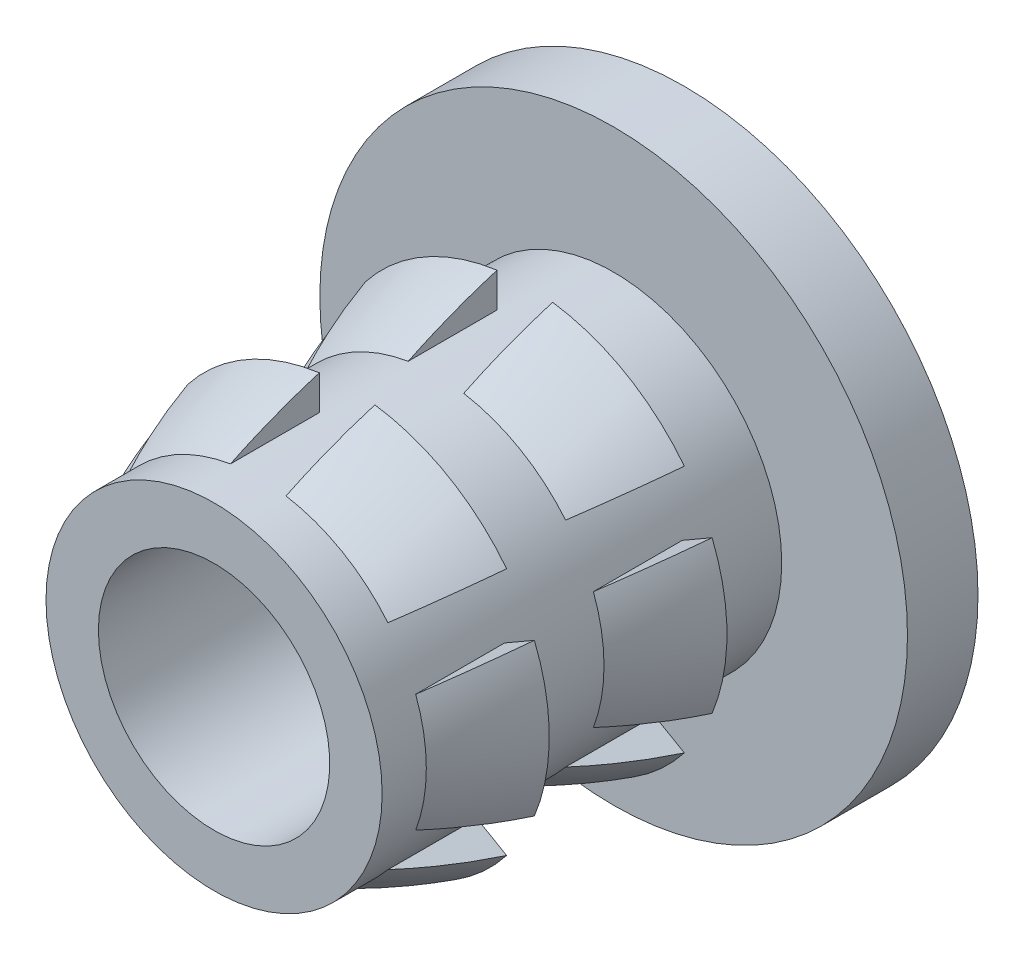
ISO-10303-21;
HEADER;
FILE_DESCRIPTION(('STEP AP214'),'2;1');
FILE_NAME('part.step','',(''),(''),'','','');
FILE_SCHEMA(('AUTOMOTIVE_DESIGN { 1 0 10303 214 1 1 1 1 }'));
ENDSEC;
DATA;
#1=APPLICATION_CONTEXT('core data for automotive mechanical design processes');
#2=APPLICATION_PROTOCOL_DEFINITION('international standard','automotive_design',2000,#1);
#3=PRODUCT_CONTEXT('',#1,'mechanical');
#4=PRODUCT('Part','Part','',(#3));
#5=PRODUCT_RELATED_PRODUCT_CATEGORY('part','',(#4));
#6=PRODUCT_DEFINITION_FORMATION('','',#4);
#7=PRODUCT_DEFINITION_CONTEXT('part definition',#1,'design');
#8=PRODUCT_DEFINITION('design','',#6,#7);
#9=PRODUCT_DEFINITION_SHAPE('','',#8);
#10=(LENGTH_UNIT() NAMED_UNIT(*) SI_UNIT(.MILLI.,.METRE.));
#11=(NAMED_UNIT(*) PLANE_ANGLE_UNIT() SI_UNIT($,.RADIAN.));
#12=(NAMED_UNIT(*) SI_UNIT($,.STERADIAN.) SOLID_ANGLE_UNIT());
#13=UNCERTAINTY_MEASURE_WITH_UNIT(LENGTH_MEASURE(1.E-05),#10,'distance_accuracy_value','');
#14=(GEOMETRIC_REPRESENTATION_CONTEXT(3) GLOBAL_UNCERTAINTY_ASSIGNED_CONTEXT((#13)) GLOBAL_UNIT_ASSIGNED_CONTEXT((#10,
#11,#12)) REPRESENTATION_CONTEXT('',''));
#15=CARTESIAN_POINT('',(0.,0.,0.));
#16=DIRECTION('',(0.,0.,1.));
#17=DIRECTION('',(1.,0.,0.));
#18=AXIS2_PLACEMENT_3D('',#15,#16,#17);
#19=CARTESIAN_POINT('',(10.75384757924,0.,-17.2405307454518));
#20=DIRECTION('',(0.,0.,1.));
#21=DIRECTION('',(1.,0.,0.));
#22=AXIS2_PLACEMENT_3D('',#19,#20,#21);
#23=PLANE('',#22);
#24=CARTESIAN_POINT('',(8.93774757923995,0.,-17.2405307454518));
#25=DIRECTION('',(0.,0.,-1.));
#26=DIRECTION('',(-1.,0.,0.));
#27=AXIS2_PLACEMENT_3D('',#24,#25,#26);
#28=CIRCLE('',#27,1.8161);
#29=CARTESIAN_POINT('',(7.53656596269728,1.15538274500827,-17.2405307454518));
#30=VERTEX_POINT('',#29);
#31=CARTESIAN_POINT('',(8.63774757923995,1.79115024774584,-17.2405307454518));
#32=VERTEX_POINT('',#31);
#33=EDGE_CURVE('E298',#30,#32,#28,.T.);
#34=ORIENTED_EDGE('',*,*,#33,.F.);
#35=DIRECTION('',(-0.866025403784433,0.50000000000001,0.));
#36=VECTOR('',#35,1.);
#37=CARTESIAN_POINT('',(10.4498225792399,-0.52658674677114,-17.2405307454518));
#38=LINE('',#37,#36);
#39=CARTESIAN_POINT('',(7.21392727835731,1.34165827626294,-17.2405307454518));
#40=VERTEX_POINT('',#39);
#41=EDGE_CURVE('E546',#30,#40,#38,.T.);
#42=ORIENTED_EDGE('',*,*,#41,.T.);
#43=CARTESIAN_POINT('',(8.93774757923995,0.,-17.2405307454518));
#44=DIRECTION('',(0.,0.,-1.));
#45=DIRECTION('',(-1.,0.,0.));
#46=AXIS2_PLACEMENT_3D('',#43,#44,#45);
#47=CIRCLE('',#46,2.1844);
#48=CARTESIAN_POINT('',(8.63774757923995,2.16370131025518,-17.2405307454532));
#49=VERTEX_POINT('',#48);
#50=EDGE_CURVE('E345',#40,#49,#47,.T.);
#51=ORIENTED_EDGE('',*,*,#50,.T.);
#52=DIRECTION('',(0.,-1.,0.));
#53=VECTOR('',#52,1.);
#54=CARTESIAN_POINT('',(8.63774757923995,0.,-17.2405307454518));
#55=LINE('',#54,#53);
#56=EDGE_CURVE('E710',#49,#32,#55,.T.);
#57=ORIENTED_EDGE('',*,*,#56,.T.);
#58=EDGE_LOOP('',(#34,#42,#51,#57));
#59=FACE_BOUND('',#58,.T.);
#60=ADVANCED_FACE('F41',(#59),#23,.F.);
#61=CARTESIAN_POINT('',(8.93774757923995,0.,-19.077055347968));
#62=DIRECTION('',(0.,0.,-1.));
#63=DIRECTION('',(-1.,0.,0.));
#64=AXIS2_PLACEMENT_3D('',#61,#62,#63);
#65=DEGENERATE_TOROIDAL_SURFACE('',#64,4.03884641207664,6.48857600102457,.F.);
#66=ORIENTED_EDGE('',*,*,#50,.F.);
#67=CARTESIAN_POINT('',(7.21387567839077,1.34168806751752,-17.2407307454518));
#68=CARTESIAN_POINT('',(7.25638494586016,1.317145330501,-17.0759447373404));
#69=CARTESIAN_POINT('',(7.30462719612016,1.28929265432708,-16.9131818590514));
#70=CARTESIAN_POINT('',(7.38536416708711,1.24267914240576,-16.6728736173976));
#71=CARTESIAN_POINT('',(7.41366221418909,1.22634125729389,-16.5934337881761));
#72=CARTESIAN_POINT('',(7.47306506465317,1.19204500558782,-16.4358119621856));
#73=CARTESIAN_POINT('',(7.50417436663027,1.17408404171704,-16.3576322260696));
#74=CARTESIAN_POINT('',(7.53664985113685,1.1553343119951,-16.2802107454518));
#75=B_SPLINE_CURVE_WITH_KNOTS('',3,(#67,#68,#69,#70,#71,#72,#73,#74),.UNSPECIFIED.,.F.,.F.,(4,2,
2,4),(0.,0.515567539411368,0.773194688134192,1.03124165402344),.UNSPECIFIED.);
#76=CARTESIAN_POINT('',(7.53656596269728,1.15538274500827,-16.2804107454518));
#77=VERTEX_POINT('',#76);
#78=EDGE_CURVE('E541',#40,#77,#75,.T.);
#79=ORIENTED_EDGE('',*,*,#78,.T.);
#80=CARTESIAN_POINT('',(8.93774757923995,0.,-16.2804107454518));
#81=DIRECTION('',(0.,0.,-1.));
#82=DIRECTION('',(-1.,0.,0.));
#83=AXIS2_PLACEMENT_3D('',#80,#81,#82);
#84=CIRCLE('',#83,1.8161);
#85=CARTESIAN_POINT('',(8.63774757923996,1.79115024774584,-16.2804107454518));
#86=VERTEX_POINT('',#85);
#87=EDGE_CURVE('E341',#77,#86,#84,.T.);
#88=ORIENTED_EDGE('',*,*,#87,.T.);
#89=CARTESIAN_POINT('',(8.63774757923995,1.99680857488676,-16.7529502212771));
#90=CARTESIAN_POINT('',(8.63774757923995,2.06197951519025,-16.9209435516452));
#91=CARTESIAN_POINT('',(8.63774757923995,2.12005202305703,-17.0917232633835));
#92=CARTESIAN_POINT('',(8.63774757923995,2.22163662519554,-17.4376354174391));
#93=CARTESIAN_POINT('',(8.63774757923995,2.26514130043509,-17.612770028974));
#94=CARTESIAN_POINT('',(8.63774757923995,2.33733891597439,-17.9663608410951));
#95=CARTESIAN_POINT('',(8.63774757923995,2.36600815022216,-18.1448218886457));
#96=CARTESIAN_POINT('',(8.63774757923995,2.40824914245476,-18.5035846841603));
#97=CARTESIAN_POINT('',(8.63774757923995,2.42181553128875,-18.6838870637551));
#98=CARTESIAN_POINT('',(8.63774757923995,2.43374322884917,-19.0449571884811));
#99=CARTESIAN_POINT('',(8.63774757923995,2.43210765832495,-19.2257248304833));
#100=CARTESIAN_POINT('',(8.63774757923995,2.41364946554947,-19.5864830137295));
#101=CARTESIAN_POINT('',(8.63774757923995,2.39682685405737,-19.7664735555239));
#102=CARTESIAN_POINT('',(8.63774757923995,2.34810674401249,-20.1243865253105));
#103=CARTESIAN_POINT('',(8.63774757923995,2.31621060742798,-20.3023091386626));
#104=CARTESIAN_POINT('',(8.63774757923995,2.23756417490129,-20.6547756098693));
#105=CARTESIAN_POINT('',(8.63774757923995,2.19081911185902,-20.8293206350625));
#106=CARTESIAN_POINT('',(8.63774757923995,2.08263577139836,-21.1742670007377));
#107=CARTESIAN_POINT('',(8.63774757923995,2.02116179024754,-21.3446571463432));
#108=CARTESIAN_POINT('',(8.63774757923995,1.88394363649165,-21.6796389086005));
#109=CARTESIAN_POINT('',(8.63774757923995,1.80819648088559,-21.8442293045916));
#110=CARTESIAN_POINT('',(8.63774757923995,1.64290636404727,-22.1662452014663));
#111=CARTESIAN_POINT('',(8.63774757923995,1.55336862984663,-22.3236733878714));
#112=CARTESIAN_POINT('',(8.63774757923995,1.36093767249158,-22.6300666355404));
#113=CARTESIAN_POINT('',(8.63774757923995,1.25805311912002,-22.7790371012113));
#114=CARTESIAN_POINT('',(8.63774757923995,1.10606090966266,-22.9788574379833));
#115=CARTESIAN_POINT('',(8.63774757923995,1.06253347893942,-23.0340114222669));
#116=CARTESIAN_POINT('',(8.63774757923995,0.973448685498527,-23.1426610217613));
#117=CARTESIAN_POINT('',(8.63774757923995,0.927891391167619,-23.1961566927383));
#118=CARTESIAN_POINT('',(8.63774757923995,0.834821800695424,-23.3011172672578));
#119=CARTESIAN_POINT('',(8.63774757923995,0.787316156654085,-23.3525880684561));
#120=CARTESIAN_POINT('',(8.63774757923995,0.690051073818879,-23.4533458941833));
#121=CARTESIAN_POINT('',(8.63774757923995,0.640292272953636,-23.5026335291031));
#122=CARTESIAN_POINT('',(8.63774757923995,0.55496425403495,-23.5825144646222));
#123=CARTESIAN_POINT('',(8.63774757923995,0.520139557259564,-23.6139032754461));
#124=CARTESIAN_POINT('',(8.63774757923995,0.448857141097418,-23.6750764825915));
#125=CARTESIAN_POINT('',(8.63774757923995,0.412393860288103,-23.7048545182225));
#126=CARTESIAN_POINT('',(8.63774757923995,0.355964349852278,-23.7476043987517));
#127=CARTESIAN_POINT('',(8.63774757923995,0.336772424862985,-23.76159511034));
#128=CARTESIAN_POINT('',(8.63774757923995,0.297731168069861,-23.7886209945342));
#129=CARTESIAN_POINT('',(8.63774757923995,0.277882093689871,-23.8016565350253));
#130=CARTESIAN_POINT('',(8.63774757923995,0.237417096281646,-23.8263350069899));
#131=CARTESIAN_POINT('',(8.63774757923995,0.216804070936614,-23.8379826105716));
#132=CARTESIAN_POINT('',(8.63774757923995,0.174572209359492,-23.859244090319));
#133=CARTESIAN_POINT('',(8.63774757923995,0.152955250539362,-23.8688615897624));
#134=CARTESIAN_POINT('',(8.63774757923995,0.108443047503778,-23.8850320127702));
#135=CARTESIAN_POINT('',(8.63774757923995,0.0855430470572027,-23.8915725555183));
#136=CARTESIAN_POINT('',(8.63774757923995,0.0389990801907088,-23.9000687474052));
#137=CARTESIAN_POINT('',(8.63774757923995,0.0153612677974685,-23.9020554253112));
#138=CARTESIAN_POINT('',(8.63774757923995,-0.0318476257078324,-23.9008993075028));
#139=CARTESIAN_POINT('',(8.63774757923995,-0.0554182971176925,-23.897741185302));
#140=CARTESIAN_POINT('',(8.63774757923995,-0.101687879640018,-23.8871874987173));
#141=CARTESIAN_POINT('',(8.63774757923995,-0.124379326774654,-23.8797617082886));
#142=CARTESIAN_POINT('',(8.63774757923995,-0.171866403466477,-23.8607635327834));
#143=CARTESIAN_POINT('',(8.63774757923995,-0.196472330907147,-23.8487383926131));
#144=CARTESIAN_POINT('',(8.63774757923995,-0.244449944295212,-23.8224002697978));
#145=CARTESIAN_POINT('',(8.63774757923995,-0.267818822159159,-23.8080823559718));
#146=CARTESIAN_POINT('',(8.63774757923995,-0.313714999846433,-23.7778984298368));
#147=CARTESIAN_POINT('',(8.63774757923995,-0.336236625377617,-23.7620239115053));
#148=CARTESIAN_POINT('',(8.63774757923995,-0.380489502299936,-23.7292672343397));
#149=CARTESIAN_POINT('',(8.63774757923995,-0.402221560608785,-23.7123861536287));
#150=CARTESIAN_POINT('',(8.63774757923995,-0.466923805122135,-23.6602826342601));
#151=CARTESIAN_POINT('',(8.63774757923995,-0.508961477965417,-23.6239048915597));
#152=CARTESIAN_POINT('',(8.63774757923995,-0.591236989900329,-23.5491559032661));
#153=CARTESIAN_POINT('',(8.63774757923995,-0.631473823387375,-23.5107835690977));
#154=CARTESIAN_POINT('',(8.63774757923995,-0.710493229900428,-23.4324223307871));
#155=CARTESIAN_POINT('',(8.63774757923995,-0.749272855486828,-23.3924304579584));
#156=CARTESIAN_POINT('',(8.63774757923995,-0.82543143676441,-23.3111590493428));
#157=CARTESIAN_POINT('',(8.63774757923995,-0.86281072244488,-23.2698798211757));
#158=CARTESIAN_POINT('',(8.63774757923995,-0.972903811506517,-23.1444123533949));
#159=CARTESIAN_POINT('',(8.63774757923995,-1.04366624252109,-23.0585004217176));
#160=CARTESIAN_POINT('',(8.63774757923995,-1.18010146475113,-22.8828870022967));
#161=CARTESIAN_POINT('',(8.63774757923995,-1.24577901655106,-22.7931891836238));
#162=CARTESIAN_POINT('',(8.63774757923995,-1.40920189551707,-22.556684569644));
#163=CARTESIAN_POINT('',(8.63774757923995,-1.50316204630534,-22.4072389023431));
#164=CARTESIAN_POINT('',(8.63774757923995,-1.67822469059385,-22.1008887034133));
#165=CARTESIAN_POINT('',(8.63774757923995,-1.75931791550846,-21.943978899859));
#166=CARTESIAN_POINT('',(8.63774757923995,-1.90814160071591,-21.6240209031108));
#167=CARTESIAN_POINT('',(8.63774757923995,-1.97587754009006,-21.4609752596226));
#168=CARTESIAN_POINT('',(8.63774757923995,-2.09763057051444,-21.1298850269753));
#169=CARTESIAN_POINT('',(8.63774757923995,-2.15165071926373,-20.9618415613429));
#170=CARTESIAN_POINT('',(8.63774757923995,-2.24598607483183,-20.6207408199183));
#171=CARTESIAN_POINT('',(8.63774757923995,-2.28620727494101,-20.4476575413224));
#172=CARTESIAN_POINT('',(8.63774757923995,-2.35220401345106,-20.0986987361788));
#173=CARTESIAN_POINT('',(8.63774757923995,-2.3779746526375,-19.9228222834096));
#174=CARTESIAN_POINT('',(8.63774757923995,-2.41488609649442,-19.569553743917));
#175=CARTESIAN_POINT('',(8.63774757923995,-2.42602796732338,-19.392161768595));
#176=CARTESIAN_POINT('',(8.63774757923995,-2.43361501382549,-19.0370634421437));
#177=CARTESIAN_POINT('',(8.63774757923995,-2.43006008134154,-18.8593570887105));
#178=CARTESIAN_POINT('',(8.63774757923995,-2.40807548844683,-18.5015933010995));
#179=CARTESIAN_POINT('',(8.63774757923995,-2.38937434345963,-18.3215524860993));
#180=CARTESIAN_POINT('',(8.63774757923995,-2.33688520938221,-17.9637463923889));
#181=CARTESIAN_POINT('',(8.63774757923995,-2.30310231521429,-17.7859803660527));
#182=CARTESIAN_POINT('',(8.63774757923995,-2.22062195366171,-17.4337245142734));
#183=CARTESIAN_POINT('',(8.63774757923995,-2.17190730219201,-17.2592387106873));
#184=CARTESIAN_POINT('',(8.63774757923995,-2.05989551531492,-16.9150428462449));
#185=CARTESIAN_POINT('',(8.63774757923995,-1.99660074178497,-16.7453320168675));
#186=CARTESIAN_POINT('',(8.63774757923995,-1.8558353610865,-16.4119615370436));
#187=CARTESIAN_POINT('',(8.63774757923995,-1.77836992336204,-16.2482997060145));
#188=CARTESIAN_POINT('',(8.63774757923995,-1.60963775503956,-15.9281442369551));
#189=CARTESIAN_POINT('',(8.63774757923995,-1.51836360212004,-15.771654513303));
#190=CARTESIAN_POINT('',(8.63774757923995,-1.32259459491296,-15.4674643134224));
#191=CARTESIAN_POINT('',(8.63774757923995,-1.21812093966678,-15.3197502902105));
#192=CARTESIAN_POINT('',(8.63774757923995,-1.05158332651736,-15.1060195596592));
#193=CARTESIAN_POINT('',(8.63774757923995,-0.99445929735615,-15.0361107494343));
#194=CARTESIAN_POINT('',(8.63774757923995,-0.876821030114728,-14.8992154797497));
#195=CARTESIAN_POINT('',(8.63774757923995,-0.816307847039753,-14.8322281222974));
#196=CARTESIAN_POINT('',(8.63774757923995,-0.722787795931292,-14.7344505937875));
#197=CARTESIAN_POINT('',(8.63774757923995,-0.691171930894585,-14.7023234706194));
#198=CARTESIAN_POINT('',(8.63774757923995,-0.626909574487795,-14.6390989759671));
#199=CARTESIAN_POINT('',(8.63774757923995,-0.594262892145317,-14.608001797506));
#200=CARTESIAN_POINT('',(8.63774757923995,-0.527867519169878,-14.5471671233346));
#201=CARTESIAN_POINT('',(8.63774757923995,-0.494121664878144,-14.5174265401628));
#202=CARTESIAN_POINT('',(8.63774757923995,-0.42517854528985,-14.459689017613));
#203=CARTESIAN_POINT('',(8.63774757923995,-0.3899821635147,-14.4316910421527));
#204=CARTESIAN_POINT('',(8.63774757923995,-0.328001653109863,-14.386139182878));
#205=CARTESIAN_POINT('',(8.63774757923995,-0.301722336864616,-14.3679036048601));
#206=CARTESIAN_POINT('',(8.63774757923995,-0.247705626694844,-14.3335781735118));
#207=CARTESIAN_POINT('',(8.63774757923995,-0.219966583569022,-14.3174908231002));
#208=CARTESIAN_POINT('',(8.63774757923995,-0.169226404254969,-14.2923847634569));
#209=CARTESIAN_POINT('',(8.63774757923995,-0.146619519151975,-14.2825920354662));
#210=CARTESIAN_POINT('',(8.63774757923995,-0.10020073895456,-14.2665676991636));
#211=CARTESIAN_POINT('',(8.63774757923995,-0.0763944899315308,-14.26032084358));
#212=CARTESIAN_POINT('',(8.63774757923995,-0.0324845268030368,-14.253548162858));
#213=CARTESIAN_POINT('',(8.63774757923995,-0.0125186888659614,-14.2521724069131));
#214=CARTESIAN_POINT('',(8.63774757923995,0.0273225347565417,-14.2530548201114));
#215=CARTESIAN_POINT('',(8.63774757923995,0.0471979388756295,-14.2553122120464));
#216=CARTESIAN_POINT('',(8.63774757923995,0.0932471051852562,-14.2643258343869));
#217=CARTESIAN_POINT('',(8.63774757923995,0.119150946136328,-14.2723950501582));
#218=CARTESIAN_POINT('',(8.63774757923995,0.169541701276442,-14.2922890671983));
#219=CARTESIAN_POINT('',(8.63774757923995,0.194018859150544,-14.3041367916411));
#220=CARTESIAN_POINT('',(8.63774757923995,0.237692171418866,-14.3279190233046));
#221=CARTESIAN_POINT('',(8.63774757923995,0.257084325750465,-14.3395040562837));
#222=CARTESIAN_POINT('',(8.63774757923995,0.295171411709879,-14.3637769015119));
#223=CARTESIAN_POINT('',(8.63774757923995,0.313865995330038,-14.3764652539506));
#224=CARTESIAN_POINT('',(8.63774757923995,0.369188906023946,-14.4157555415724));
#225=CARTESIAN_POINT('',(8.63774757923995,0.404975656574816,-14.4435351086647));
#226=CARTESIAN_POINT('',(8.63774757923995,0.475139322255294,-14.5011020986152));
#227=CARTESIAN_POINT('',(8.63774757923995,0.509508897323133,-14.530898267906));
#228=CARTESIAN_POINT('',(8.63774757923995,0.576957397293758,-14.5918240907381));
#229=CARTESIAN_POINT('',(8.63774757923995,0.610037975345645,-14.622951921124));
#230=CARTESIAN_POINT('',(8.63774757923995,0.696702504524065,-14.7072554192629));
#231=CARTESIAN_POINT('',(8.63774757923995,0.749360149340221,-14.7613833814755));
#232=CARTESIAN_POINT('',(8.63774757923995,0.852163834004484,-14.8719829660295));
#233=CARTESIAN_POINT('',(8.63774757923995,0.902309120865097,-14.9284552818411));
#234=CARTESIAN_POINT('',(8.63774757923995,1.04933684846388,-15.1010536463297));
#235=CARTESIAN_POINT('',(8.63774757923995,1.14267410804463,-15.2202246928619));
#236=CARTESIAN_POINT('',(8.63774757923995,1.31977520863,-15.4647508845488));
#237=CARTESIAN_POINT('',(8.63774757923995,1.40357349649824,-15.5900812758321));
#238=CARTESIAN_POINT('',(8.63774757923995,1.56178267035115,-15.8463860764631));
#239=CARTESIAN_POINT('',(8.63774757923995,1.63620193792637,-15.9773553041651));
#240=CARTESIAN_POINT('',(8.63774757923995,1.7602315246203,-16.2150105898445));
#241=CARTESIAN_POINT('',(8.63774757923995,1.81170502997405,-16.3207300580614));
#242=CARTESIAN_POINT('',(8.63774757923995,1.90873065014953,-16.5348870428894));
#243=CARTESIAN_POINT('',(8.63774757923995,1.95428096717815,-16.6433253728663));
#244=CARTESIAN_POINT('',(8.63774757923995,1.99680857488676,-16.7529502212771));
#245=B_SPLINE_CURVE_WITH_KNOTS('',3,(#89,#90,#91,#92,#93,#94,#95,#96,#97,#98,#99,#100,#101,#102,
#103,#104,#105,#106,#107,#108,#109,#110,#111,#112,#113,#114,#115,#116,#117,#118,#119,#120,#121,
#122,#123,#124,#125,#126,#127,#128,#129,#130,#131,#132,#133,#134,#135,#136,#137,#138,#139,#140,
#141,#142,#143,#144,#145,#146,#147,#148,#149,#150,#151,#152,#153,#154,#155,#156,#157,#158,#159,
#160,#161,#162,#163,#164,#165,#166,#167,#168,#169,#170,#171,#172,#173,#174,#175,#176,#177,#178,
#179,#180,#181,#182,#183,#184,#185,#186,#187,#188,#189,#190,#191,#192,#193,#194,#195,#196,#197,
#198,#199,#200,#201,#202,#203,#204,#205,#206,#207,#208,#209,#210,#211,#212,#213,#214,#215,#216,
#217,#218,#219,#220,#221,#222,#223,#224,#225,#226,#227,#228,#229,#230,#231,#232,#233,#234,#235,
#236,#237,#238,#239,#240,#241,#242,#243,#244),.UNSPECIFIED.,.T.,.F.,(4,2,2,2,2,2,2,2,2,2,2,2,2,
2,2,2,2,2,2,2,2,2,2,2,2,2,2,2,2,2,2,2,2,2,2,2,2,2,2,2,2,2,2,2,2,2,2,2,2,2,2,2,2,2,2,2,2,2,2,2,2,
2,2,2,2,2,2,2,2,2,2,2,2,2,2,2,2,4),(0.,0.540467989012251,1.08121080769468,1.622815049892,
2.16461177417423,2.70629727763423,3.24798239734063,3.78961858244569,4.33106410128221,
4.87383563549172,5.41672073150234,5.95940056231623,6.50172962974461,6.71247757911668,
6.92321843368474,7.13329152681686,7.34330551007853,7.48392096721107,7.62505629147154,
7.69628695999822,7.76749004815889,7.83844624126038,7.90927470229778,7.98038576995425,
8.05101084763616,8.12184670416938,8.19319055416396,8.27515624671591,8.35730065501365,
8.43992201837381,8.52245642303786,8.68912360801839,8.85588272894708,9.02296274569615,
9.19000313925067,9.52368731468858,9.85705521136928,10.3859509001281,10.9152258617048,
11.4442832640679,11.9732226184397,12.5056970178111,13.0383518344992,13.5709678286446,
14.1035877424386,14.6459714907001,15.1881721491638,15.7309991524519,16.2737382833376,
16.8162798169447,17.3591140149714,17.9010872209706,18.1718437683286,18.4425164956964,
18.5777228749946,18.7129544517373,18.8478610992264,18.9826867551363,19.078589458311,
19.174602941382,19.2483363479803,19.3217502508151,19.3814673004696,19.4411715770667,
19.5220788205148,19.6034865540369,19.6712076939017,19.7389621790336,19.874751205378,
20.0111724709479,20.1474125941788,20.3738563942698,20.6003676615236,21.0539684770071,
21.5058754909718,21.9573757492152,22.3099539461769,22.6626389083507),.UNSPECIFIED.);
#246=EDGE_CURVE('E709',#86,#49,#245,.T.);
#247=ORIENTED_EDGE('',*,*,#246,.T.);
#248=EDGE_LOOP('',(#66,#79,#88,#247));
#249=FACE_BOUND('',#248,.T.);
#250=ADVANCED_FACE('F587',(#249),#65,.F.);
#251=CARTESIAN_POINT('',(10.75384757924,0.,-15.3202907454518));
#252=DIRECTION('',(0.,0.,1.));
#253=DIRECTION('',(1.,0.,0.));
#254=AXIS2_PLACEMENT_3D('',#251,#252,#253);
#255=PLANE('',#254);
#256=CARTESIAN_POINT('',(8.93774757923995,0.,-15.3202907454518));
#257=DIRECTION('',(0.,0.,-1.));
#258=DIRECTION('',(-1.,0.,0.));
#259=AXIS2_PLACEMENT_3D('',#256,#257,#258);
#260=CIRCLE('',#259,1.8161);
#261=CARTESIAN_POINT('',(7.53656596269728,1.15538274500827,-15.3202907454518));
#262=VERTEX_POINT('',#261);
#263=CARTESIAN_POINT('',(8.63774757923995,1.79115024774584,-15.3202907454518));
#264=VERTEX_POINT('',#263);
#265=EDGE_CURVE('E337',#262,#264,#260,.T.);
#266=ORIENTED_EDGE('',*,*,#265,.F.);
#267=DIRECTION('',(-0.866025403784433,0.50000000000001,0.));
#268=VECTOR('',#267,1.);
#269=CARTESIAN_POINT('',(10.4498225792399,-0.52658674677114,-15.3202907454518));
#270=LINE('',#269,#268);
#271=CARTESIAN_POINT('',(7.21392727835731,1.34165827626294,-15.3202907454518));
#272=VERTEX_POINT('',#271);
#273=EDGE_CURVE('E538',#262,#272,#270,.T.);
#274=ORIENTED_EDGE('',*,*,#273,.T.);
#275=CARTESIAN_POINT('',(8.93774757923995,0.,-15.3202907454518));
#276=DIRECTION('',(0.,0.,-1.));
#277=DIRECTION('',(-1.,0.,0.));
#278=AXIS2_PLACEMENT_3D('',#275,#276,#277);
#279=CIRCLE('',#278,2.1844);
#280=CARTESIAN_POINT('',(8.63774757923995,2.16370131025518,-15.3202907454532));
#281=VERTEX_POINT('',#280);
#282=EDGE_CURVE('E331',#272,#281,#279,.T.);
#283=ORIENTED_EDGE('',*,*,#282,.T.);
#284=DIRECTION('',(0.,-1.,0.));
#285=VECTOR('',#284,1.);
#286=CARTESIAN_POINT('',(8.63774757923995,0.,-15.3202907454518));
#287=LINE('',#286,#285);
#288=EDGE_CURVE('E712',#281,#264,#287,.T.);
#289=ORIENTED_EDGE('',*,*,#288,.T.);
#290=EDGE_LOOP('',(#266,#274,#283,#289));
#291=FACE_BOUND('',#290,.T.);
#292=ADVANCED_FACE('F593',(#291),#255,.F.);
#293=CARTESIAN_POINT('',(8.93774757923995,0.,-17.1506228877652));
#294=DIRECTION('',(0.,0.,-1.));
#295=DIRECTION('',(-1.,0.,0.));
#296=AXIS2_PLACEMENT_3D('',#293,#294,#295);
#297=DEGENERATE_TOROIDAL_SURFACE('',#296,4.02270330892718,6.47134045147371,.F.);
#298=ORIENTED_EDGE('',*,*,#282,.F.);
#299=CARTESIAN_POINT('',(7.21387571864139,1.34168804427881,-15.3204907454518));
#300=CARTESIAN_POINT('',(7.25635476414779,1.31716275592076,-15.155693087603));
#301=CARTESIAN_POINT('',(7.3045824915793,1.28931846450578,-14.9929227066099));
#302=CARTESIAN_POINT('',(7.38531977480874,1.24270477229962,-14.7526135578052));
#303=CARTESIAN_POINT('',(7.41362155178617,1.22636473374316,-14.6731752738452));
#304=CARTESIAN_POINT('',(7.47303927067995,1.1920598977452,-14.5155598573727));
#305=CARTESIAN_POINT('',(7.50415974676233,1.17409248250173,-14.4373850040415));
#306=CARTESIAN_POINT('',(7.53664989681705,1.15533428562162,-14.3599707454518));
#307=B_SPLINE_CURVE_WITH_KNOTS('',3,(#299,#300,#301,#302,#303,#304,#305,#306),.UNSPECIFIED.,.F.,
.F.,(4,2,2,4),(0.,0.51556976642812,0.773197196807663,1.03124666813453),.UNSPECIFIED.);
#308=CARTESIAN_POINT('',(7.53656596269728,1.15538274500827,-14.3601707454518));
#309=VERTEX_POINT('',#308);
#310=EDGE_CURVE('E292',#272,#309,#307,.T.);
#311=ORIENTED_EDGE('',*,*,#310,.T.);
#312=CARTESIAN_POINT('',(8.93774757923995,0.,-14.3601707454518));
#313=DIRECTION('',(0.,0.,-1.));
#314=DIRECTION('',(-1.,0.,0.));
#315=AXIS2_PLACEMENT_3D('',#312,#313,#314);
#316=CIRCLE('',#315,1.8161);
#317=CARTESIAN_POINT('',(8.63774757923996,1.79115024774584,-14.3601707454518));
#318=VERTEX_POINT('',#317);
#319=EDGE_CURVE('E333',#309,#318,#316,.T.);
#320=ORIENTED_EDGE('',*,*,#319,.T.);
#321=CARTESIAN_POINT('',(8.63774757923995,1.99685989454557,-14.8326903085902));
#322=CARTESIAN_POINT('',(8.63774757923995,2.06185846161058,-15.0002393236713));
#323=CARTESIAN_POINT('',(8.63774757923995,2.11977748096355,-15.1705674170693));
#324=CARTESIAN_POINT('',(8.63774757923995,2.22109351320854,-15.5155648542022));
#325=CARTESIAN_POINT('',(8.63774757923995,2.26448312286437,-15.6902363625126));
#326=CARTESIAN_POINT('',(8.63774757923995,2.33648956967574,-16.0428922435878));
#327=CARTESIAN_POINT('',(8.63774757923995,2.365082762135,-16.2208814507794));
#328=CARTESIAN_POINT('',(8.63774757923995,2.4072113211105,-16.5786957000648));
#329=CARTESIAN_POINT('',(8.63774757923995,2.42074133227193,-16.7585213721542));
#330=CARTESIAN_POINT('',(8.63774757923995,2.43263613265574,-17.1186350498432));
#331=CARTESIAN_POINT('',(8.63774757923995,2.43100418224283,-17.298922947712));
#332=CARTESIAN_POINT('',(8.63774757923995,2.41259340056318,-17.6587236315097));
#333=CARTESIAN_POINT('',(8.63774757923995,2.3958145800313,-17.8382364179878));
#334=CARTESIAN_POINT('',(8.63774757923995,2.34722198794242,-18.1951990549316));
#335=CARTESIAN_POINT('',(8.63774757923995,2.31540959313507,-18.3726490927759));
#336=CARTESIAN_POINT('',(8.63774757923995,2.2369700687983,-18.7241792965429));
#337=CARTESIAN_POINT('',(8.63774757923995,2.19034815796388,-18.8982606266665));
#338=CARTESIAN_POINT('',(8.63774757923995,2.08245068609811,-19.2422891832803));
#339=CARTESIAN_POINT('',(8.63774757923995,2.02113963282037,-19.4122252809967));
#340=CARTESIAN_POINT('',(8.63774757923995,1.88428593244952,-19.7463142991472));
#341=CARTESIAN_POINT('',(8.63774757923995,1.80874032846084,-19.9104660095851));
#342=CARTESIAN_POINT('',(8.63774757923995,1.64389122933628,-20.2316243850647));
#343=CARTESIAN_POINT('',(8.63774757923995,1.55459294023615,-20.3886337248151));
#344=CARTESIAN_POINT('',(8.63774757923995,1.36267897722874,-20.6942139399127));
#345=CARTESIAN_POINT('',(8.63774757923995,1.2600719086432,-20.8427901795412));
#346=CARTESIAN_POINT('',(8.63774757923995,1.1083261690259,-21.0423103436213));
#347=CARTESIAN_POINT('',(8.63774757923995,1.06474113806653,-21.097537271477));
#348=CARTESIAN_POINT('',(8.63774757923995,0.975532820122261,-21.206325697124));
#349=CARTESIAN_POINT('',(8.63774757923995,0.929909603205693,-21.25988725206));
#350=CARTESIAN_POINT('',(8.63774757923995,0.836700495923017,-21.3649729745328));
#351=CARTESIAN_POINT('',(8.63774757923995,0.789121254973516,-21.4165030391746));
#352=CARTESIAN_POINT('',(8.63774757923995,0.69170322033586,-21.517372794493));
#353=CARTESIAN_POINT('',(8.63774757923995,0.641865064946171,-21.5667130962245));
#354=CARTESIAN_POINT('',(8.63774757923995,0.55638081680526,-21.6466983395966));
#355=CARTESIAN_POINT('',(8.63774757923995,0.521479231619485,-21.6781392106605));
#356=CARTESIAN_POINT('',(8.63774757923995,0.450042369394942,-21.7394129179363));
#357=CARTESIAN_POINT('',(8.63774757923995,0.413501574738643,-21.7692394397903));
#358=CARTESIAN_POINT('',(8.63774757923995,0.356957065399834,-21.8120607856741));
#359=CARTESIAN_POINT('',(8.63774757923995,0.337727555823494,-21.8260747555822));
#360=CARTESIAN_POINT('',(8.63774757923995,0.298611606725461,-21.8531477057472));
#361=CARTESIAN_POINT('',(8.63774757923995,0.278725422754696,-21.8662070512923));
#362=CARTESIAN_POINT('',(8.63774757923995,0.238185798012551,-21.890935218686));
#363=CARTESIAN_POINT('',(8.63774757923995,0.217535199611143,-21.9026086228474));
#364=CARTESIAN_POINT('',(8.63774757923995,0.175228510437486,-21.9239239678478));
#365=CARTESIAN_POINT('',(8.63774757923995,0.15357428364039,-21.9335695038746));
#366=CARTESIAN_POINT('',(8.63774757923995,0.108955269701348,-21.949809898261));
#367=CARTESIAN_POINT('',(8.63774757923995,0.0859840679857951,-21.9563880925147));
#368=CARTESIAN_POINT('',(8.63774757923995,0.0392927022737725,-21.9649429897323));
#369=CARTESIAN_POINT('',(8.63774757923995,0.0155787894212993,-21.9669510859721));
#370=CARTESIAN_POINT('',(8.63774757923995,-0.031786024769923,-21.9658132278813));
#371=CARTESIAN_POINT('',(8.63774757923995,-0.0554365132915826,-21.9626515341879));
#372=CARTESIAN_POINT('',(8.63774757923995,-0.101863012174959,-21.9520704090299));
#373=CARTESIAN_POINT('',(8.63774757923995,-0.124631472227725,-21.9446203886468));
#374=CARTESIAN_POINT('',(8.63774757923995,-0.172286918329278,-21.9255556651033));
#375=CARTESIAN_POINT('',(8.63774757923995,-0.19698299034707,-21.9134853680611));
#376=CARTESIAN_POINT('',(8.63774757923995,-0.245136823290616,-21.8870494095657));
#377=CARTESIAN_POINT('',(8.63774757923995,-0.268591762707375,-21.8726787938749));
#378=CARTESIAN_POINT('',(8.63774757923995,-0.314657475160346,-21.8423852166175));
#379=CARTESIAN_POINT('',(8.63774757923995,-0.337262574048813,-21.8264537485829));
#380=CARTESIAN_POINT('',(8.63774757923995,-0.381680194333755,-21.7935803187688));
#381=CARTESIAN_POINT('',(8.63774757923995,-0.403493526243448,-21.776639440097));
#382=CARTESIAN_POINT('',(8.63774757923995,-0.468365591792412,-21.7244100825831));
#383=CARTESIAN_POINT('',(8.63774757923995,-0.510493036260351,-21.6879675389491));
#384=CARTESIAN_POINT('',(8.63774757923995,-0.592945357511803,-21.6130852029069));
#385=CARTESIAN_POINT('',(8.63774757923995,-0.633269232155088,-21.5746443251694));
#386=CARTESIAN_POINT('',(8.63774757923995,-0.712458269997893,-21.4961410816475));
#387=CARTESIAN_POINT('',(8.63774757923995,-0.751320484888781,-21.4560757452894));
#388=CARTESIAN_POINT('',(8.63774757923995,-0.827638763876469,-21.3746519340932));
#389=CARTESIAN_POINT('',(8.63774757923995,-0.865095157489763,-21.333293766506));
#390=CARTESIAN_POINT('',(8.63774757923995,-0.975408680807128,-21.2075828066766));
#391=CARTESIAN_POINT('',(8.63774757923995,-1.04630522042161,-21.1214980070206));
#392=CARTESIAN_POINT('',(8.63774757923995,-1.18298003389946,-20.9455177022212));
#393=CARTESIAN_POINT('',(8.63774757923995,-1.24876307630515,-20.8556258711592));
#394=CARTESIAN_POINT('',(8.63774757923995,-1.41198500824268,-20.619222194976));
#395=CARTESIAN_POINT('',(8.63774757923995,-1.50566925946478,-20.4700950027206));
#396=CARTESIAN_POINT('',(8.63774757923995,-1.6802061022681,-20.1644038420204));
#397=CARTESIAN_POINT('',(8.63774757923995,-1.76104950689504,-20.0078346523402));
#398=CARTESIAN_POINT('',(8.63774757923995,-1.90940107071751,-19.6885740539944));
#399=CARTESIAN_POINT('',(8.63774757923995,-1.97691451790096,-19.5258851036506));
#400=CARTESIAN_POINT('',(8.63774757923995,-2.09824922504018,-19.1955238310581));
#401=CARTESIAN_POINT('',(8.63774757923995,-2.15207351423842,-19.0278526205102));
#402=CARTESIAN_POINT('',(8.63774757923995,-2.24603644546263,-18.6875369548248));
#403=CARTESIAN_POINT('',(8.63774757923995,-2.28608326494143,-18.5148671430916));
#404=CARTESIAN_POINT('',(8.63774757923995,-2.35176361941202,-18.1667480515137));
#405=CARTESIAN_POINT('',(8.63774757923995,-2.37739226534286,-17.9912978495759));
#406=CARTESIAN_POINT('',(8.63774757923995,-2.41405286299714,-17.6388928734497));
#407=CARTESIAN_POINT('',(8.63774757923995,-2.42508595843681,-17.4619382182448));
#408=CARTESIAN_POINT('',(8.63774757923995,-2.43248948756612,-17.1077220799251));
#409=CARTESIAN_POINT('',(8.63774757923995,-2.42885981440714,-16.9304605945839));
#410=CARTESIAN_POINT('',(8.63774757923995,-2.40676099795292,-16.5736284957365));
#411=CARTESIAN_POINT('',(8.63774757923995,-2.38802343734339,-16.394074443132));
#412=CARTESIAN_POINT('',(8.63774757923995,-2.33550241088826,-16.0372430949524));
#413=CARTESIAN_POINT('',(8.63774757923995,-2.30172402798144,-15.8599650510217));
#414=CARTESIAN_POINT('',(8.63774757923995,-2.21929382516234,-15.5086844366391));
#415=CARTESIAN_POINT('',(8.63774757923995,-2.17062493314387,-15.3346858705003));
#416=CARTESIAN_POINT('',(8.63774757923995,-2.05874554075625,-14.9914586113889));
#417=CARTESIAN_POINT('',(8.63774757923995,-1.99553737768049,-14.8222291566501));
#418=CARTESIAN_POINT('',(8.63774757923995,-1.85498687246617,-14.4898149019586));
#419=CARTESIAN_POINT('',(8.63774757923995,-1.7776499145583,-14.3266278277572));
#420=CARTESIAN_POINT('',(8.63774757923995,-1.60921578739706,-14.0074096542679));
#421=CARTESIAN_POINT('',(8.63774757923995,-1.51811126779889,-13.8513824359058));
#422=CARTESIAN_POINT('',(8.63774757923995,-1.32272177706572,-13.5480985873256));
#423=CARTESIAN_POINT('',(8.63774757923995,-1.2184578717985,-13.4008284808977));
#424=CARTESIAN_POINT('',(8.63774757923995,-1.05226807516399,-13.1877439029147));
#425=CARTESIAN_POINT('',(8.63774757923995,-0.995265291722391,-13.1180469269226));
#426=CARTESIAN_POINT('',(8.63774757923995,-0.877882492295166,-12.9815666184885));
#427=CARTESIAN_POINT('',(8.63774757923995,-0.817503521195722,-12.9147823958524));
#428=CARTESIAN_POINT('',(8.63774757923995,-0.724088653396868,-12.8171832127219));
#429=CARTESIAN_POINT('',(8.63774757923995,-0.692433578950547,-12.7850401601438));
#430=CARTESIAN_POINT('',(8.63774757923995,-0.628091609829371,-12.7217859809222));
#431=CARTESIAN_POINT('',(8.63774757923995,-0.595404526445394,-12.6906750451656));
#432=CARTESIAN_POINT('',(8.63774757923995,-0.528928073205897,-12.6298143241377));
#433=CARTESIAN_POINT('',(8.63774757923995,-0.495141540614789,-12.6000614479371));
#434=CARTESIAN_POINT('',(8.63774757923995,-0.426118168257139,-12.5422992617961));
#435=CARTESIAN_POINT('',(8.63774757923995,-0.390882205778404,-12.5142889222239));
#436=CARTESIAN_POINT('',(8.63774757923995,-0.328812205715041,-12.4686938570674));
#437=CARTESIAN_POINT('',(8.63774757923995,-0.302480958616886,-12.4504298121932));
#438=CARTESIAN_POINT('',(8.63774757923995,-0.248360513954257,-12.4160468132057));
#439=CARTESIAN_POINT('',(8.63774757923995,-0.220569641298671,-12.3999304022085));
#440=CARTESIAN_POINT('',(8.63774757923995,-0.169711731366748,-12.3747587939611));
#441=CARTESIAN_POINT('',(8.63774757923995,-0.147037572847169,-12.3649324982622));
#442=CARTESIAN_POINT('',(8.63774757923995,-0.100480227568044,-12.3488514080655));
#443=CARTESIAN_POINT('',(8.63774757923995,-0.0766027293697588,-12.3425812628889));
#444=CARTESIAN_POINT('',(8.63774757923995,-0.0325767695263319,-12.3357866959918));
#445=CARTESIAN_POINT('',(8.63774757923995,-0.0125672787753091,-12.3344062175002));
#446=CARTESIAN_POINT('',(8.63774757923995,0.0273612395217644,-12.3352882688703));
#447=CARTESIAN_POINT('',(8.63774757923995,0.0472802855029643,-12.3375500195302));
#448=CARTESIAN_POINT('',(8.63774757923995,0.0934388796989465,-12.3465838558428));
#449=CARTESIAN_POINT('',(8.63774757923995,0.119407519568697,-12.3546736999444));
#450=CARTESIAN_POINT('',(8.63774757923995,0.169925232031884,-12.3746169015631));
#451=CARTESIAN_POINT('',(8.63774757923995,0.194464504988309,-12.3864932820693));
#452=CARTESIAN_POINT('',(8.63774757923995,0.23826845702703,-12.4103413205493));
#453=CARTESIAN_POINT('',(8.63774757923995,0.257728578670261,-12.4219644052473));
#454=CARTESIAN_POINT('',(8.63774757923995,0.295949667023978,-12.446316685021));
#455=CARTESIAN_POINT('',(8.63774757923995,0.314710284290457,-12.4590464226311));
#456=CARTESIAN_POINT('',(8.63774757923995,0.370229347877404,-12.498464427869));
#457=CARTESIAN_POINT('',(8.63774757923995,0.406144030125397,-12.5263337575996));
#458=CARTESIAN_POINT('',(8.63774757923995,0.476558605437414,-12.5840866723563));
#459=CARTESIAN_POINT('',(8.63774757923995,0.511051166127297,-12.6139789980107));
#460=CARTESIAN_POINT('',(8.63774757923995,0.578740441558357,-12.6751030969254));
#461=CARTESIAN_POINT('',(8.63774757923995,0.611938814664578,-12.7063330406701));
#462=CARTESIAN_POINT('',(8.63774757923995,0.698693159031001,-12.7907058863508));
#463=CARTESIAN_POINT('',(8.63774757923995,0.751329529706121,-12.8447944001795));
#464=CARTESIAN_POINT('',(8.63774757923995,0.854092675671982,-12.9553139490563));
#465=CARTESIAN_POINT('',(8.63774757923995,0.904218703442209,-13.0117456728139));
#466=CARTESIAN_POINT('',(8.63774757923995,1.05118765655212,-13.1842230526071));
#467=CARTESIAN_POINT('',(8.63774757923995,1.14448496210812,-13.3033151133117));
#468=CARTESIAN_POINT('',(8.63774757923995,1.3214964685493,-13.5476905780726));
#469=CARTESIAN_POINT('',(8.63774757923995,1.40524520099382,-13.6729491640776));
#470=CARTESIAN_POINT('',(8.63774757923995,1.56334322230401,-13.9291173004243));
#471=CARTESIAN_POINT('',(8.63774757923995,1.6377008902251,-14.0600216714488));
#472=CARTESIAN_POINT('',(8.63774757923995,1.7613943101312,-14.2971559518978));
#473=CARTESIAN_POINT('',(8.63774757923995,1.81261895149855,-14.4024065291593));
#474=CARTESIAN_POINT('',(8.63774757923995,1.90918469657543,-14.6156079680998));
#475=CARTESIAN_POINT('',(8.63774757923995,1.95452400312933,-14.7235596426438));
#476=CARTESIAN_POINT('',(8.63774757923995,1.99685989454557,-14.8326903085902));
#477=B_SPLINE_CURVE_WITH_KNOTS('',3,(#321,#322,#323,#324,#325,#326,#327,#328,#329,#330,#331,
#332,#333,#334,#335,#336,#337,#338,#339,#340,#341,#342,#343,#344,#345,#346,#347,#348,#349,#350,
#351,#352,#353,#354,#355,#356,#357,#358,#359,#360,#361,#362,#363,#364,#365,#366,#367,#368,#369,
#370,#371,#372,#373,#374,#375,#376,#377,#378,#379,#380,#381,#382,#383,#384,#385,#386,#387,#388,
#389,#390,#391,#392,#393,#394,#395,#396,#397,#398,#399,#400,#401,#402,#403,#404,#405,#406,#407,
#408,#409,#410,#411,#412,#413,#414,#415,#416,#417,#418,#419,#420,#421,#422,#423,#424,#425,#426,
#427,#428,#429,#430,#431,#432,#433,#434,#435,#436,#437,#438,#439,#440,#441,#442,#443,#444,#445,
#446,#447,#448,#449,#450,#451,#452,#453,#454,#455,#456,#457,#458,#459,#460,#461,#462,#463,#464,
#465,#466,#467,#468,#469,#470,#471,#472,#473,#474,#475,#476),.UNSPECIFIED.,.T.,.F.,(4,2,2,2,2,2,
2,2,2,2,2,2,2,2,2,2,2,2,2,2,2,2,2,2,2,2,2,2,2,2,2,2,2,2,2,2,2,2,2,2,2,2,2,2,2,2,2,2,2,2,2,2,2,2,
2,2,2,2,2,2,2,2,2,2,2,2,2,2,2,2,2,2,2,2,2,2,2,4),(0.,0.539038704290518,1.07835165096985,
1.61852377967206,2.1588878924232,2.69913581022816,3.23938334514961,3.7795814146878,
4.31958933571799,4.86091543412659,5.40235410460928,5.94358831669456,6.48447430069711,
6.6955007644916,6.90651997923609,7.11687314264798,7.32716723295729,7.46805850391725,
7.60946603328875,7.68082897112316,7.752164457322,7.82325710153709,7.89422262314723,
7.96556931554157,8.03642440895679,8.10749562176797,8.1790801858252,8.26134757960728,
8.34379459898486,8.4267189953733,8.50955596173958,8.67655411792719,8.84364394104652,
9.01105446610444,9.17842550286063,9.51276395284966,9.84678678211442,10.3744351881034,
10.902459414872,11.4302737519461,11.957971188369,12.4891203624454,13.0204495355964,
13.5517370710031,14.0830284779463,14.6239728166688,15.164734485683,15.7061184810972,
16.2474155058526,16.7885066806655,17.3298877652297,17.8704129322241,18.1404475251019,
18.4103990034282,18.5457218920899,18.6810696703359,18.8160922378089,18.9510342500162,
19.0471137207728,19.1433059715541,19.2172643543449,19.2909010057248,19.3507488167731,
19.4105838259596,19.4916937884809,19.5733066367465,19.6412612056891,19.709249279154,
19.845506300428,19.9823951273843,20.1191023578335,20.3454171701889,20.5717989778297,
21.0251383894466,21.4767825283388,21.9280208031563,22.2790090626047,22.6301042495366),.UNSPECIFIED.);
#478=EDGE_CURVE('E440',#318,#281,#477,.T.);
#479=ORIENTED_EDGE('',*,*,#478,.T.);
#480=EDGE_LOOP('',(#298,#311,#320,#479));
#481=FACE_BOUND('',#480,.T.);
#482=ADVANCED_FACE('F434',(#481),#297,.F.);
#483=CARTESIAN_POINT('',(6.91392727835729,-0.822043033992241,-17.2405307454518));
#484=VERTEX_POINT('',#483);
#485=CARTESIAN_POINT('',(6.9139272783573,0.822043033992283,-17.2405307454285));
#486=VERTEX_POINT('',#485);
#487=EDGE_CURVE('E291',#484,#486,#47,.T.);
#488=ORIENTED_EDGE('',*,*,#487,.T.);
#489=DIRECTION('',(0.866025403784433,-0.50000000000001,0.));
#490=VECTOR('',#489,1.);
#491=CARTESIAN_POINT('',(10.1498225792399,-1.0462019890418,-17.2405307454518));
#492=LINE('',#491,#490);
#493=CARTESIAN_POINT('',(7.23656596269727,0.635767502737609,-17.2405307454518));
#494=VERTEX_POINT('',#493);
#495=EDGE_CURVE('E278',#486,#494,#492,.T.);
#496=ORIENTED_EDGE('',*,*,#495,.T.);
#497=CARTESIAN_POINT('',(7.23656596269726,-0.635767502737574,-17.2405307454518));
#498=VERTEX_POINT('',#497);
#499=EDGE_CURVE('E289',#498,#494,#28,.T.);
#500=ORIENTED_EDGE('',*,*,#499,.F.);
#501=DIRECTION('',(-0.866025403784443,-0.499999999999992,0.));
#502=VECTOR('',#501,1.);
#503=CARTESIAN_POINT('',(10.14982257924,1.04620198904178,-17.2405307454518));
#504=LINE('',#503,#502);
#505=EDGE_CURVE('E1220',#498,#484,#504,.T.);
#506=ORIENTED_EDGE('',*,*,#505,.T.);
#507=EDGE_LOOP('',(#488,#496,#500,#506));
#508=FACE_BOUND('',#507,.T.);
#509=ADVANCED_FACE('F287',(#508),#23,.F.);
#510=CARTESIAN_POINT('',(7.23656596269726,-0.635767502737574,-16.2804107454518));
#511=VERTEX_POINT('',#510);
#512=CARTESIAN_POINT('',(7.23656596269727,0.635767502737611,-16.2804107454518));
#513=VERTEX_POINT('',#512);
#514=EDGE_CURVE('E353',#511,#513,#84,.T.);
#515=ORIENTED_EDGE('',*,*,#514,.T.);
#516=CARTESIAN_POINT('',(7.23664985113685,0.635719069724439,-16.2802107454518));
#517=CARTESIAN_POINT('',(7.20417436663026,0.654468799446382,-16.3576322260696));
#518=CARTESIAN_POINT('',(7.17306506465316,0.672429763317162,-16.4358119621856));
#519=CARTESIAN_POINT('',(7.11366221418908,0.706726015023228,-16.5934337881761));
#520=CARTESIAN_POINT('',(7.0853641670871,0.7230639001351,-16.6728736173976));
#521=CARTESIAN_POINT('',(7.00462719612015,0.769677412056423,-16.9131818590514));
#522=CARTESIAN_POINT('',(6.95638494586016,0.797530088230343,-17.0759447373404));
#523=CARTESIAN_POINT('',(6.91387567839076,0.822072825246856,-17.2407307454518));
#524=B_SPLINE_CURVE_WITH_KNOTS('',3,(#516,#517,#518,#519,#520,#521,#522,#523),.UNSPECIFIED.,.F.,
.F.,(4,2,2,4),(0.,0.25804696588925,0.51567411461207,1.03124165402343),.UNSPECIFIED.);
#525=EDGE_CURVE('E280',#513,#486,#524,.T.);
#526=ORIENTED_EDGE('',*,*,#525,.T.);
#527=ORIENTED_EDGE('',*,*,#487,.F.);
#528=CARTESIAN_POINT('',(6.91387567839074,-0.822072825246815,-17.2407307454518));
#529=CARTESIAN_POINT('',(6.95638494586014,-0.797530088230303,-17.0759447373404));
#530=CARTESIAN_POINT('',(7.00462719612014,-0.769677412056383,-16.9131818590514));
#531=CARTESIAN_POINT('',(7.08536416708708,-0.723063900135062,-16.6728736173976));
#532=CARTESIAN_POINT('',(7.11366221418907,-0.706726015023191,-16.5934337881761));
#533=CARTESIAN_POINT('',(7.17306506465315,-0.672429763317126,-16.4358119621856));
#534=CARTESIAN_POINT('',(7.20417436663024,-0.654468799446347,-16.3576322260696));
#535=CARTESIAN_POINT('',(7.23664985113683,-0.635719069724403,-16.2802107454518));
#536=B_SPLINE_CURVE_WITH_KNOTS('',3,(#528,#529,#530,#531,#532,#533,#534,#535),.UNSPECIFIED.,.F.,
.F.,(4,2,2,4),(0.,0.515567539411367,0.773194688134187,1.03124165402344),.UNSPECIFIED.);
#537=EDGE_CURVE('E1219',#484,#511,#536,.T.);
#538=ORIENTED_EDGE('',*,*,#537,.T.);
#539=EDGE_LOOP('',(#515,#526,#527,#538));
#540=FACE_BOUND('',#539,.T.);
#541=ADVANCED_FACE('F594',(#540),#65,.F.);
#542=CARTESIAN_POINT('',(6.91392727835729,-0.822043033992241,-15.3202907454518));
#543=VERTEX_POINT('',#542);
#544=CARTESIAN_POINT('',(6.9139272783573,0.822043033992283,-15.3202907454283));
#545=VERTEX_POINT('',#544);
#546=EDGE_CURVE('E1211',#543,#545,#279,.T.);
#547=ORIENTED_EDGE('',*,*,#546,.T.);
#548=DIRECTION('',(0.866025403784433,-0.50000000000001,0.));
#549=VECTOR('',#548,1.);
#550=CARTESIAN_POINT('',(10.1498225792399,-1.0462019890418,-15.3202907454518));
#551=LINE('',#550,#549);
#552=CARTESIAN_POINT('',(7.23656596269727,0.635767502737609,-15.3202907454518));
#553=VERTEX_POINT('',#552);
#554=EDGE_CURVE('E520',#545,#553,#551,.T.);
#555=ORIENTED_EDGE('',*,*,#554,.T.);
#556=CARTESIAN_POINT('',(7.23656596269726,-0.635767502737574,-15.3202907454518));
#557=VERTEX_POINT('',#556);
#558=EDGE_CURVE('E729',#557,#553,#260,.T.);
#559=ORIENTED_EDGE('',*,*,#558,.F.);
#560=DIRECTION('',(-0.866025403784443,-0.499999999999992,0.));
#561=VECTOR('',#560,1.);
#562=CARTESIAN_POINT('',(10.14982257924,1.04620198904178,-15.3202907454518));
#563=LINE('',#562,#561);
#564=EDGE_CURVE('E1218',#557,#543,#563,.T.);
#565=ORIENTED_EDGE('',*,*,#564,.T.);
#566=EDGE_LOOP('',(#547,#555,#559,#565));
#567=FACE_BOUND('',#566,.T.);
#568=ADVANCED_FACE('F641',(#567),#255,.F.);
#569=CARTESIAN_POINT('',(7.23656596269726,-0.635767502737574,-14.3601707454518));
#570=VERTEX_POINT('',#569);
#571=CARTESIAN_POINT('',(7.23656596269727,0.635767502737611,-14.3601707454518));
#572=VERTEX_POINT('',#571);
#573=EDGE_CURVE('E791',#570,#572,#316,.T.);
#574=ORIENTED_EDGE('',*,*,#573,.T.);
#575=CARTESIAN_POINT('',(7.23664989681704,0.635719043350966,-14.3599707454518));
#576=CARTESIAN_POINT('',(7.20415974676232,0.654477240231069,-14.4373850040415));
#577=CARTESIAN_POINT('',(7.17303927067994,0.67244465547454,-14.5155598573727));
#578=CARTESIAN_POINT('',(7.11362155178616,0.7067494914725,-14.6731752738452));
#579=CARTESIAN_POINT('',(7.08531977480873,0.723089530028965,-14.7526135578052));
#580=CARTESIAN_POINT('',(7.0045824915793,0.769703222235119,-14.9929227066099));
#581=CARTESIAN_POINT('',(6.95635476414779,0.797547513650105,-15.155693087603));
#582=CARTESIAN_POINT('',(6.91387571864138,0.822072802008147,-15.3204907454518));
#583=B_SPLINE_CURVE_WITH_KNOTS('',3,(#575,#576,#577,#578,#579,#580,#581,#582),.UNSPECIFIED.,.F.,
.F.,(4,2,2,4),(0.,0.25804947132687,0.515676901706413,1.03124666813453),.UNSPECIFIED.);
#584=EDGE_CURVE('E512',#572,#545,#583,.T.);
#585=ORIENTED_EDGE('',*,*,#584,.T.);
#586=ORIENTED_EDGE('',*,*,#546,.F.);
#587=CARTESIAN_POINT('',(6.91387571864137,-0.822072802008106,-15.3204907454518));
#588=CARTESIAN_POINT('',(6.95635476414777,-0.797547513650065,-15.155693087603));
#589=CARTESIAN_POINT('',(7.00458249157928,-0.769703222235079,-14.9929227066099));
#590=CARTESIAN_POINT('',(7.08531977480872,-0.723089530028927,-14.7526135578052));
#591=CARTESIAN_POINT('',(7.11362155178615,-0.706749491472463,-14.6731752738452));
#592=CARTESIAN_POINT('',(7.17303927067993,-0.672444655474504,-14.5155598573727));
#593=CARTESIAN_POINT('',(7.20415974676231,-0.654477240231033,-14.4373850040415));
#594=CARTESIAN_POINT('',(7.23664989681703,-0.635719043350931,-14.3599707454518));
#595=B_SPLINE_CURVE_WITH_KNOTS('',3,(#587,#588,#589,#590,#591,#592,#593,#594),.UNSPECIFIED.,.F.,
.F.,(4,2,2,4),(0.,0.51556976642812,0.773197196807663,1.03124666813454),.UNSPECIFIED.);
#596=EDGE_CURVE('E505',#543,#570,#595,.T.);
#597=ORIENTED_EDGE('',*,*,#596,.T.);
#598=EDGE_LOOP('',(#574,#585,#586,#597));
#599=FACE_BOUND('',#598,.T.);
#600=ADVANCED_FACE('F634',(#599),#297,.F.);
#601=CARTESIAN_POINT('',(8.63774757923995,-2.16370131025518,-17.2405307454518));
#602=VERTEX_POINT('',#601);
#603=CARTESIAN_POINT('',(7.21392727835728,-1.34165827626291,-17.2405307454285));
#604=VERTEX_POINT('',#603);
#605=EDGE_CURVE('E644',#602,#604,#47,.T.);
#606=ORIENTED_EDGE('',*,*,#605,.T.);
#607=DIRECTION('',(0.866025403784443,0.499999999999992,0.));
#608=VECTOR('',#607,1.);
#609=CARTESIAN_POINT('',(10.44982257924,0.526586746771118,-17.2405307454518));
#610=LINE('',#609,#608);
#611=CARTESIAN_POINT('',(7.53656596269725,-1.15538274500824,-17.2405307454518));
#612=VERTEX_POINT('',#611);
#613=EDGE_CURVE('E564',#604,#612,#610,.T.);
#614=ORIENTED_EDGE('',*,*,#613,.T.);
#615=CARTESIAN_POINT('',(8.63774757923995,-1.79115024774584,-17.2405307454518));
#616=VERTEX_POINT('',#615);
#617=EDGE_CURVE('E297',#616,#612,#28,.T.);
#618=ORIENTED_EDGE('',*,*,#617,.F.);
#619=DIRECTION('',(0.,-1.,0.));
#620=VECTOR('',#619,1.);
#621=CARTESIAN_POINT('',(8.63774757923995,0.,-17.2405307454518));
#622=LINE('',#621,#620);
#623=EDGE_CURVE('E645',#616,#602,#622,.T.);
#624=ORIENTED_EDGE('',*,*,#623,.T.);
#625=EDGE_LOOP('',(#606,#614,#618,#624));
#626=FACE_BOUND('',#625,.T.);
#627=ADVANCED_FACE('F598',(#626),#23,.F.);
#628=CARTESIAN_POINT('',(8.63774757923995,-1.79115024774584,-16.2804107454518));
#629=VERTEX_POINT('',#628);
#630=CARTESIAN_POINT('',(7.53656596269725,-1.15538274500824,-16.2804107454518));
#631=VERTEX_POINT('',#630);
#632=EDGE_CURVE('E359',#629,#631,#84,.T.);
#633=ORIENTED_EDGE('',*,*,#632,.T.);
#634=CARTESIAN_POINT('',(7.53664985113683,-1.15533431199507,-16.2802107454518));
#635=CARTESIAN_POINT('',(7.50417436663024,-1.17408404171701,-16.3576322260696));
#636=CARTESIAN_POINT('',(7.47306506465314,-1.19204500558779,-16.4358119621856));
#637=CARTESIAN_POINT('',(7.41366221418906,-1.22634125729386,-16.5934337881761));
#638=CARTESIAN_POINT('',(7.38536416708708,-1.24267914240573,-16.6728736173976));
#639=CARTESIAN_POINT('',(7.30462719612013,-1.28929265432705,-16.9131818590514));
#640=CARTESIAN_POINT('',(7.25638494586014,-1.31714533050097,-17.0759447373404));
#641=CARTESIAN_POINT('',(7.21387567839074,-1.34168806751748,-17.2407307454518));
#642=B_SPLINE_CURVE_WITH_KNOTS('',3,(#634,#635,#636,#637,#638,#639,#640,#641),.UNSPECIFIED.,.F.,
.F.,(4,2,2,4),(0.,0.25804696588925,0.51567411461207,1.03124165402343),.UNSPECIFIED.);
#643=EDGE_CURVE('E562',#631,#604,#642,.T.);
#644=ORIENTED_EDGE('',*,*,#643,.T.);
#645=ORIENTED_EDGE('',*,*,#605,.F.);
#646=CARTESIAN_POINT('',(8.63774757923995,-1.99680857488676,-16.7529502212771));
#647=CARTESIAN_POINT('',(8.63774757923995,-1.93293337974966,-16.5882969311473));
#648=CARTESIAN_POINT('',(8.63774757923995,-1.86223367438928,-16.4263066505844));
#649=CARTESIAN_POINT('',(8.63774757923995,-1.70752465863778,-16.1086923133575));
#650=CARTESIAN_POINT('',(8.63774757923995,-1.62350781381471,-15.9530719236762));
#651=CARTESIAN_POINT('',(8.63774757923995,-1.44252815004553,-15.6493788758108));
#652=CARTESIAN_POINT('',(8.63774757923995,-1.34555753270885,-15.5013108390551));
#653=CARTESIAN_POINT('',(8.63774757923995,-1.19069544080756,-15.2861191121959));
#654=CARTESIAN_POINT('',(8.63774757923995,-1.13752359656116,-15.2155594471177));
#655=CARTESIAN_POINT('',(8.63774757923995,-1.02801025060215,-15.0769504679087));
#656=CARTESIAN_POINT('',(8.63774757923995,-0.971669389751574,-15.0089006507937));
#657=CARTESIAN_POINT('',(8.63774757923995,-0.877602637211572,-14.9008177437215));
#658=CARTESIAN_POINT('',(8.63774757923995,-0.840880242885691,-14.859907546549));
#659=CARTESIAN_POINT('',(8.63774757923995,-0.76609193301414,-14.7793242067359));
#660=CARTESIAN_POINT('',(8.63774757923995,-0.72802593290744,-14.7396511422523));
#661=CARTESIAN_POINT('',(8.63774757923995,-0.650594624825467,-14.6619345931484));
#662=CARTESIAN_POINT('',(8.63774757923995,-0.611235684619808,-14.6238847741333));
#663=CARTESIAN_POINT('',(8.63774757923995,-0.530829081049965,-14.5496209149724));
#664=CARTESIAN_POINT('',(8.63774757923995,-0.489782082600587,-14.5134061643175));
#665=CARTESIAN_POINT('',(8.63774757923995,-0.418735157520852,-14.4546656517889));
#666=CARTESIAN_POINT('',(8.63774757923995,-0.389330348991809,-14.4314225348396));
#667=CARTESIAN_POINT('',(8.63774757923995,-0.328919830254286,-14.3866362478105));
#668=CARTESIAN_POINT('',(8.63774757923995,-0.297904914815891,-14.3651051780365));
#669=CARTESIAN_POINT('',(8.63774757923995,-0.249550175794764,-14.335029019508));
#670=CARTESIAN_POINT('',(8.63774757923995,-0.232964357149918,-14.3252943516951));
#671=CARTESIAN_POINT('',(8.63774757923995,-0.199164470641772,-14.3069953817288));
#672=CARTESIAN_POINT('',(8.63774757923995,-0.181949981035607,-14.2984318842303));
#673=CARTESIAN_POINT('',(8.63774757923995,-0.129520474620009,-14.2753974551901));
#674=CARTESIAN_POINT('',(8.63774757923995,-0.0930761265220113,-14.2632773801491));
#675=CARTESIAN_POINT('',(8.63774757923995,-0.0346123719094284,-14.2536886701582));
#676=CARTESIAN_POINT('',(8.63774757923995,-0.0132998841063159,-14.2521202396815));
#677=CARTESIAN_POINT('',(8.63774757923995,0.029229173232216,-14.2531329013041));
#678=CARTESIAN_POINT('',(8.63774757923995,0.0504456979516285,-14.2557157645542));
#679=CARTESIAN_POINT('',(8.63774757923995,0.0987672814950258,-14.2657813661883));
#680=CARTESIAN_POINT('',(8.63774757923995,0.125584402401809,-14.2745674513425));
#681=CARTESIAN_POINT('',(8.63774757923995,0.177708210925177,-14.2960098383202));
#682=CARTESIAN_POINT('',(8.63774757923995,0.203003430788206,-14.3086919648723));
#683=CARTESIAN_POINT('',(8.63774757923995,0.248540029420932,-14.3342635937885));
#684=CARTESIAN_POINT('',(8.63774757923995,0.268967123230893,-14.3468315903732));
#685=CARTESIAN_POINT('',(8.63774757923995,0.309074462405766,-14.3731163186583));
#686=CARTESIAN_POINT('',(8.63774757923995,0.328754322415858,-14.3868336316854));
#687=CARTESIAN_POINT('',(8.63774757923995,0.386984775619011,-14.4292562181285));
#688=CARTESIAN_POINT('',(8.63774757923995,0.424641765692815,-14.4591807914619));
#689=CARTESIAN_POINT('',(8.63774757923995,0.498425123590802,-14.5210915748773));
#690=CARTESIAN_POINT('',(8.63774757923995,0.534545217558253,-14.553085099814));
#691=CARTESIAN_POINT('',(8.63774757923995,0.605405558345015,-14.6184692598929));
#692=CARTESIAN_POINT('',(8.63774757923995,0.640147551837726,-14.651858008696));
#693=CARTESIAN_POINT('',(8.63774757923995,0.729127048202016,-14.740290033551));
#694=CARTESIAN_POINT('',(8.63774757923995,0.782468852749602,-14.7962347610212));
#695=CARTESIAN_POINT('',(8.63774757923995,0.886567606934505,-14.9104881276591));
#696=CARTESIAN_POINT('',(8.63774757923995,0.937323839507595,-14.9687974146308));
#697=CARTESIAN_POINT('',(8.63774757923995,1.08603539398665,-15.1469561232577));
#698=CARTESIAN_POINT('',(8.63774757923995,1.18030643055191,-15.2699074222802));
#699=CARTESIAN_POINT('',(8.63774757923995,1.35893299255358,-15.5223036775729));
#700=CARTESIAN_POINT('',(8.63774757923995,1.4433127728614,-15.651731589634));
#701=CARTESIAN_POINT('',(8.63774757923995,1.60219731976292,-15.9164029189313));
#702=CARTESIAN_POINT('',(8.63774757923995,1.6767082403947,-16.0516426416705));
#703=CARTESIAN_POINT('',(8.63774757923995,1.81540559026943,-16.3267100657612));
#704=CARTESIAN_POINT('',(8.63774757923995,1.87962810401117,-16.4665195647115));
#705=CARTESIAN_POINT('',(8.63774757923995,1.99781031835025,-16.7504081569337));
#706=CARTESIAN_POINT('',(8.63774757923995,2.05176836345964,-16.8944879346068));
#707=CARTESIAN_POINT('',(8.63774757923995,2.19790768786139,-17.3321309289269));
#708=CARTESIAN_POINT('',(8.63774757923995,2.27435745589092,-17.6311043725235));
#709=CARTESIAN_POINT('',(8.63774757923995,2.39285612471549,-18.2878326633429));
#710=CARTESIAN_POINT('',(8.63774757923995,2.42697000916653,-18.6470259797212));
#711=CARTESIAN_POINT('',(8.63774757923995,2.43484128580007,-19.3662203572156));
#712=CARTESIAN_POINT('',(8.63774757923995,2.40857384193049,-19.7262216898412));
#713=CARTESIAN_POINT('',(8.63774757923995,2.2959695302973,-20.4391803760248));
#714=CARTESIAN_POINT('',(8.63774757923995,2.20922237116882,-20.7920725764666));
#715=CARTESIAN_POINT('',(8.63774757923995,1.97737824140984,-21.4781675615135));
#716=CARTESIAN_POINT('',(8.63774757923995,1.83232517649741,-21.8113849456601));
#717=CARTESIAN_POINT('',(8.63774757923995,1.60079441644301,-22.2388243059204));
#718=CARTESIAN_POINT('',(8.63774757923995,1.53826742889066,-22.3465001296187));
#719=CARTESIAN_POINT('',(8.63774757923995,1.40684118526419,-22.5579417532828));
#720=CARTESIAN_POINT('',(8.63774757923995,1.33794152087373,-22.6617073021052));
#721=CARTESIAN_POINT('',(8.63774757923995,1.19389894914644,-22.8647440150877));
#722=CARTESIAN_POINT('',(8.63774757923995,1.11875827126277,-22.9640167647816));
#723=CARTESIAN_POINT('',(8.63774757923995,0.962200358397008,-23.1574492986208));
#724=CARTESIAN_POINT('',(8.63774757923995,0.880786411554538,-23.2516117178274));
#725=CARTESIAN_POINT('',(8.63774757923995,0.76349798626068,-23.3774002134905));
#726=CARTESIAN_POINT('',(8.63774757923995,0.730528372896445,-23.4117555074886));
#727=CARTESIAN_POINT('',(8.63774757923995,0.663485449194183,-23.4793906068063));
#728=CARTESIAN_POINT('',(8.63774757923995,0.629411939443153,-23.5126702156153));
#729=CARTESIAN_POINT('',(8.63774757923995,0.560095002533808,-23.5778374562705));
#730=CARTESIAN_POINT('',(8.63774757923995,0.524854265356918,-23.6097279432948));
#731=CARTESIAN_POINT('',(8.63774757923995,0.452867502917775,-23.6717512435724));
#732=CARTESIAN_POINT('',(8.63774757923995,0.416122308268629,-23.701885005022));
#733=CARTESIAN_POINT('',(8.63774757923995,0.351770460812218,-23.7508718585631));
#734=CARTESIAN_POINT('',(8.63774757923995,0.324693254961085,-23.7704160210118));
#735=CARTESIAN_POINT('',(8.63774757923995,0.269073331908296,-23.8074687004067));
#736=CARTESIAN_POINT('',(8.63774757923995,0.24052835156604,-23.8249739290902));
#737=CARTESIAN_POINT('',(8.63774757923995,0.187753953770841,-23.8530508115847));
#738=CARTESIAN_POINT('',(8.63774757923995,0.163897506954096,-23.8643053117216));
#739=CARTESIAN_POINT('',(8.63774757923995,0.11479160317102,-23.8831288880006));
#740=CARTESIAN_POINT('',(8.63774757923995,0.0895488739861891,-23.8907142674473));
#741=CARTESIAN_POINT('',(8.63774757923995,0.0441352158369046,-23.8992203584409));
#742=CARTESIAN_POINT('',(8.63774757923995,0.0241923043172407,-23.9012998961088));
#743=CARTESIAN_POINT('',(8.63774757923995,-0.0157219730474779,-23.9018047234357));
#744=CARTESIAN_POINT('',(8.63774757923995,-0.0356932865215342,-23.9002338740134));
#745=CARTESIAN_POINT('',(8.63774757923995,-0.0806942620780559,-23.8928780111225));
#746=CARTESIAN_POINT('',(8.63774757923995,-0.105539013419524,-23.8860172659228));
#747=CARTESIAN_POINT('',(8.63774757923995,-0.153952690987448,-23.8685669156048));
#748=CARTESIAN_POINT('',(8.63774757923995,-0.177512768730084,-23.8579544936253));
#749=CARTESIAN_POINT('',(8.63774757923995,-0.218415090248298,-23.8369834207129));
#750=CARTESIAN_POINT('',(8.63774757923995,-0.235994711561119,-23.8270721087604));
#751=CARTESIAN_POINT('',(8.63774757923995,-0.270545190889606,-23.8062322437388));
#752=CARTESIAN_POINT('',(8.63774757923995,-0.287515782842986,-23.7953032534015));
#753=CARTESIAN_POINT('',(8.63774757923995,-0.337750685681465,-23.7613739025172));
#754=CARTESIAN_POINT('',(8.63774757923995,-0.370265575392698,-23.7372714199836));
#755=CARTESIAN_POINT('',(8.63774757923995,-0.434043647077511,-23.6871847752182));
#756=CARTESIAN_POINT('',(8.63774757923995,-0.46529970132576,-23.661191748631));
#757=CARTESIAN_POINT('',(8.63774757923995,-0.526668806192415,-23.6079745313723));
#758=CARTESIAN_POINT('',(8.63774757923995,-0.556783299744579,-23.5807519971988));
#759=CARTESIAN_POINT('',(8.63774757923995,-0.640186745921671,-23.502833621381));
#760=CARTESIAN_POINT('',(8.63774757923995,-0.692437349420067,-23.451026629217));
#761=CARTESIAN_POINT('',(8.63774757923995,-0.794462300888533,-23.3450191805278));
#762=CARTESIAN_POINT('',(8.63774757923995,-0.84423574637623,-23.2908178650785));
#763=CARTESIAN_POINT('',(8.63774757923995,-0.990274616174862,-23.1250357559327));
#764=CARTESIAN_POINT('',(8.63774757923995,-1.08311470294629,-23.0104152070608));
#765=CARTESIAN_POINT('',(8.63774757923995,-1.25981917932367,-22.7749179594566));
#766=CARTESIAN_POINT('',(8.63774757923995,-1.34370383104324,-22.6540563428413));
#767=CARTESIAN_POINT('',(8.63774757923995,-1.50258794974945,-22.406751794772));
#768=CARTESIAN_POINT('',(8.63774757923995,-1.57759356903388,-22.28031281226));
#769=CARTESIAN_POINT('',(8.63774757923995,-1.73411725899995,-21.9940937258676));
#770=CARTESIAN_POINT('',(8.63774757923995,-1.8134314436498,-21.8331035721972));
#771=CARTESIAN_POINT('',(8.63774757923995,-1.95822237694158,-21.5049504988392));
#772=CARTESIAN_POINT('',(8.63774757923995,-2.02369345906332,-21.3377850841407));
#773=CARTESIAN_POINT('',(8.63774757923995,-2.14042062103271,-20.9984165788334));
#774=CARTESIAN_POINT('',(8.63774757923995,-2.1916656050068,-20.8262096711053));
#775=CARTESIAN_POINT('',(8.63774757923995,-2.27954697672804,-20.4781348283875));
#776=CARTESIAN_POINT('',(8.63774757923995,-2.31618538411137,-20.3022674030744));
#777=CARTESIAN_POINT('',(8.63774757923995,-2.37467216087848,-19.9478365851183));
#778=CARTESIAN_POINT('',(8.63774757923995,-2.39649970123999,-19.7692697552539));
#779=CARTESIAN_POINT('',(8.63774757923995,-2.42514125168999,-19.4109360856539));
#780=CARTESIAN_POINT('',(8.63774757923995,-2.43195519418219,-19.2311692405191));
#781=CARTESIAN_POINT('',(8.63774757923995,-2.43052548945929,-18.8719444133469));
#782=CARTESIAN_POINT('',(8.63774757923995,-2.42230284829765,-18.6924863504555));
#783=CARTESIAN_POINT('',(8.63774757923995,-2.39090162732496,-18.3349456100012));
#784=CARTESIAN_POINT('',(8.63774757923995,-2.36772751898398,-18.1568625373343));
#785=CARTESIAN_POINT('',(8.63774757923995,-2.30092770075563,-17.7706234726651));
#786=CARTESIAN_POINT('',(8.63774757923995,-2.25431887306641,-17.5629769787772));
#787=CARTESIAN_POINT('',(8.63774757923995,-2.14071168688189,-17.15324912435));
#788=CARTESIAN_POINT('',(8.63774757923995,-2.07370545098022,-16.9511699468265));
#789=CARTESIAN_POINT('',(8.63774757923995,-1.99680857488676,-16.7529502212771));
#790=B_SPLINE_CURVE_WITH_KNOTS('',3,(#646,#647,#648,#649,#650,#651,#652,#653,#654,#655,#656,
#657,#658,#659,#660,#661,#662,#663,#664,#665,#666,#667,#668,#669,#670,#671,#672,#673,#674,#675,
#676,#677,#678,#679,#680,#681,#682,#683,#684,#685,#686,#687,#688,#689,#690,#691,#692,#693,#694,
#695,#696,#697,#698,#699,#700,#701,#702,#703,#704,#705,#706,#707,#708,#709,#710,#711,#712,#713,
#714,#715,#716,#717,#718,#719,#720,#721,#722,#723,#724,#725,#726,#727,#728,#729,#730,#731,#732,
#733,#734,#735,#736,#737,#738,#739,#740,#741,#742,#743,#744,#745,#746,#747,#748,#749,#750,#751,
#752,#753,#754,#755,#756,#757,#758,#759,#760,#761,#762,#763,#764,#765,#766,#767,#768,#769,#770,
#771,#772,#773,#774,#775,#776,#777,#778,#779,#780,#781,#782,#783,#784,#785,#786,#787,#788,#789),
.UNSPECIFIED.,.T.,.F.,(4,2,2,2,2,2,2,2,2,2,2,2,2,2,2,2,2,2,2,2,2,2,2,2,2,2,2,2,2,2,2,2,2,2,2,2,
2,2,2,2,2,2,2,2,2,2,2,2,2,2,2,2,2,2,2,2,2,2,2,2,2,2,2,2,2,2,2,2,2,2,2,4),(0.,0.529644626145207,
1.05958998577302,1.58985583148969,1.85483725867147,2.11976529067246,2.28466390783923,
2.44957292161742,2.61376503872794,2.77789308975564,2.89029801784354,3.00343742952,
3.0610836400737,3.11876925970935,3.23253726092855,3.29625851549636,3.36000696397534,
3.44415240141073,3.52886808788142,3.60077017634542,3.67270885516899,3.81688165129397,
3.96159545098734,4.10611955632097,4.33791403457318,4.5697724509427,5.03403085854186,
5.49712590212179,5.95993079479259,6.42107516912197,6.88229385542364,7.80470939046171,
8.88205930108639,9.9598524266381,11.0450293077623,12.1293905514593,12.5027847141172,
12.876202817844,13.2494880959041,13.6225790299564,13.765409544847,13.9082660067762,
14.0508134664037,14.1932832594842,14.2934132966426,14.3937026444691,14.4726671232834,
14.5512774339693,14.6111191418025,14.6708975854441,14.7477540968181,14.8250863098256,
14.8855899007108,14.9461196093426,15.0674268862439,15.1893450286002,15.3111035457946,
15.5317309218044,15.7524380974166,16.1944494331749,16.63543849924,17.0761201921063,
17.6138574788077,18.1518144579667,18.6901898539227,19.2284907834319,19.7675471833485,
20.3066060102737,20.8449123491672,21.3830577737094,22.020429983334,22.658048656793),.UNSPECIFIED.);
#791=EDGE_CURVE('E1233',#602,#629,#790,.T.);
#792=ORIENTED_EDGE('',*,*,#791,.T.);
#793=EDGE_LOOP('',(#633,#644,#645,#792));
#794=FACE_BOUND('',#793,.T.);
#795=ADVANCED_FACE('F631',(#794),#65,.F.);
#796=CARTESIAN_POINT('',(8.63774757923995,-2.16370131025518,-15.3202907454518));
#797=VERTEX_POINT('',#796);
#798=CARTESIAN_POINT('',(7.21392727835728,-1.34165827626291,-15.3202907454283));
#799=VERTEX_POINT('',#798);
#800=EDGE_CURVE('E1209',#797,#799,#279,.T.);
#801=ORIENTED_EDGE('',*,*,#800,.T.);
#802=DIRECTION('',(0.866025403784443,0.499999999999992,0.));
#803=VECTOR('',#802,1.);
#804=CARTESIAN_POINT('',(10.44982257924,0.526586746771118,-15.3202907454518));
#805=LINE('',#804,#803);
#806=CARTESIAN_POINT('',(7.53656596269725,-1.15538274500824,-15.3202907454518));
#807=VERTEX_POINT('',#806);
#808=EDGE_CURVE('E567',#799,#807,#805,.T.);
#809=ORIENTED_EDGE('',*,*,#808,.T.);
#810=CARTESIAN_POINT('',(8.63774757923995,-1.79115024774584,-15.3202907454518));
#811=VERTEX_POINT('',#810);
#812=EDGE_CURVE('E730',#811,#807,#260,.T.);
#813=ORIENTED_EDGE('',*,*,#812,.F.);
#814=DIRECTION('',(0.,-1.,0.));
#815=VECTOR('',#814,1.);
#816=CARTESIAN_POINT('',(8.63774757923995,0.,-15.3202907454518));
#817=LINE('',#816,#815);
#818=EDGE_CURVE('E1236',#811,#797,#817,.T.);
#819=ORIENTED_EDGE('',*,*,#818,.T.);
#820=EDGE_LOOP('',(#801,#809,#813,#819));
#821=FACE_BOUND('',#820,.T.);
#822=ADVANCED_FACE('F632',(#821),#255,.F.);
#823=CARTESIAN_POINT('',(8.63774757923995,-1.79115024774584,-14.3601707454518));
#824=VERTEX_POINT('',#823);
#825=CARTESIAN_POINT('',(7.53656596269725,-1.15538274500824,-14.3601707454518));
#826=VERTEX_POINT('',#825);
#827=EDGE_CURVE('E787',#824,#826,#316,.T.);
#828=ORIENTED_EDGE('',*,*,#827,.T.);
#829=CARTESIAN_POINT('',(7.53664989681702,-1.1553342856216,-14.3599707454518));
#830=CARTESIAN_POINT('',(7.5041597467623,-1.1740924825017,-14.4373850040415));
#831=CARTESIAN_POINT('',(7.47303927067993,-1.19205989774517,-14.5155598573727));
#832=CARTESIAN_POINT('',(7.41362155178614,-1.22636473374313,-14.6731752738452));
#833=CARTESIAN_POINT('',(7.38531977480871,-1.24270477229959,-14.7526135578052));
#834=CARTESIAN_POINT('',(7.30458249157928,-1.28931846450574,-14.9929227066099));
#835=CARTESIAN_POINT('',(7.25635476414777,-1.31716275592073,-15.155693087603));
#836=CARTESIAN_POINT('',(7.21387571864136,-1.34168804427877,-15.3204907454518));
#837=B_SPLINE_CURVE_WITH_KNOTS('',3,(#829,#830,#831,#832,#833,#834,#835,#836),.UNSPECIFIED.,.F.,
.F.,(4,2,2,4),(0.,0.258049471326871,0.515676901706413,1.03124666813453),.UNSPECIFIED.);
#838=EDGE_CURVE('E498',#826,#799,#837,.T.);
#839=ORIENTED_EDGE('',*,*,#838,.T.);
#840=ORIENTED_EDGE('',*,*,#800,.F.);
#841=CARTESIAN_POINT('',(8.63774757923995,-1.99685989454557,-14.8326903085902));
#842=CARTESIAN_POINT('',(8.63774757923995,-1.93313737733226,-14.6684274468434));
#843=CARTESIAN_POINT('',(8.63774757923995,-1.86261015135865,-14.5068389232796));
#844=CARTESIAN_POINT('',(8.63774757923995,-1.70827950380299,-14.1900160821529));
#845=CARTESIAN_POINT('',(8.63774757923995,-1.62446952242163,-14.0347849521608));
#846=CARTESIAN_POINT('',(8.63774757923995,-1.44396147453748,-13.7318958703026));
#847=CARTESIAN_POINT('',(8.63774757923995,-1.34725914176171,-13.5842404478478));
#848=CARTESIAN_POINT('',(8.63774757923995,-1.19283009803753,-13.3696419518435));
#849=CARTESIAN_POINT('',(8.63774757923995,-1.13980707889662,-13.2992750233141));
#850=CARTESIAN_POINT('',(8.63774757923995,-1.03060332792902,-13.1610417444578));
#851=CARTESIAN_POINT('',(8.63774757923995,-0.974423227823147,-13.093174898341));
#852=CARTESIAN_POINT('',(8.63774757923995,-0.880443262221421,-12.9851626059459));
#853=CARTESIAN_POINT('',(8.63774757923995,-0.843635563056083,-12.9441502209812));
#854=CARTESIAN_POINT('',(8.63774757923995,-0.768670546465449,-12.8633683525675));
#855=CARTESIAN_POINT('',(8.63774757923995,-0.730513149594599,-12.8235989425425));
#856=CARTESIAN_POINT('',(8.63774757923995,-0.652892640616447,-12.7456934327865));
#857=CARTESIAN_POINT('',(8.63774757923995,-0.613435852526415,-12.7075510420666));
#858=CARTESIAN_POINT('',(8.63774757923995,-0.532830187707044,-12.6331057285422));
#859=CARTESIAN_POINT('',(8.63774757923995,-0.491681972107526,-12.5968020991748));
#860=CARTESIAN_POINT('',(8.63774757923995,-0.420447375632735,-12.537897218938));
#861=CARTESIAN_POINT('',(8.63774757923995,-0.39095546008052,-12.5145794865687));
#862=CARTESIAN_POINT('',(8.63774757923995,-0.330371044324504,-12.4696434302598));
#863=CARTESIAN_POINT('',(8.63774757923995,-0.299269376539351,-12.448037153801));
#864=CARTESIAN_POINT('',(8.63774757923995,-0.250786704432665,-12.4178452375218));
#865=CARTESIAN_POINT('',(8.63774757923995,-0.23415949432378,-12.4080717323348));
#866=CARTESIAN_POINT('',(8.63774757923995,-0.200276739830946,-12.3896929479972));
#867=CARTESIAN_POINT('',(8.63774757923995,-0.183020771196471,-12.3810884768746));
#868=CARTESIAN_POINT('',(8.63774757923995,-0.130464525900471,-12.3579255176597));
#869=CARTESIAN_POINT('',(8.63774757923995,-0.0939337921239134,-12.3457128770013));
#870=CARTESIAN_POINT('',(8.63774757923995,-0.0353261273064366,-12.3359928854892));
#871=CARTESIAN_POINT('',(8.63774757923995,-0.0139656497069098,-12.3343787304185));
#872=CARTESIAN_POINT('',(8.63774757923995,0.0286658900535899,-12.3353136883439));
#873=CARTESIAN_POINT('',(8.63774757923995,0.0499369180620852,-12.33786426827));
#874=CARTESIAN_POINT('',(8.63774757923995,0.0983170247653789,-12.347861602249));
#875=CARTESIAN_POINT('',(8.63774757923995,0.125142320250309,-12.3566028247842));
#876=CARTESIAN_POINT('',(8.63774757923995,0.177287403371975,-12.3779626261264));
#877=CARTESIAN_POINT('',(8.63774757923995,0.202595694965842,-12.3906072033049));
#878=CARTESIAN_POINT('',(8.63774757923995,0.248111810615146,-12.4160890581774));
#879=CARTESIAN_POINT('',(8.63774757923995,0.268507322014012,-12.4286004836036));
#880=CARTESIAN_POINT('',(8.63774757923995,0.308554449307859,-12.454770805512));
#881=CARTESIAN_POINT('',(8.63774757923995,0.328205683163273,-12.4684302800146));
#882=CARTESIAN_POINT('',(8.63774757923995,0.386352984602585,-12.5106783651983));
#883=CARTESIAN_POINT('',(8.63774757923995,0.423958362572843,-12.5404855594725));
#884=CARTESIAN_POINT('',(8.63774757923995,0.4976425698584,-12.6021606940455));
#885=CARTESIAN_POINT('',(8.63774757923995,0.533715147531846,-12.6340359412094));
#886=CARTESIAN_POINT('',(8.63774757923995,0.604483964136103,-12.699183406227));
#887=CARTESIAN_POINT('',(8.63774757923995,0.63918194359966,-12.7324537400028));
#888=CARTESIAN_POINT('',(8.63774757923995,0.728016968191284,-12.8205436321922));
#889=CARTESIAN_POINT('',(8.63774757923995,0.781262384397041,-12.8762625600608));
#890=CARTESIAN_POINT('',(8.63774757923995,0.885178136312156,-12.9900606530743));
#891=CARTESIAN_POINT('',(8.63774757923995,0.935847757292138,-13.0481404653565));
#892=CARTESIAN_POINT('',(8.63774757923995,1.08431335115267,-13.2256051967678));
#893=CARTESIAN_POINT('',(8.63774757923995,1.17843918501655,-13.34808700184));
#894=CARTESIAN_POINT('',(8.63774757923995,1.35681317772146,-13.5995351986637));
#895=CARTESIAN_POINT('',(8.63774757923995,1.44108548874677,-13.7284845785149));
#896=CARTESIAN_POINT('',(8.63774757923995,1.59979284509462,-13.99219140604));
#897=CARTESIAN_POINT('',(8.63774757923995,1.67423402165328,-14.1269451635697));
#898=CARTESIAN_POINT('',(8.63774757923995,1.81282939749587,-14.401035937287));
#899=CARTESIAN_POINT('',(8.63774757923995,1.87701965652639,-14.5403547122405));
#900=CARTESIAN_POINT('',(8.63774757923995,1.99517571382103,-14.823259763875));
#901=CARTESIAN_POINT('',(8.63774757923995,2.04913986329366,-14.9668467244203));
#902=CARTESIAN_POINT('',(8.63774757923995,2.19535574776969,-15.4030130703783));
#903=CARTESIAN_POINT('',(8.63774757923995,2.27193364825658,-15.7010033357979));
#904=CARTESIAN_POINT('',(8.63774757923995,2.3908943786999,-16.3557322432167));
#905=CARTESIAN_POINT('',(8.63774757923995,2.42535277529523,-16.7139174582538));
#906=CARTESIAN_POINT('',(8.63774757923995,2.43407801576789,-17.4311584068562));
#907=CARTESIAN_POINT('',(8.63774757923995,2.40832145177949,-17.7902144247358));
#908=CARTESIAN_POINT('',(8.63774757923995,2.2968968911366,-18.5013783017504));
#909=CARTESIAN_POINT('',(8.63774757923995,2.21081937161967,-18.8534216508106));
#910=CARTESIAN_POINT('',(8.63774757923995,1.98044562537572,-19.5379730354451));
#911=CARTESIAN_POINT('',(8.63774757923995,1.83618824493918,-19.8704939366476));
#912=CARTESIAN_POINT('',(8.63774757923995,1.60474369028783,-20.2990711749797));
#913=CARTESIAN_POINT('',(8.63774757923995,1.54134019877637,-20.4084435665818));
#914=CARTESIAN_POINT('',(8.63774757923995,1.40794702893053,-20.6231515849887));
#915=CARTESIAN_POINT('',(8.63774757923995,1.33795680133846,-20.7284868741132));
#916=CARTESIAN_POINT('',(8.63774757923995,1.19153079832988,-20.9345003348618));
#917=CARTESIAN_POINT('',(8.63774757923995,1.11509771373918,-21.0351804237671));
#918=CARTESIAN_POINT('',(8.63774757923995,0.955749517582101,-21.2312364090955));
#919=CARTESIAN_POINT('',(8.63774757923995,0.872838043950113,-21.3266152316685));
#920=CARTESIAN_POINT('',(8.63774757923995,0.75422728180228,-21.4529007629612));
#921=CARTESIAN_POINT('',(8.63774757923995,0.721570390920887,-21.4866871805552));
#922=CARTESIAN_POINT('',(8.63774757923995,0.655170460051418,-21.553194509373));
#923=CARTESIAN_POINT('',(8.63774757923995,0.621427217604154,-21.5859152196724));
#924=CARTESIAN_POINT('',(8.63774757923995,0.552786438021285,-21.6499743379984));
#925=CARTESIAN_POINT('',(8.63774757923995,0.517891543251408,-21.6813155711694));
#926=CARTESIAN_POINT('',(8.63774757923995,0.44661181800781,-21.7422442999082));
#927=CARTESIAN_POINT('',(8.63774757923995,0.410227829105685,-21.7718327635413));
#928=CARTESIAN_POINT('',(8.63774757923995,0.346403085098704,-21.8199652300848));
#929=CARTESIAN_POINT('',(8.63774757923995,0.319483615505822,-21.8391958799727));
#930=CARTESIAN_POINT('',(8.63774757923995,0.26418149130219,-21.8755945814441));
#931=CARTESIAN_POINT('',(8.63774757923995,0.23579671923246,-21.8927595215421));
#932=CARTESIAN_POINT('',(8.63774757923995,0.18345237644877,-21.920117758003));
#933=CARTESIAN_POINT('',(8.63774757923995,0.159871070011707,-21.931015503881));
#934=CARTESIAN_POINT('',(8.63774757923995,0.111361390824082,-21.9491513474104));
#935=CARTESIAN_POINT('',(8.63774757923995,0.0864394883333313,-21.9564055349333));
#936=CARTESIAN_POINT('',(8.63774757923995,0.041329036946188,-21.9644871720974));
#937=CARTESIAN_POINT('',(8.63774757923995,0.0213442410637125,-21.9663968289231));
#938=CARTESIAN_POINT('',(8.63774757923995,-0.0186242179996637,-21.9665583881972));
#939=CARTESIAN_POINT('',(8.63774757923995,-0.0386078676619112,-21.9648134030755));
#940=CARTESIAN_POINT('',(8.63774757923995,-0.0839518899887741,-21.9570384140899));
#941=CARTESIAN_POINT('',(8.63774757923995,-0.109107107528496,-21.9498704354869));
#942=CARTESIAN_POINT('',(8.63774757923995,-0.158104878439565,-21.9317917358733));
#943=CARTESIAN_POINT('',(8.63774757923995,-0.181938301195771,-21.9208580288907));
#944=CARTESIAN_POINT('',(8.63774757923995,-0.223615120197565,-21.8991643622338));
#945=CARTESIAN_POINT('',(8.63774757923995,-0.241685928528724,-21.8888270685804));
#946=CARTESIAN_POINT('',(8.63774757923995,-0.277196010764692,-21.8671115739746));
#947=CARTESIAN_POINT('',(8.63774757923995,-0.294634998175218,-21.855732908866));
#948=CARTESIAN_POINT('',(8.63774757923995,-0.34625350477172,-21.8204316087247));
#949=CARTESIAN_POINT('',(8.63774757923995,-0.379659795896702,-21.7953858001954));
#950=CARTESIAN_POINT('',(8.63774757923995,-0.445179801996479,-21.7433782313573));
#951=CARTESIAN_POINT('',(8.63774757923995,-0.477286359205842,-21.7164076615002));
#952=CARTESIAN_POINT('',(8.63774757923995,-0.540318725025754,-21.6612074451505));
#953=CARTESIAN_POINT('',(8.63774757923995,-0.571246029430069,-21.6329794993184));
#954=CARTESIAN_POINT('',(8.63774757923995,-0.655906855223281,-21.5531152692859));
#955=CARTESIAN_POINT('',(8.63774757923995,-0.70861535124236,-21.5003925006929));
#956=CARTESIAN_POINT('',(8.63774757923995,-0.811517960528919,-21.392537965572));
#957=CARTESIAN_POINT('',(8.63774757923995,-0.861711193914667,-21.3374053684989));
#958=CARTESIAN_POINT('',(8.63774757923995,-1.00893348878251,-21.1687883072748));
#959=CARTESIAN_POINT('',(8.63774757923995,-1.10246181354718,-21.0522235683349));
#960=CARTESIAN_POINT('',(8.63774757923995,-1.28026515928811,-20.8127608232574));
#961=CARTESIAN_POINT('',(8.63774757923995,-1.36456361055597,-20.6898800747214));
#962=CARTESIAN_POINT('',(8.63774757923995,-1.52400830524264,-20.4384440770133));
#963=CARTESIAN_POINT('',(8.63774757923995,-1.59916123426,-20.309893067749));
#964=CARTESIAN_POINT('',(8.63774757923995,-1.7433862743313,-20.0417987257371));
#965=CARTESIAN_POINT('',(8.63774757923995,-1.81202361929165,-19.9020215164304));
#966=CARTESIAN_POINT('',(8.63774757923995,-1.93885963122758,-19.617771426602));
#967=CARTESIAN_POINT('',(8.63774757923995,-1.9970557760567,-19.4732974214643));
#968=CARTESIAN_POINT('',(8.63774757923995,-2.10276435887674,-19.1803892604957));
#969=CARTESIAN_POINT('',(8.63774757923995,-2.15027006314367,-19.031952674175));
#970=CARTESIAN_POINT('',(8.63774757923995,-2.23433071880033,-18.7320082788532));
#971=CARTESIAN_POINT('',(8.63774757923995,-2.27088513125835,-18.5805003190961));
#972=CARTESIAN_POINT('',(8.63774757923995,-2.33751975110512,-18.2522939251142));
#973=CARTESIAN_POINT('',(8.63774757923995,-2.36580447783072,-18.0752280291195));
#974=CARTESIAN_POINT('',(8.63774757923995,-2.40746031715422,-17.7194182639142));
#975=CARTESIAN_POINT('',(8.63774757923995,-2.420836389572,-17.5406749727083));
#976=CARTESIAN_POINT('',(8.63774757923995,-2.43260313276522,-17.1827774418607));
#977=CARTESIAN_POINT('',(8.63774757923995,-2.4310011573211,-17.003623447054));
#978=CARTESIAN_POINT('',(8.63774757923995,-2.41284696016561,-16.646136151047));
#979=CARTESIAN_POINT('',(8.63774757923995,-2.39629834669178,-16.4678026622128));
#980=CARTESIAN_POINT('',(8.63774757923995,-2.33864127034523,-16.0413210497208));
#981=CARTESIAN_POINT('',(8.63774757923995,-2.29030531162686,-15.7941167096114));
#982=CARTESIAN_POINT('',(8.63774757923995,-2.16489258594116,-15.3070209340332));
#983=CARTESIAN_POINT('',(8.63774757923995,-2.08780682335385,-15.067131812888));
#984=CARTESIAN_POINT('',(8.63774757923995,-1.99685989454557,-14.8326903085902));
#985=B_SPLINE_CURVE_WITH_KNOTS('',3,(#841,#842,#843,#844,#845,#846,#847,#848,#849,#850,#851,
#852,#853,#854,#855,#856,#857,#858,#859,#860,#861,#862,#863,#864,#865,#866,#867,#868,#869,#870,
#871,#872,#873,#874,#875,#876,#877,#878,#879,#880,#881,#882,#883,#884,#885,#886,#887,#888,#889,
#890,#891,#892,#893,#894,#895,#896,#897,#898,#899,#900,#901,#902,#903,#904,#905,#906,#907,#908,
#909,#910,#911,#912,#913,#914,#915,#916,#917,#918,#919,#920,#921,#922,#923,#924,#925,#926,#927,
#928,#929,#930,#931,#932,#933,#934,#935,#936,#937,#938,#939,#940,#941,#942,#943,#944,#945,#946,
#947,#948,#949,#950,#951,#952,#953,#954,#955,#956,#957,#958,#959,#960,#961,#962,#963,#964,#965,
#966,#967,#968,#969,#970,#971,#972,#973,#974,#975,#976,#977,#978,#979,#980,#981,#982,#983,#984),
.UNSPECIFIED.,.T.,.F.,(4,2,2,2,2,2,2,2,2,2,2,2,2,2,2,2,2,2,2,2,2,2,2,2,2,2,2,2,2,2,2,2,2,2,2,2,
2,2,2,2,2,2,2,2,2,2,2,2,2,2,2,2,2,2,2,2,2,2,2,2,2,2,2,2,2,2,2,2,2,2,2,4),(0.,0.528356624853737,
1.05697500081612,1.58576874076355,1.85001985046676,2.11421827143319,2.27951574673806,
2.44482296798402,2.60941897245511,2.77395124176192,2.88670003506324,3.00018260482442,
3.05799506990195,3.1158472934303,3.22995219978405,3.2938266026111,3.35772350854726,
3.44185014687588,3.52654966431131,3.59828239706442,3.67005146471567,3.81388414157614,
3.95825605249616,4.10243890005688,4.33354397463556,4.56471282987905,5.02759034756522,
5.48930839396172,5.95073711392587,6.41050509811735,6.87034714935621,7.79001322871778,
8.86446435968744,9.93933324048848,11.0215710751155,12.103087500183,12.4821941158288,
12.8613323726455,13.2403130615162,13.6190824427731,13.7600332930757,13.9010105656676,
14.041684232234,14.1822794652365,14.2814753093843,14.3808187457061,14.4585804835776,
14.5359957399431,14.5959082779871,14.6557698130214,14.7337660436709,14.8122470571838,
14.8746614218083,14.9371037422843,15.062244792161,15.1880007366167,15.3135914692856,
15.5371316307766,15.7607494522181,16.2085821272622,16.6552502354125,17.1015898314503,
17.5683242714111,18.0351713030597,18.5023115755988,18.9694748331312,19.506762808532,
20.0438719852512,20.5807174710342,21.1174333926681,21.8712857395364,22.625374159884),.UNSPECIFIED.);
#986=EDGE_CURVE('E394',#797,#824,#985,.T.);
#987=ORIENTED_EDGE('',*,*,#986,.T.);
#988=EDGE_LOOP('',(#828,#839,#840,#987));
#989=FACE_BOUND('',#988,.T.);
#990=ADVANCED_FACE('F623',(#989),#297,.F.);
#991=CARTESIAN_POINT('',(10.6615678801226,-1.34165827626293,-17.2405307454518));
#992=VERTEX_POINT('',#991);
#993=CARTESIAN_POINT('',(9.23774757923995,-2.16370131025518,-17.2405307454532));
#994=VERTEX_POINT('',#993);
#995=EDGE_CURVE('E646',#992,#994,#47,.T.);
#996=ORIENTED_EDGE('',*,*,#995,.T.);
#997=DIRECTION('',(0.,1.,0.));
#998=VECTOR('',#997,1.);
#999=CARTESIAN_POINT('',(9.23774757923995,0.,-17.2405307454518));
#1000=LINE('',#999,#998);
#1001=CARTESIAN_POINT('',(9.23774757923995,-1.79115024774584,-17.2405307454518));
#1002=VERTEX_POINT('',#1001);
#1003=EDGE_CURVE('E391',#994,#1002,#1000,.T.);
#1004=ORIENTED_EDGE('',*,*,#1003,.T.);
#1005=CARTESIAN_POINT('',(10.3389291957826,-1.15538274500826,-17.2405307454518));
#1006=VERTEX_POINT('',#1005);
#1007=EDGE_CURVE('E301',#1006,#1002,#28,.T.);
#1008=ORIENTED_EDGE('',*,*,#1007,.F.);
#1009=DIRECTION('',(0.866025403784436,-0.500000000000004,0.));
#1010=VECTOR('',#1009,1.);
#1011=CARTESIAN_POINT('',(10.1498225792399,-1.04620198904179,-17.2405307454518));
#1012=LINE('',#1011,#1010);
#1013=EDGE_CURVE('E1245',#1006,#992,#1012,.T.);
#1014=ORIENTED_EDGE('',*,*,#1013,.T.);
#1015=EDGE_LOOP('',(#996,#1004,#1008,#1014));
#1016=FACE_BOUND('',#1015,.T.);
#1017=ADVANCED_FACE('F614',(#1016),#23,.F.);
#1018=CARTESIAN_POINT('',(10.3389291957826,-1.15538274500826,-16.2804107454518));
#1019=VERTEX_POINT('',#1018);
#1020=CARTESIAN_POINT('',(9.23774757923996,-1.79115024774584,-16.2804107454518));
#1021=VERTEX_POINT('',#1020);
#1022=EDGE_CURVE('E352',#1019,#1021,#84,.T.);
#1023=ORIENTED_EDGE('',*,*,#1022,.T.);
#1024=CARTESIAN_POINT('',(9.23774757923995,-1.99680857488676,-16.7529502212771));
#1025=CARTESIAN_POINT('',(9.23774757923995,-2.06197951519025,-16.9209435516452));
#1026=CARTESIAN_POINT('',(9.23774757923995,-2.12005202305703,-17.0917232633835));
#1027=CARTESIAN_POINT('',(9.23774757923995,-2.22163662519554,-17.4376354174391));
#1028=CARTESIAN_POINT('',(9.23774757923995,-2.26514130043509,-17.612770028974));
#1029=CARTESIAN_POINT('',(9.23774757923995,-2.33733891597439,-17.9663608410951));
#1030=CARTESIAN_POINT('',(9.23774757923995,-2.36600815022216,-18.1448218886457));
#1031=CARTESIAN_POINT('',(9.23774757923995,-2.40824914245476,-18.5035846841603));
#1032=CARTESIAN_POINT('',(9.23774757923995,-2.42181553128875,-18.6838870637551));
#1033=CARTESIAN_POINT('',(9.23774757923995,-2.43374322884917,-19.0449571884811));
#1034=CARTESIAN_POINT('',(9.23774757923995,-2.43210765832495,-19.2257248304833));
#1035=CARTESIAN_POINT('',(9.23774757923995,-2.41364946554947,-19.5864830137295));
#1036=CARTESIAN_POINT('',(9.23774757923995,-2.39682685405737,-19.7664735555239));
#1037=CARTESIAN_POINT('',(9.23774757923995,-2.34810674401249,-20.1243865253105));
#1038=CARTESIAN_POINT('',(9.23774757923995,-2.31621060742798,-20.3023091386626));
#1039=CARTESIAN_POINT('',(9.23774757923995,-2.23756417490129,-20.6547756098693));
#1040=CARTESIAN_POINT('',(9.23774757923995,-2.19081911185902,-20.8293206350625));
#1041=CARTESIAN_POINT('',(9.23774757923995,-2.08263577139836,-21.1742670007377));
#1042=CARTESIAN_POINT('',(9.23774757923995,-2.02116179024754,-21.3446571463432));
#1043=CARTESIAN_POINT('',(9.23774757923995,-1.88394363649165,-21.6796389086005));
#1044=CARTESIAN_POINT('',(9.23774757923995,-1.80819648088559,-21.8442293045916));
#1045=CARTESIAN_POINT('',(9.23774757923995,-1.64290636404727,-22.1662452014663));
#1046=CARTESIAN_POINT('',(9.23774757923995,-1.55336862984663,-22.3236733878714));
#1047=CARTESIAN_POINT('',(9.23774757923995,-1.36093767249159,-22.6300666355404));
#1048=CARTESIAN_POINT('',(9.23774757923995,-1.25805311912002,-22.7790371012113));
#1049=CARTESIAN_POINT('',(9.23774757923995,-1.10606090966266,-22.9788574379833));
#1050=CARTESIAN_POINT('',(9.23774757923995,-1.06253347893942,-23.0340114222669));
#1051=CARTESIAN_POINT('',(9.23774757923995,-0.973448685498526,-23.1426610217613));
#1052=CARTESIAN_POINT('',(9.23774757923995,-0.927891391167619,-23.1961566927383));
#1053=CARTESIAN_POINT('',(9.23774757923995,-0.834821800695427,-23.3011172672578));
#1054=CARTESIAN_POINT('',(9.23774757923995,-0.787316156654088,-23.352588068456));
#1055=CARTESIAN_POINT('',(9.23774757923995,-0.690051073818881,-23.4533458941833));
#1056=CARTESIAN_POINT('',(9.23774757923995,-0.640292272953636,-23.5026335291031));
#1057=CARTESIAN_POINT('',(9.23774757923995,-0.554964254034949,-23.5825144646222));
#1058=CARTESIAN_POINT('',(9.23774757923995,-0.520139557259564,-23.6139032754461));
#1059=CARTESIAN_POINT('',(9.23774757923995,-0.448857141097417,-23.6750764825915));
#1060=CARTESIAN_POINT('',(9.23774757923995,-0.412393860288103,-23.7048545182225));
#1061=CARTESIAN_POINT('',(9.23774757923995,-0.355964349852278,-23.7476043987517));
#1062=CARTESIAN_POINT('',(9.23774757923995,-0.336772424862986,-23.76159511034));
#1063=CARTESIAN_POINT('',(9.23774757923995,-0.297731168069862,-23.7886209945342));
#1064=CARTESIAN_POINT('',(9.23774757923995,-0.277882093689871,-23.8016565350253));
#1065=CARTESIAN_POINT('',(9.23774757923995,-0.237417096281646,-23.8263350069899));
#1066=CARTESIAN_POINT('',(9.23774757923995,-0.216804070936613,-23.8379826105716));
#1067=CARTESIAN_POINT('',(9.23774757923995,-0.174572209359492,-23.859244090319));
#1068=CARTESIAN_POINT('',(9.23774757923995,-0.152955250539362,-23.8688615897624));
#1069=CARTESIAN_POINT('',(9.23774757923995,-0.108443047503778,-23.8850320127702));
#1070=CARTESIAN_POINT('',(9.23774757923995,-0.0855430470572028,-23.8915725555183));
#1071=CARTESIAN_POINT('',(9.23774757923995,-0.0389990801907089,-23.9000687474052));
#1072=CARTESIAN_POINT('',(9.23774757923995,-0.0153612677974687,-23.9020554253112));
#1073=CARTESIAN_POINT('',(9.23774757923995,0.0318476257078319,-23.9008993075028));
#1074=CARTESIAN_POINT('',(9.23774757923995,0.0554182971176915,-23.897741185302));
#1075=CARTESIAN_POINT('',(9.23774757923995,0.101687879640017,-23.8871874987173));
#1076=CARTESIAN_POINT('',(9.23774757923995,0.124379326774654,-23.8797617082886));
#1077=CARTESIAN_POINT('',(9.23774757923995,0.171866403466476,-23.8607635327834));
#1078=CARTESIAN_POINT('',(9.23774757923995,0.196472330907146,-23.8487383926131));
#1079=CARTESIAN_POINT('',(9.23774757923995,0.244449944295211,-23.8224002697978));
#1080=CARTESIAN_POINT('',(9.23774757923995,0.267818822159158,-23.8080823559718));
#1081=CARTESIAN_POINT('',(9.23774757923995,0.313714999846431,-23.7778984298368));
#1082=CARTESIAN_POINT('',(9.23774757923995,0.336236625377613,-23.7620239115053));
#1083=CARTESIAN_POINT('',(9.23774757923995,0.380489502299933,-23.7292672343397));
#1084=CARTESIAN_POINT('',(9.23774757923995,0.402221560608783,-23.7123861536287));
#1085=CARTESIAN_POINT('',(9.23774757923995,0.466923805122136,-23.6602826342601));
#1086=CARTESIAN_POINT('',(9.23774757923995,0.508961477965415,-23.6239048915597));
#1087=CARTESIAN_POINT('',(9.23774757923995,0.591236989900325,-23.5491559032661));
#1088=CARTESIAN_POINT('',(9.23774757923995,0.631473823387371,-23.5107835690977));
#1089=CARTESIAN_POINT('',(9.23774757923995,0.710493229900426,-23.4324223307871));
#1090=CARTESIAN_POINT('',(9.23774757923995,0.749272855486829,-23.3924304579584));
#1091=CARTESIAN_POINT('',(9.23774757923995,0.82543143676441,-23.3111590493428));
#1092=CARTESIAN_POINT('',(9.23774757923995,0.862810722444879,-23.2698798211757));
#1093=CARTESIAN_POINT('',(9.23774757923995,0.972903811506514,-23.1444123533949));
#1094=CARTESIAN_POINT('',(9.23774757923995,1.04366624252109,-23.0585004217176));
#1095=CARTESIAN_POINT('',(9.23774757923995,1.18010146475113,-22.8828870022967));
#1096=CARTESIAN_POINT('',(9.23774757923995,1.24577901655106,-22.7931891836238));
#1097=CARTESIAN_POINT('',(9.23774757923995,1.40920189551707,-22.556684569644));
#1098=CARTESIAN_POINT('',(9.23774757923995,1.50316204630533,-22.4072389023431));
#1099=CARTESIAN_POINT('',(9.23774757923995,1.67822469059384,-22.1008887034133));
#1100=CARTESIAN_POINT('',(9.23774757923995,1.75931791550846,-21.943978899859));
#1101=CARTESIAN_POINT('',(9.23774757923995,1.90814160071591,-21.6240209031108));
#1102=CARTESIAN_POINT('',(9.23774757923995,1.97587754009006,-21.4609752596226));
#1103=CARTESIAN_POINT('',(9.23774757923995,2.09763057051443,-21.1298850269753));
#1104=CARTESIAN_POINT('',(9.23774757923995,2.15165071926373,-20.9618415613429));
#1105=CARTESIAN_POINT('',(9.23774757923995,2.24598607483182,-20.6207408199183));
#1106=CARTESIAN_POINT('',(9.23774757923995,2.28620727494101,-20.4476575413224));
#1107=CARTESIAN_POINT('',(9.23774757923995,2.35220401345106,-20.0986987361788));
#1108=CARTESIAN_POINT('',(9.23774757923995,2.3779746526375,-19.9228222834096));
#1109=CARTESIAN_POINT('',(9.23774757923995,2.41488609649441,-19.5695537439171));
#1110=CARTESIAN_POINT('',(9.23774757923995,2.42602796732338,-19.392161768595));
#1111=CARTESIAN_POINT('',(9.23774757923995,2.43361501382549,-19.0370634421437));
#1112=CARTESIAN_POINT('',(9.23774757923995,2.43006008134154,-18.8593570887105));
#1113=CARTESIAN_POINT('',(9.23774757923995,2.40807548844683,-18.5015933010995));
#1114=CARTESIAN_POINT('',(9.23774757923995,2.38937434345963,-18.3215524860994));
#1115=CARTESIAN_POINT('',(9.23774757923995,2.33688520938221,-17.9637463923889));
#1116=CARTESIAN_POINT('',(9.23774757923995,2.3031023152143,-17.7859803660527));
#1117=CARTESIAN_POINT('',(9.23774757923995,2.22062195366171,-17.4337245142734));
#1118=CARTESIAN_POINT('',(9.23774757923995,2.17190730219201,-17.2592387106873));
#1119=CARTESIAN_POINT('',(9.23774757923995,2.05989551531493,-16.9150428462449));
#1120=CARTESIAN_POINT('',(9.23774757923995,1.99660074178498,-16.7453320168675));
#1121=CARTESIAN_POINT('',(9.23774757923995,1.85583536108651,-16.4119615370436));
#1122=CARTESIAN_POINT('',(9.23774757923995,1.77836992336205,-16.2482997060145));
#1123=CARTESIAN_POINT('',(9.23774757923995,1.60963775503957,-15.9281442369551));
#1124=CARTESIAN_POINT('',(9.23774757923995,1.51836360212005,-15.771654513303));
#1125=CARTESIAN_POINT('',(9.23774757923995,1.32259459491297,-15.4674643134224));
#1126=CARTESIAN_POINT('',(9.23774757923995,1.21812093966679,-15.3197502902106));
#1127=CARTESIAN_POINT('',(9.23774757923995,1.05158332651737,-15.1060195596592));
#1128=CARTESIAN_POINT('',(9.23774757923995,0.994459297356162,-15.0361107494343));
#1129=CARTESIAN_POINT('',(9.23774757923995,0.87682103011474,-14.8992154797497));
#1130=CARTESIAN_POINT('',(9.23774757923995,0.816307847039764,-14.8322281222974));
#1131=CARTESIAN_POINT('',(9.23774757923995,0.722787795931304,-14.7344505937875));
#1132=CARTESIAN_POINT('',(9.23774757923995,0.691171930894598,-14.7023234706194));
#1133=CARTESIAN_POINT('',(9.23774757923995,0.626909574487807,-14.6390989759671));
#1134=CARTESIAN_POINT('',(9.23774757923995,0.594262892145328,-14.608001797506));
#1135=CARTESIAN_POINT('',(9.23774757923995,0.527867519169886,-14.5471671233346));
#1136=CARTESIAN_POINT('',(9.23774757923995,0.49412166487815,-14.5174265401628));
#1137=CARTESIAN_POINT('',(9.23774757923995,0.425178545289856,-14.459689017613));
#1138=CARTESIAN_POINT('',(9.23774757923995,0.389982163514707,-14.4316910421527));
#1139=CARTESIAN_POINT('',(9.23774757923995,0.328001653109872,-14.386139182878));
#1140=CARTESIAN_POINT('',(9.23774757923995,0.301722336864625,-14.3679036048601));
#1141=CARTESIAN_POINT('',(9.23774757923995,0.247705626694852,-14.3335781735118));
#1142=CARTESIAN_POINT('',(9.23774757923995,0.219966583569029,-14.3174908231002));
#1143=CARTESIAN_POINT('',(9.23774757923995,0.169226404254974,-14.2923847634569));
#1144=CARTESIAN_POINT('',(9.23774757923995,0.146619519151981,-14.2825920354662));
#1145=CARTESIAN_POINT('',(9.23774757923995,0.100200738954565,-14.2665676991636));
#1146=CARTESIAN_POINT('',(9.23774757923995,0.0763944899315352,-14.26032084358));
#1147=CARTESIAN_POINT('',(9.23774757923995,0.0324845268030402,-14.253548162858));
#1148=CARTESIAN_POINT('',(9.23774757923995,0.0125186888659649,-14.2521724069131));
#1149=CARTESIAN_POINT('',(9.23774757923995,-0.027322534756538,-14.2530548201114));
#1150=CARTESIAN_POINT('',(9.23774757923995,-0.0471979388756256,-14.2553122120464));
#1151=CARTESIAN_POINT('',(9.23774757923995,-0.0932471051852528,-14.2643258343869));
#1152=CARTESIAN_POINT('',(9.23774757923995,-0.119150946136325,-14.2723950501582));
#1153=CARTESIAN_POINT('',(9.23774757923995,-0.169541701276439,-14.2922890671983));
#1154=CARTESIAN_POINT('',(9.23774757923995,-0.194018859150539,-14.3041367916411));
#1155=CARTESIAN_POINT('',(9.23774757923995,-0.237692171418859,-14.3279190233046));
#1156=CARTESIAN_POINT('',(9.23774757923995,-0.257084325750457,-14.3395040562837));
#1157=CARTESIAN_POINT('',(9.23774757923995,-0.295171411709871,-14.3637769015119));
#1158=CARTESIAN_POINT('',(9.23774757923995,-0.313865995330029,-14.3764652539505));
#1159=CARTESIAN_POINT('',(9.23774757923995,-0.369188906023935,-14.4157555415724));
#1160=CARTESIAN_POINT('',(9.23774757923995,-0.404975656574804,-14.4435351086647));
#1161=CARTESIAN_POINT('',(9.23774757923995,-0.475139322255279,-14.5011020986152));
#1162=CARTESIAN_POINT('',(9.23774757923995,-0.509508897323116,-14.530898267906));
#1163=CARTESIAN_POINT('',(9.23774757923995,-0.576957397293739,-14.5918240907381));
#1164=CARTESIAN_POINT('',(9.23774757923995,-0.610037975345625,-14.622951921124));
#1165=CARTESIAN_POINT('',(9.23774757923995,-0.696702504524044,-14.7072554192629));
#1166=CARTESIAN_POINT('',(9.23774757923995,-0.749360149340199,-14.7613833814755));
#1167=CARTESIAN_POINT('',(9.23774757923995,-0.852163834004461,-14.8719829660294));
#1168=CARTESIAN_POINT('',(9.23774757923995,-0.902309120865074,-14.9284552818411));
#1169=CARTESIAN_POINT('',(9.23774757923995,-1.04933684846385,-15.1010536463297));
#1170=CARTESIAN_POINT('',(9.23774757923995,-1.1426741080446,-15.2202246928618));
#1171=CARTESIAN_POINT('',(9.23774757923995,-1.31977520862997,-15.4647508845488));
#1172=CARTESIAN_POINT('',(9.23774757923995,-1.40357349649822,-15.5900812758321));
#1173=CARTESIAN_POINT('',(9.23774757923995,-1.56178267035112,-15.846386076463));
#1174=CARTESIAN_POINT('',(9.23774757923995,-1.63620193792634,-15.977355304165));
#1175=CARTESIAN_POINT('',(9.23774757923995,-1.76023152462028,-16.2150105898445));
#1176=CARTESIAN_POINT('',(9.23774757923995,-1.81170502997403,-16.3207300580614));
#1177=CARTESIAN_POINT('',(9.23774757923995,-1.90873065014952,-16.5348870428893));
#1178=CARTESIAN_POINT('',(9.23774757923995,-1.95428096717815,-16.6433253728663));
#1179=CARTESIAN_POINT('',(9.23774757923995,-1.99680857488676,-16.7529502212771));
#1180=B_SPLINE_CURVE_WITH_KNOTS('',3,(#1024,#1025,#1026,#1027,#1028,#1029,#1030,#1031,#1032,
#1033,#1034,#1035,#1036,#1037,#1038,#1039,#1040,#1041,#1042,#1043,#1044,#1045,#1046,#1047,#1048,
#1049,#1050,#1051,#1052,#1053,#1054,#1055,#1056,#1057,#1058,#1059,#1060,#1061,#1062,#1063,#1064,
#1065,#1066,#1067,#1068,#1069,#1070,#1071,#1072,#1073,#1074,#1075,#1076,#1077,#1078,#1079,#1080,
#1081,#1082,#1083,#1084,#1085,#1086,#1087,#1088,#1089,#1090,#1091,#1092,#1093,#1094,#1095,#1096,
#1097,#1098,#1099,#1100,#1101,#1102,#1103,#1104,#1105,#1106,#1107,#1108,#1109,#1110,#1111,#1112,
#1113,#1114,#1115,#1116,#1117,#1118,#1119,#1120,#1121,#1122,#1123,#1124,#1125,#1126,#1127,#1128,
#1129,#1130,#1131,#1132,#1133,#1134,#1135,#1136,#1137,#1138,#1139,#1140,#1141,#1142,#1143,#1144,
#1145,#1146,#1147,#1148,#1149,#1150,#1151,#1152,#1153,#1154,#1155,#1156,#1157,#1158,#1159,#1160,
#1161,#1162,#1163,#1164,#1165,#1166,#1167,#1168,#1169,#1170,#1171,#1172,#1173,#1174,#1175,#1176,
#1177,#1178,#1179),.UNSPECIFIED.,.T.,.F.,(4,2,2,2,2,2,2,2,2,2,2,2,2,2,2,2,2,2,2,2,2,2,2,2,2,2,2,
2,2,2,2,2,2,2,2,2,2,2,2,2,2,2,2,2,2,2,2,2,2,2,2,2,2,2,2,2,2,2,2,2,2,2,2,2,2,2,2,2,2,2,2,2,2,2,2,
2,2,4),(0.,0.540467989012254,1.08121080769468,1.622815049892,2.16461177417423,2.70629727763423,
3.24798239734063,3.78961858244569,4.33106410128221,4.87383563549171,5.41672073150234,
5.95940056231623,6.50172962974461,6.71247757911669,6.92321843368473,7.13329152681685,
7.34330551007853,7.48392096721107,7.62505629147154,7.69628695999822,7.76749004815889,
7.83844624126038,7.90927470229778,7.98038576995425,8.05101084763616,8.12184670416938,
8.19319055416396,8.27515624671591,8.35730065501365,8.4399220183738,8.52245642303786,
8.68912360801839,8.85588272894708,9.02296274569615,9.19000313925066,9.52368731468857,
9.85705521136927,10.3859509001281,10.9152258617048,11.4442832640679,11.9732226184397,
12.5056970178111,13.0383518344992,13.5709678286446,14.1035877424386,14.6459714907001,
15.1881721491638,15.7309991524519,16.2737382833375,16.8162798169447,17.3591140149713,
17.9010872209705,18.1718437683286,18.4425164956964,18.5777228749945,18.7129544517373,
18.8478610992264,18.9826867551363,19.078589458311,19.174602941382,19.2483363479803,
19.3217502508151,19.3814673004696,19.4411715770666,19.5220788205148,19.6034865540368,
19.6712076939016,19.7389621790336,19.8747512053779,20.0111724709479,20.1474125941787,
20.3738563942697,20.6003676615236,21.0539684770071,21.5058754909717,21.9573757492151,
22.3099539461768,22.6626389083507),.UNSPECIFIED.);
#1181=EDGE_CURVE('E375',#1021,#994,#1180,.T.);
#1182=ORIENTED_EDGE('',*,*,#1181,.T.);
#1183=ORIENTED_EDGE('',*,*,#995,.F.);
#1184=CARTESIAN_POINT('',(10.6616194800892,-1.3416880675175,-17.2407307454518));
#1185=CARTESIAN_POINT('',(10.6191102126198,-1.31714533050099,-17.0759447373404));
#1186=CARTESIAN_POINT('',(10.5708679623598,-1.28929265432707,-16.9131818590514));
#1187=CARTESIAN_POINT('',(10.4901309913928,-1.24267914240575,-16.6728736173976));
#1188=CARTESIAN_POINT('',(10.4618329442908,-1.22634125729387,-16.5934337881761));
#1189=CARTESIAN_POINT('',(10.4024300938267,-1.19204500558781,-16.4358119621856));
#1190=CARTESIAN_POINT('',(10.3713207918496,-1.17408404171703,-16.3576322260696));
#1191=CARTESIAN_POINT('',(10.3388453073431,-1.15533431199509,-16.2802107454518));
#1192=B_SPLINE_CURVE_WITH_KNOTS('',3,(#1184,#1185,#1186,#1187,#1188,#1189,#1190,#1191),
.UNSPECIFIED.,.F.,.F.,(4,2,2,4),(0.,0.515567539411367,0.773194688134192,1.03124165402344),.UNSPECIFIED.);
#1193=EDGE_CURVE('E377',#992,#1019,#1192,.T.);
#1194=ORIENTED_EDGE('',*,*,#1193,.T.);
#1195=EDGE_LOOP('',(#1023,#1182,#1183,#1194));
#1196=FACE_BOUND('',#1195,.T.);
#1197=ADVANCED_FACE('F372',(#1196),#65,.F.);
#1198=CARTESIAN_POINT('',(10.6615678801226,-1.34165827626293,-15.3202907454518));
#1199=VERTEX_POINT('',#1198);
#1200=CARTESIAN_POINT('',(9.23774757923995,-2.16370131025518,-15.3202907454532));
#1201=VERTEX_POINT('',#1200);
#1202=EDGE_CURVE('E1207',#1199,#1201,#279,.T.);
#1203=ORIENTED_EDGE('',*,*,#1202,.T.);
#1204=DIRECTION('',(0.,1.,0.));
#1205=VECTOR('',#1204,1.);
#1206=CARTESIAN_POINT('',(9.23774757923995,0.,-15.3202907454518));
#1207=LINE('',#1206,#1205);
#1208=CARTESIAN_POINT('',(9.23774757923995,-1.79115024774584,-15.3202907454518));
#1209=VERTEX_POINT('',#1208);
#1210=EDGE_CURVE('E392',#1201,#1209,#1207,.T.);
#1211=ORIENTED_EDGE('',*,*,#1210,.T.);
#1212=CARTESIAN_POINT('',(10.3389291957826,-1.15538274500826,-15.3202907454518));
#1213=VERTEX_POINT('',#1212);
#1214=EDGE_CURVE('E733',#1213,#1209,#260,.T.);
#1215=ORIENTED_EDGE('',*,*,#1214,.F.);
#1216=DIRECTION('',(0.866025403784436,-0.500000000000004,0.));
#1217=VECTOR('',#1216,1.);
#1218=CARTESIAN_POINT('',(10.1498225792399,-1.04620198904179,-15.3202907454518));
#1219=LINE('',#1218,#1217);
#1220=EDGE_CURVE('E1208',#1213,#1199,#1219,.T.);
#1221=ORIENTED_EDGE('',*,*,#1220,.T.);
#1222=EDGE_LOOP('',(#1203,#1211,#1215,#1221));
#1223=FACE_BOUND('',#1222,.T.);
#1224=ADVANCED_FACE('F621',(#1223),#255,.F.);
#1225=CARTESIAN_POINT('',(10.3389291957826,-1.15538274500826,-14.3601707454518));
#1226=VERTEX_POINT('',#1225);
#1227=CARTESIAN_POINT('',(9.23774757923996,-1.79115024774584,-14.3601707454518));
#1228=VERTEX_POINT('',#1227);
#1229=EDGE_CURVE('E785',#1226,#1228,#316,.T.);
#1230=ORIENTED_EDGE('',*,*,#1229,.T.);
#1231=CARTESIAN_POINT('',(9.23774757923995,-1.99685989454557,-14.8326903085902));
#1232=CARTESIAN_POINT('',(9.23774757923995,-2.06185846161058,-15.0002393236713));
#1233=CARTESIAN_POINT('',(9.23774757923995,-2.11977748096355,-15.1705674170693));
#1234=CARTESIAN_POINT('',(9.23774757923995,-2.22109351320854,-15.5155648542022));
#1235=CARTESIAN_POINT('',(9.23774757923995,-2.26448312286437,-15.6902363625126));
#1236=CARTESIAN_POINT('',(9.23774757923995,-2.33648956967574,-16.0428922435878));
#1237=CARTESIAN_POINT('',(9.23774757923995,-2.365082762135,-16.2208814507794));
#1238=CARTESIAN_POINT('',(9.23774757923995,-2.4072113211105,-16.5786957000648));
#1239=CARTESIAN_POINT('',(9.23774757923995,-2.42074133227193,-16.7585213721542));
#1240=CARTESIAN_POINT('',(9.23774757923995,-2.43263613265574,-17.1186350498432));
#1241=CARTESIAN_POINT('',(9.23774757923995,-2.43100418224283,-17.298922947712));
#1242=CARTESIAN_POINT('',(9.23774757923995,-2.41259340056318,-17.6587236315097));
#1243=CARTESIAN_POINT('',(9.23774757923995,-2.3958145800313,-17.8382364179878));
#1244=CARTESIAN_POINT('',(9.23774757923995,-2.34722198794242,-18.1951990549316));
#1245=CARTESIAN_POINT('',(9.23774757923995,-2.31540959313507,-18.3726490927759));
#1246=CARTESIAN_POINT('',(9.23774757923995,-2.2369700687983,-18.7241792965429));
#1247=CARTESIAN_POINT('',(9.23774757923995,-2.19034815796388,-18.8982606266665));
#1248=CARTESIAN_POINT('',(9.23774757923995,-2.08245068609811,-19.2422891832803));
#1249=CARTESIAN_POINT('',(9.23774757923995,-2.02113963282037,-19.4122252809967));
#1250=CARTESIAN_POINT('',(9.23774757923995,-1.88428593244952,-19.7463142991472));
#1251=CARTESIAN_POINT('',(9.23774757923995,-1.80874032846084,-19.9104660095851));
#1252=CARTESIAN_POINT('',(9.23774757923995,-1.64389122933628,-20.2316243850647));
#1253=CARTESIAN_POINT('',(9.23774757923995,-1.55459294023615,-20.3886337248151));
#1254=CARTESIAN_POINT('',(9.23774757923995,-1.36267897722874,-20.6942139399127));
#1255=CARTESIAN_POINT('',(9.23774757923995,-1.2600719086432,-20.8427901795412));
#1256=CARTESIAN_POINT('',(9.23774757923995,-1.1083261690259,-21.0423103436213));
#1257=CARTESIAN_POINT('',(9.23774757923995,-1.06474113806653,-21.097537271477));
#1258=CARTESIAN_POINT('',(9.23774757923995,-0.97553282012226,-21.206325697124));
#1259=CARTESIAN_POINT('',(9.23774757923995,-0.929909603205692,-21.25988725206));
#1260=CARTESIAN_POINT('',(9.23774757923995,-0.836700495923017,-21.3649729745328));
#1261=CARTESIAN_POINT('',(9.23774757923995,-0.789121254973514,-21.4165030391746));
#1262=CARTESIAN_POINT('',(9.23774757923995,-0.691703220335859,-21.517372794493));
#1263=CARTESIAN_POINT('',(9.23774757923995,-0.641865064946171,-21.5667130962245));
#1264=CARTESIAN_POINT('',(9.23774757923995,-0.556380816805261,-21.6466983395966));
#1265=CARTESIAN_POINT('',(9.23774757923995,-0.521479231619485,-21.6781392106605));
#1266=CARTESIAN_POINT('',(9.23774757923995,-0.450042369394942,-21.7394129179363));
#1267=CARTESIAN_POINT('',(9.23774757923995,-0.413501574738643,-21.7692394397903));
#1268=CARTESIAN_POINT('',(9.23774757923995,-0.356957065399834,-21.8120607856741));
#1269=CARTESIAN_POINT('',(9.23774757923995,-0.337727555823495,-21.8260747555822));
#1270=CARTESIAN_POINT('',(9.23774757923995,-0.298611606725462,-21.8531477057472));
#1271=CARTESIAN_POINT('',(9.23774757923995,-0.278725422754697,-21.8662070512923));
#1272=CARTESIAN_POINT('',(9.23774757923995,-0.238185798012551,-21.890935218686));
#1273=CARTESIAN_POINT('',(9.23774757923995,-0.217535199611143,-21.9026086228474));
#1274=CARTESIAN_POINT('',(9.23774757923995,-0.175228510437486,-21.9239239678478));
#1275=CARTESIAN_POINT('',(9.23774757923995,-0.153574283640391,-21.9335695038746));
#1276=CARTESIAN_POINT('',(9.23774757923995,-0.108955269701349,-21.949809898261));
#1277=CARTESIAN_POINT('',(9.23774757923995,-0.0859840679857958,-21.9563880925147));
#1278=CARTESIAN_POINT('',(9.23774757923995,-0.0392927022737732,-21.9649429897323));
#1279=CARTESIAN_POINT('',(9.23774757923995,-0.0155787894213,-21.9669510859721));
#1280=CARTESIAN_POINT('',(9.23774757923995,0.0317860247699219,-21.9658132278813));
#1281=CARTESIAN_POINT('',(9.23774757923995,0.0554365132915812,-21.9626515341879));
#1282=CARTESIAN_POINT('',(9.23774757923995,0.101863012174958,-21.9520704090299));
#1283=CARTESIAN_POINT('',(9.23774757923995,0.124631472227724,-21.9446203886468));
#1284=CARTESIAN_POINT('',(9.23774757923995,0.172286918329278,-21.9255556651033));
#1285=CARTESIAN_POINT('',(9.23774757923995,0.196982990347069,-21.9134853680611));
#1286=CARTESIAN_POINT('',(9.23774757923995,0.245136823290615,-21.8870494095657));
#1287=CARTESIAN_POINT('',(9.23774757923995,0.268591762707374,-21.8726787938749));
#1288=CARTESIAN_POINT('',(9.23774757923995,0.314657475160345,-21.8423852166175));
#1289=CARTESIAN_POINT('',(9.23774757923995,0.337262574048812,-21.8264537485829));
#1290=CARTESIAN_POINT('',(9.23774757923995,0.381680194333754,-21.7935803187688));
#1291=CARTESIAN_POINT('',(9.23774757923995,0.403493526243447,-21.776639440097));
#1292=CARTESIAN_POINT('',(9.23774757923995,0.468365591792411,-21.7244100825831));
#1293=CARTESIAN_POINT('',(9.23774757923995,0.51049303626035,-21.6879675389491));
#1294=CARTESIAN_POINT('',(9.23774757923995,0.592945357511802,-21.6130852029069));
#1295=CARTESIAN_POINT('',(9.23774757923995,0.633269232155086,-21.5746443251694));
#1296=CARTESIAN_POINT('',(9.23774757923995,0.712458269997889,-21.4961410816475));
#1297=CARTESIAN_POINT('',(9.23774757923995,0.751320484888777,-21.4560757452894));
#1298=CARTESIAN_POINT('',(9.23774757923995,0.827638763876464,-21.3746519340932));
#1299=CARTESIAN_POINT('',(9.23774757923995,0.865095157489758,-21.333293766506));
#1300=CARTESIAN_POINT('',(9.23774757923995,0.975408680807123,-21.2075828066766));
#1301=CARTESIAN_POINT('',(9.23774757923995,1.04630522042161,-21.1214980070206));
#1302=CARTESIAN_POINT('',(9.23774757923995,1.18298003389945,-20.9455177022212));
#1303=CARTESIAN_POINT('',(9.23774757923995,1.24876307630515,-20.8556258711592));
#1304=CARTESIAN_POINT('',(9.23774757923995,1.41198500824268,-20.619222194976));
#1305=CARTESIAN_POINT('',(9.23774757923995,1.50566925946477,-20.4700950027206));
#1306=CARTESIAN_POINT('',(9.23774757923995,1.6802061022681,-20.1644038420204));
#1307=CARTESIAN_POINT('',(9.23774757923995,1.76104950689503,-20.0078346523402));
#1308=CARTESIAN_POINT('',(9.23774757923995,1.9094010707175,-19.6885740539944));
#1309=CARTESIAN_POINT('',(9.23774757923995,1.97691451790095,-19.5258851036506));
#1310=CARTESIAN_POINT('',(9.23774757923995,2.09824922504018,-19.1955238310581));
#1311=CARTESIAN_POINT('',(9.23774757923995,2.15207351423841,-19.0278526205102));
#1312=CARTESIAN_POINT('',(9.23774757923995,2.24603644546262,-18.6875369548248));
#1313=CARTESIAN_POINT('',(9.23774757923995,2.28608326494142,-18.5148671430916));
#1314=CARTESIAN_POINT('',(9.23774757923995,2.35176361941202,-18.1667480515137));
#1315=CARTESIAN_POINT('',(9.23774757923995,2.37739226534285,-17.991297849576));
#1316=CARTESIAN_POINT('',(9.23774757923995,2.41405286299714,-17.6388928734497));
#1317=CARTESIAN_POINT('',(9.23774757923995,2.42508595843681,-17.4619382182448));
#1318=CARTESIAN_POINT('',(9.23774757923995,2.43248948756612,-17.1077220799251));
#1319=CARTESIAN_POINT('',(9.23774757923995,2.42885981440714,-16.9304605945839));
#1320=CARTESIAN_POINT('',(9.23774757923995,2.40676099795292,-16.5736284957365));
#1321=CARTESIAN_POINT('',(9.23774757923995,2.38802343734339,-16.394074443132));
#1322=CARTESIAN_POINT('',(9.23774757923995,2.33550241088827,-16.0372430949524));
#1323=CARTESIAN_POINT('',(9.23774757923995,2.30172402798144,-15.8599650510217));
#1324=CARTESIAN_POINT('',(9.23774757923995,2.21929382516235,-15.5086844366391));
#1325=CARTESIAN_POINT('',(9.23774757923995,2.17062493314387,-15.3346858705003));
#1326=CARTESIAN_POINT('',(9.23774757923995,2.05874554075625,-14.9914586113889));
#1327=CARTESIAN_POINT('',(9.23774757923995,1.99553737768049,-14.8222291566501));
#1328=CARTESIAN_POINT('',(9.23774757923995,1.85498687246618,-14.4898149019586));
#1329=CARTESIAN_POINT('',(9.23774757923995,1.77764991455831,-14.3266278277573));
#1330=CARTESIAN_POINT('',(9.23774757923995,1.60921578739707,-14.0074096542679));
#1331=CARTESIAN_POINT('',(9.23774757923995,1.5181112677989,-13.8513824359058));
#1332=CARTESIAN_POINT('',(9.23774757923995,1.32272177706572,-13.5480985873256));
#1333=CARTESIAN_POINT('',(9.23774757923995,1.21845787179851,-13.4008284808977));
#1334=CARTESIAN_POINT('',(9.23774757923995,1.052268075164,-13.1877439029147));
#1335=CARTESIAN_POINT('',(9.23774757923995,0.995265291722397,-13.1180469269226));
#1336=CARTESIAN_POINT('',(9.23774757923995,0.877882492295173,-12.9815666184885));
#1337=CARTESIAN_POINT('',(9.23774757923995,0.81750352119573,-12.9147823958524));
#1338=CARTESIAN_POINT('',(9.23774757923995,0.724088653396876,-12.8171832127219));
#1339=CARTESIAN_POINT('',(9.23774757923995,0.692433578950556,-12.7850401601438));
#1340=CARTESIAN_POINT('',(9.23774757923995,0.62809160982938,-12.7217859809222));
#1341=CARTESIAN_POINT('',(9.23774757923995,0.595404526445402,-12.6906750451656));
#1342=CARTESIAN_POINT('',(9.23774757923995,0.528928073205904,-12.6298143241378));
#1343=CARTESIAN_POINT('',(9.23774757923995,0.495141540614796,-12.6000614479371));
#1344=CARTESIAN_POINT('',(9.23774757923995,0.426118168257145,-12.5422992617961));
#1345=CARTESIAN_POINT('',(9.23774757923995,0.39088220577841,-12.5142889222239));
#1346=CARTESIAN_POINT('',(9.23774757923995,0.328812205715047,-12.4686938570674));
#1347=CARTESIAN_POINT('',(9.23774757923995,0.302480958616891,-12.4504298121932));
#1348=CARTESIAN_POINT('',(9.23774757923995,0.248360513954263,-12.4160468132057));
#1349=CARTESIAN_POINT('',(9.23774757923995,0.220569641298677,-12.3999304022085));
#1350=CARTESIAN_POINT('',(9.23774757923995,0.169711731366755,-12.3747587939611));
#1351=CARTESIAN_POINT('',(9.23774757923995,0.147037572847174,-12.3649324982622));
#1352=CARTESIAN_POINT('',(9.23774757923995,0.100480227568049,-12.3488514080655));
#1353=CARTESIAN_POINT('',(9.23774757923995,0.0766027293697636,-12.3425812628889));
#1354=CARTESIAN_POINT('',(9.23774757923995,0.0325767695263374,-12.3357866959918));
#1355=CARTESIAN_POINT('',(9.23774757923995,0.0125672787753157,-12.3344062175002));
#1356=CARTESIAN_POINT('',(9.23774757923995,-0.0273612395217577,-12.3352882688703));
#1357=CARTESIAN_POINT('',(9.23774757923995,-0.0472802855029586,-12.3375500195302));
#1358=CARTESIAN_POINT('',(9.23774757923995,-0.0934388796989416,-12.3465838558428));
#1359=CARTESIAN_POINT('',(9.23774757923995,-0.119407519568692,-12.3546736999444));
#1360=CARTESIAN_POINT('',(9.23774757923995,-0.169925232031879,-12.374616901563));
#1361=CARTESIAN_POINT('',(9.23774757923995,-0.194464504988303,-12.3864932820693));
#1362=CARTESIAN_POINT('',(9.23774757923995,-0.238268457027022,-12.4103413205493));
#1363=CARTESIAN_POINT('',(9.23774757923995,-0.257728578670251,-12.4219644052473));
#1364=CARTESIAN_POINT('',(9.23774757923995,-0.295949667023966,-12.446316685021));
#1365=CARTESIAN_POINT('',(9.23774757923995,-0.314710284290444,-12.4590464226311));
#1366=CARTESIAN_POINT('',(9.23774757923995,-0.370229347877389,-12.498464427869));
#1367=CARTESIAN_POINT('',(9.23774757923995,-0.40614403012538,-12.5263337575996));
#1368=CARTESIAN_POINT('',(9.23774757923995,-0.476558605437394,-12.5840866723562));
#1369=CARTESIAN_POINT('',(9.23774757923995,-0.511051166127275,-12.6139789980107));
#1370=CARTESIAN_POINT('',(9.23774757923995,-0.578740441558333,-12.6751030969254));
#1371=CARTESIAN_POINT('',(9.23774757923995,-0.611938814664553,-12.7063330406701));
#1372=CARTESIAN_POINT('',(9.23774757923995,-0.698693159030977,-12.7907058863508));
#1373=CARTESIAN_POINT('',(9.23774757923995,-0.751329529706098,-12.8447944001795));
#1374=CARTESIAN_POINT('',(9.23774757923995,-0.854092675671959,-12.9553139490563));
#1375=CARTESIAN_POINT('',(9.23774757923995,-0.904218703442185,-13.0117456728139));
#1376=CARTESIAN_POINT('',(9.23774757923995,-1.05118765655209,-13.1842230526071));
#1377=CARTESIAN_POINT('',(9.23774757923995,-1.14448496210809,-13.3033151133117));
#1378=CARTESIAN_POINT('',(9.23774757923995,-1.32149646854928,-13.5476905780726));
#1379=CARTESIAN_POINT('',(9.23774757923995,-1.40524520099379,-13.6729491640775));
#1380=CARTESIAN_POINT('',(9.23774757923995,-1.56334322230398,-13.9291173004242));
#1381=CARTESIAN_POINT('',(9.23774757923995,-1.63770089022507,-14.0600216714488));
#1382=CARTESIAN_POINT('',(9.23774757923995,-1.76139431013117,-14.2971559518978));
#1383=CARTESIAN_POINT('',(9.23774757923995,-1.81261895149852,-14.4024065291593));
#1384=CARTESIAN_POINT('',(9.23774757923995,-1.90918469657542,-14.6156079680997));
#1385=CARTESIAN_POINT('',(9.23774757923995,-1.95452400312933,-14.7235596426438));
#1386=CARTESIAN_POINT('',(9.23774757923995,-1.99685989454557,-14.8326903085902));
#1387=B_SPLINE_CURVE_WITH_KNOTS('',3,(#1231,#1232,#1233,#1234,#1235,#1236,#1237,#1238,#1239,
#1240,#1241,#1242,#1243,#1244,#1245,#1246,#1247,#1248,#1249,#1250,#1251,#1252,#1253,#1254,#1255,
#1256,#1257,#1258,#1259,#1260,#1261,#1262,#1263,#1264,#1265,#1266,#1267,#1268,#1269,#1270,#1271,
#1272,#1273,#1274,#1275,#1276,#1277,#1278,#1279,#1280,#1281,#1282,#1283,#1284,#1285,#1286,#1287,
#1288,#1289,#1290,#1291,#1292,#1293,#1294,#1295,#1296,#1297,#1298,#1299,#1300,#1301,#1302,#1303,
#1304,#1305,#1306,#1307,#1308,#1309,#1310,#1311,#1312,#1313,#1314,#1315,#1316,#1317,#1318,#1319,
#1320,#1321,#1322,#1323,#1324,#1325,#1326,#1327,#1328,#1329,#1330,#1331,#1332,#1333,#1334,#1335,
#1336,#1337,#1338,#1339,#1340,#1341,#1342,#1343,#1344,#1345,#1346,#1347,#1348,#1349,#1350,#1351,
#1352,#1353,#1354,#1355,#1356,#1357,#1358,#1359,#1360,#1361,#1362,#1363,#1364,#1365,#1366,#1367,
#1368,#1369,#1370,#1371,#1372,#1373,#1374,#1375,#1376,#1377,#1378,#1379,#1380,#1381,#1382,#1383,
#1384,#1385,#1386),.UNSPECIFIED.,.T.,.F.,(4,2,2,2,2,2,2,2,2,2,2,2,2,2,2,2,2,2,2,2,2,2,2,2,2,2,2,
2,2,2,2,2,2,2,2,2,2,2,2,2,2,2,2,2,2,2,2,2,2,2,2,2,2,2,2,2,2,2,2,2,2,2,2,2,2,2,2,2,2,2,2,2,2,2,2,
2,2,4),(0.,0.539038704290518,1.07835165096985,1.61852377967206,2.1588878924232,2.69913581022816,
3.23938334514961,3.7795814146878,4.31958933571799,4.86091543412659,5.40235410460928,
5.94358831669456,6.48447430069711,6.6955007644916,6.9065199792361,7.11687314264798,
7.32716723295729,7.46805850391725,7.60946603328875,7.68082897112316,7.752164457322,
7.82325710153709,7.89422262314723,7.96556931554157,8.03642440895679,8.10749562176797,
8.1790801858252,8.26134757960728,8.34379459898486,8.4267189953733,8.50955596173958,
8.6765541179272,8.84364394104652,9.01105446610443,9.17842550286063,9.51276395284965,
9.84678678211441,10.3744351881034,10.902459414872,11.4302737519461,11.957971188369,
12.4891203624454,13.0204495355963,13.5517370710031,14.0830284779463,14.6239728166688,
15.164734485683,15.7061184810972,16.2474155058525,16.7885066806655,17.3298877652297,
17.8704129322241,18.1404475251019,18.4103990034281,18.5457218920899,18.6810696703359,
18.8160922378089,18.9510342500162,19.0471137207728,19.1433059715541,19.2172643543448,
19.2909010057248,19.3507488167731,19.4105838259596,19.4916937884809,19.5733066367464,
19.6412612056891,19.7092492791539,19.845506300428,19.9823951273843,20.1191023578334,
20.3454171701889,20.5717989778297,21.0251383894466,21.4767825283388,21.9280208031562,
22.2790090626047,22.6301042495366),.UNSPECIFIED.);
#1388=EDGE_CURVE('E397',#1228,#1201,#1387,.T.);
#1389=ORIENTED_EDGE('',*,*,#1388,.T.);
#1390=ORIENTED_EDGE('',*,*,#1202,.F.);
#1391=CARTESIAN_POINT('',(10.6616194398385,-1.34168804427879,-15.3204907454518));
#1392=CARTESIAN_POINT('',(10.6191403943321,-1.31716275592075,-15.155693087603));
#1393=CARTESIAN_POINT('',(10.5709126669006,-1.28931846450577,-14.9929227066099));
#1394=CARTESIAN_POINT('',(10.4901753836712,-1.24270477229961,-14.7526135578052));
#1395=CARTESIAN_POINT('',(10.4618736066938,-1.22636473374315,-14.6731752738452));
#1396=CARTESIAN_POINT('',(10.4024558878,-1.19205989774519,-14.5155598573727));
#1397=CARTESIAN_POINT('',(10.3713354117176,-1.17409248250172,-14.4373850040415));
#1398=CARTESIAN_POINT('',(10.3388452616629,-1.15533428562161,-14.3599707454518));
#1399=B_SPLINE_CURVE_WITH_KNOTS('',3,(#1391,#1392,#1393,#1394,#1395,#1396,#1397,#1398),
.UNSPECIFIED.,.F.,.F.,(4,2,2,4),(0.,0.51556976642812,0.773197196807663,1.03124666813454),.UNSPECIFIED.);
#1400=EDGE_CURVE('E484',#1199,#1226,#1399,.T.);
#1401=ORIENTED_EDGE('',*,*,#1400,.T.);
#1402=EDGE_LOOP('',(#1230,#1389,#1390,#1401));
#1403=FACE_BOUND('',#1402,.T.);
#1404=ADVANCED_FACE('F612',(#1403),#297,.F.);
#1405=CARTESIAN_POINT('',(10.9615678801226,0.822043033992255,-17.2405307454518));
#1406=VERTEX_POINT('',#1405);
#1407=CARTESIAN_POINT('',(10.9615678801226,-0.822043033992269,-17.2405307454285));
#1408=VERTEX_POINT('',#1407);
#1409=EDGE_CURVE('E647',#1406,#1408,#47,.T.);
#1410=ORIENTED_EDGE('',*,*,#1409,.T.);
#1411=DIRECTION('',(-0.866025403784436,0.500000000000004,0.));
#1412=VECTOR('',#1411,1.);
#1413=CARTESIAN_POINT('',(10.4498225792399,-0.526586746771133,-17.2405307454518));
#1414=LINE('',#1413,#1412);
#1415=CARTESIAN_POINT('',(10.6389291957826,-0.635767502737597,-17.2405307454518));
#1416=VERTEX_POINT('',#1415);
#1417=EDGE_CURVE('E758',#1408,#1416,#1414,.T.);
#1418=ORIENTED_EDGE('',*,*,#1417,.T.);
#1419=CARTESIAN_POINT('',(10.6389291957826,0.635767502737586,-17.2405307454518));
#1420=VERTEX_POINT('',#1419);
#1421=EDGE_CURVE('E307',#1420,#1416,#28,.T.);
#1422=ORIENTED_EDGE('',*,*,#1421,.F.);
#1423=DIRECTION('',(0.86602540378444,0.499999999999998,0.));
#1424=VECTOR('',#1423,1.);
#1425=CARTESIAN_POINT('',(10.44982257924,0.526586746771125,-17.2405307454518));
#1426=LINE('',#1425,#1424);
#1427=EDGE_CURVE('E690',#1420,#1406,#1426,.T.);
#1428=ORIENTED_EDGE('',*,*,#1427,.T.);
#1429=EDGE_LOOP('',(#1410,#1418,#1422,#1428));
#1430=FACE_BOUND('',#1429,.T.);
#1431=ADVANCED_FACE('F602',(#1430),#23,.F.);
#1432=CARTESIAN_POINT('',(10.6389291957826,0.635767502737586,-16.2804107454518));
#1433=VERTEX_POINT('',#1432);
#1434=CARTESIAN_POINT('',(10.6389291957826,-0.635767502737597,-16.2804107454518));
#1435=VERTEX_POINT('',#1434);
#1436=EDGE_CURVE('E346',#1433,#1435,#84,.T.);
#1437=ORIENTED_EDGE('',*,*,#1436,.T.);
#1438=CARTESIAN_POINT('',(10.6388453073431,-0.635719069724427,-16.2802107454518));
#1439=CARTESIAN_POINT('',(10.6713207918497,-0.65446879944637,-16.3576322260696));
#1440=CARTESIAN_POINT('',(10.7024300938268,-0.67242976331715,-16.4358119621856));
#1441=CARTESIAN_POINT('',(10.7618329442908,-0.706726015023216,-16.5934337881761));
#1442=CARTESIAN_POINT('',(10.7901309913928,-0.723063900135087,-16.6728736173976));
#1443=CARTESIAN_POINT('',(10.8708679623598,-0.76967741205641,-16.9131818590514));
#1444=CARTESIAN_POINT('',(10.9191102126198,-0.797530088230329,-17.0759447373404));
#1445=CARTESIAN_POINT('',(10.9616194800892,-0.822072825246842,-17.2407307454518));
#1446=B_SPLINE_CURVE_WITH_KNOTS('',3,(#1438,#1439,#1440,#1441,#1442,#1443,#1444,#1445),
.UNSPECIFIED.,.F.,.F.,(4,2,2,4),(0.,0.258046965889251,0.51567411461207,1.03124165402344),.UNSPECIFIED.);
#1447=EDGE_CURVE('E756',#1435,#1408,#1446,.T.);
#1448=ORIENTED_EDGE('',*,*,#1447,.T.);
#1449=ORIENTED_EDGE('',*,*,#1409,.F.);
#1450=CARTESIAN_POINT('',(10.9616194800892,0.822072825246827,-17.2407307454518));
#1451=CARTESIAN_POINT('',(10.9191102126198,0.797530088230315,-17.0759447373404));
#1452=CARTESIAN_POINT('',(10.8708679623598,0.769677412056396,-16.9131818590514));
#1453=CARTESIAN_POINT('',(10.7901309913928,0.723063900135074,-16.6728736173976));
#1454=CARTESIAN_POINT('',(10.7618329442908,0.706726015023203,-16.5934337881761));
#1455=CARTESIAN_POINT('',(10.7024300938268,0.672429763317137,-16.4358119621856));
#1456=CARTESIAN_POINT('',(10.6713207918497,0.654468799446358,-16.3576322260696));
#1457=CARTESIAN_POINT('',(10.6388453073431,0.635719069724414,-16.2802107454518));
#1458=B_SPLINE_CURVE_WITH_KNOTS('',3,(#1450,#1451,#1452,#1453,#1454,#1455,#1456,#1457),
.UNSPECIFIED.,.F.,.F.,(4,2,2,4),(0.,0.515567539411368,0.773194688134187,1.03124165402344),.UNSPECIFIED.);
#1459=EDGE_CURVE('E684',#1406,#1433,#1458,.T.);
#1460=ORIENTED_EDGE('',*,*,#1459,.T.);
#1461=EDGE_LOOP('',(#1437,#1448,#1449,#1460));
#1462=FACE_BOUND('',#1461,.T.);
#1463=ADVANCED_FACE('F607',(#1462),#65,.F.);
#1464=CARTESIAN_POINT('',(10.9615678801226,0.822043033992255,-15.3202907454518));
#1465=VERTEX_POINT('',#1464);
#1466=CARTESIAN_POINT('',(10.9615678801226,-0.822043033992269,-15.3202907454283));
#1467=VERTEX_POINT('',#1466);
#1468=EDGE_CURVE('E338',#1465,#1467,#279,.T.);
#1469=ORIENTED_EDGE('',*,*,#1468,.T.);
#1470=DIRECTION('',(-0.866025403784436,0.500000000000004,0.));
#1471=VECTOR('',#1470,1.);
#1472=CARTESIAN_POINT('',(10.4498225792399,-0.526586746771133,-15.3202907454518));
#1473=LINE('',#1472,#1471);
#1474=CARTESIAN_POINT('',(10.6389291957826,-0.635767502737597,-15.3202907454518));
#1475=VERTEX_POINT('',#1474);
#1476=EDGE_CURVE('E753',#1467,#1475,#1473,.T.);
#1477=ORIENTED_EDGE('',*,*,#1476,.T.);
#1478=CARTESIAN_POINT('',(10.6389291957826,0.635767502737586,-15.3202907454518));
#1479=VERTEX_POINT('',#1478);
#1480=EDGE_CURVE('E342',#1479,#1475,#260,.T.);
#1481=ORIENTED_EDGE('',*,*,#1480,.F.);
#1482=DIRECTION('',(0.86602540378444,0.499999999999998,0.));
#1483=VECTOR('',#1482,1.);
#1484=CARTESIAN_POINT('',(10.44982257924,0.526586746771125,-15.3202907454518));
#1485=LINE('',#1484,#1483);
#1486=EDGE_CURVE('E691',#1479,#1465,#1485,.T.);
#1487=ORIENTED_EDGE('',*,*,#1486,.T.);
#1488=EDGE_LOOP('',(#1469,#1477,#1481,#1487));
#1489=FACE_BOUND('',#1488,.T.);
#1490=ADVANCED_FACE('F619',(#1489),#255,.F.);
#1491=CARTESIAN_POINT('',(10.6389291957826,0.635767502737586,-14.3601707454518));
#1492=VERTEX_POINT('',#1491);
#1493=CARTESIAN_POINT('',(10.6389291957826,-0.635767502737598,-14.3601707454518));
#1494=VERTEX_POINT('',#1493);
#1495=EDGE_CURVE('E332',#1492,#1494,#316,.T.);
#1496=ORIENTED_EDGE('',*,*,#1495,.T.);
#1497=CARTESIAN_POINT('',(10.6388452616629,-0.635719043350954,-14.3599707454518));
#1498=CARTESIAN_POINT('',(10.6713354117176,-0.654477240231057,-14.4373850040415));
#1499=CARTESIAN_POINT('',(10.7024558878,-0.672444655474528,-14.5155598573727));
#1500=CARTESIAN_POINT('',(10.7618736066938,-0.706749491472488,-14.6731752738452));
#1501=CARTESIAN_POINT('',(10.7901753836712,-0.723089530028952,-14.7526135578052));
#1502=CARTESIAN_POINT('',(10.8709126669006,-0.769703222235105,-14.9929227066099));
#1503=CARTESIAN_POINT('',(10.9191403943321,-0.797547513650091,-15.155693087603));
#1504=CARTESIAN_POINT('',(10.9616194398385,-0.822072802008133,-15.3204907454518));
#1505=B_SPLINE_CURVE_WITH_KNOTS('',3,(#1497,#1498,#1499,#1500,#1501,#1502,#1503,#1504),
.UNSPECIFIED.,.F.,.F.,(4,2,2,4),(0.,0.258049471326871,0.515676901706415,1.03124666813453),.UNSPECIFIED.);
#1506=EDGE_CURVE('E476',#1494,#1467,#1505,.T.);
#1507=ORIENTED_EDGE('',*,*,#1506,.T.);
#1508=ORIENTED_EDGE('',*,*,#1468,.F.);
#1509=CARTESIAN_POINT('',(10.9616194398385,0.822072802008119,-15.3204907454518));
#1510=CARTESIAN_POINT('',(10.9191403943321,0.797547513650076,-15.155693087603));
#1511=CARTESIAN_POINT('',(10.8709126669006,0.769703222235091,-14.9929227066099));
#1512=CARTESIAN_POINT('',(10.7901753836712,0.723089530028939,-14.7526135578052));
#1513=CARTESIAN_POINT('',(10.7618736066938,0.706749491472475,-14.6731752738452));
#1514=CARTESIAN_POINT('',(10.7024558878,0.672444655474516,-14.5155598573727));
#1515=CARTESIAN_POINT('',(10.6713354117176,0.654477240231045,-14.4373850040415));
#1516=CARTESIAN_POINT('',(10.6388452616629,0.635719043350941,-14.3599707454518));
#1517=B_SPLINE_CURVE_WITH_KNOTS('',3,(#1509,#1510,#1511,#1512,#1513,#1514,#1515,#1516),
.UNSPECIFIED.,.F.,.F.,(4,2,2,4),(0.,0.515569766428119,0.773197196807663,1.03124666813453),.UNSPECIFIED.);
#1518=EDGE_CURVE('E467',#1465,#1492,#1517,.T.);
#1519=ORIENTED_EDGE('',*,*,#1518,.T.);
#1520=EDGE_LOOP('',(#1496,#1507,#1508,#1519));
#1521=FACE_BOUND('',#1520,.T.);
#1522=ADVANCED_FACE('F435',(#1521),#297,.F.);
#1523=CARTESIAN_POINT('',(8.93774757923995,0.,-55.2887828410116));
#1524=DIRECTION('',(0.,0.,-1.));
#1525=DIRECTION('',(-1.,0.,0.));
#1526=AXIS2_PLACEMENT_3D('',#1523,#1524,#1525);
#1527=CYLINDRICAL_SURFACE('',#1526,3.175);
#1528=CARTESIAN_POINT('',(8.93774757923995,0.,-18.9626507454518));
#1529=DIRECTION('',(0.,0.,-1.));
#1530=DIRECTION('',(-1.,0.,0.));
#1531=AXIS2_PLACEMENT_3D('',#1528,#1529,#1530);
#1532=CIRCLE('',#1531,3.175);
#1533=CARTESIAN_POINT('',(5.76274757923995,0.,-18.9626507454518));
#1534=VERTEX_POINT('',#1533);
#1535=EDGE_CURVE('E312',#1534,#1534,#1532,.T.);
#1536=ORIENTED_EDGE('',*,*,#1535,.F.);
#1537=EDGE_LOOP('',(#1536));
#1538=FACE_BOUND('',#1537,.T.);
#1539=CARTESIAN_POINT('',(8.93774757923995,0.,-18.2006507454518));
#1540=DIRECTION('',(0.,0.,-1.));
#1541=DIRECTION('',(-1.,0.,0.));
#1542=AXIS2_PLACEMENT_3D('',#1539,#1540,#1541);
#1543=CIRCLE('',#1542,3.175);
#1544=CARTESIAN_POINT('',(5.76274757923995,0.,-18.2006507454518));
#1545=VERTEX_POINT('',#1544);
#1546=EDGE_CURVE('E11',#1545,#1545,#1543,.T.);
#1547=ORIENTED_EDGE('',*,*,#1546,.T.);
#1548=EDGE_LOOP('',(#1547));
#1549=FACE_BOUND('',#1548,.T.);
#1550=ADVANCED_FACE('F608',(#1538,#1549),#1527,.T.);
#1551=CARTESIAN_POINT('',(12.11274757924,0.,-18.2006507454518));
#1552=DIRECTION('',(0.,0.,-1.));
#1553=DIRECTION('',(-1.,0.,0.));
#1554=AXIS2_PLACEMENT_3D('',#1551,#1552,#1553);
#1555=PLANE('',#1554);
#1556=CARTESIAN_POINT('',(8.93774757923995,0.,-18.2006507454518));
#1557=DIRECTION('',(0.,0.,-1.));
#1558=DIRECTION('',(-1.,0.,0.));
#1559=AXIS2_PLACEMENT_3D('',#1556,#1557,#1558);
#1560=CIRCLE('',#1559,1.8161);
#1561=CARTESIAN_POINT('',(7.12164757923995,0.,-18.2006507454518));
#1562=VERTEX_POINT('',#1561);
#1563=EDGE_CURVE('E50',#1562,#1562,#1560,.T.);
#1564=ORIENTED_EDGE('',*,*,#1563,.T.);
#1565=EDGE_LOOP('',(#1564));
#1566=FACE_BOUND('',#1565,.T.);
#1567=ORIENTED_EDGE('',*,*,#1546,.F.);
#1568=EDGE_LOOP('',(#1567));
#1569=FACE_BOUND('',#1568,.T.);
#1570=ADVANCED_FACE('F600',(#1566,#1569),#1555,.F.);
#1571=CARTESIAN_POINT('',(9.23774757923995,2.16370131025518,-17.2405307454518));
#1572=VERTEX_POINT('',#1571);
#1573=CARTESIAN_POINT('',(10.6615678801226,1.34165827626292,-17.2405307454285));
#1574=VERTEX_POINT('',#1573);
#1575=EDGE_CURVE('E302',#1572,#1574,#47,.T.);
#1576=ORIENTED_EDGE('',*,*,#1575,.T.);
#1577=DIRECTION('',(-0.86602540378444,-0.499999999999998,0.));
#1578=VECTOR('',#1577,1.);
#1579=CARTESIAN_POINT('',(10.14982257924,1.04620198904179,-17.2405307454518));
#1580=LINE('',#1579,#1578);
#1581=CARTESIAN_POINT('',(10.3389291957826,1.15538274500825,-17.2405307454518));
#1582=VERTEX_POINT('',#1581);
#1583=EDGE_CURVE('E656',#1574,#1582,#1580,.T.);
#1584=ORIENTED_EDGE('',*,*,#1583,.T.);
#1585=CARTESIAN_POINT('',(9.23774757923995,1.79115024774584,-17.2405307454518));
#1586=VERTEX_POINT('',#1585);
#1587=EDGE_CURVE('E303',#1586,#1582,#28,.T.);
#1588=ORIENTED_EDGE('',*,*,#1587,.F.);
#1589=DIRECTION('',(0.,1.,0.));
#1590=VECTOR('',#1589,1.);
#1591=CARTESIAN_POINT('',(9.23774757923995,0.,-17.2405307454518));
#1592=LINE('',#1591,#1590);
#1593=EDGE_CURVE('E324',#1586,#1572,#1592,.T.);
#1594=ORIENTED_EDGE('',*,*,#1593,.T.);
#1595=EDGE_LOOP('',(#1576,#1584,#1588,#1594));
#1596=FACE_BOUND('',#1595,.T.);
#1597=ADVANCED_FACE('F589',(#1596),#23,.F.);
#1598=CARTESIAN_POINT('',(9.23774757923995,1.79115024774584,-16.2804107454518));
#1599=VERTEX_POINT('',#1598);
#1600=CARTESIAN_POINT('',(10.3389291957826,1.15538274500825,-16.2804107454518));
#1601=VERTEX_POINT('',#1600);
#1602=EDGE_CURVE('E343',#1599,#1601,#84,.T.);
#1603=ORIENTED_EDGE('',*,*,#1602,.T.);
#1604=CARTESIAN_POINT('',(10.3388453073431,1.15533431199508,-16.2802107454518));
#1605=CARTESIAN_POINT('',(10.3713207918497,1.17408404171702,-16.3576322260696));
#1606=CARTESIAN_POINT('',(10.4024300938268,1.1920450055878,-16.4358119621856));
#1607=CARTESIAN_POINT('',(10.4618329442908,1.22634125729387,-16.5934337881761));
#1608=CARTESIAN_POINT('',(10.4901309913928,1.24267914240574,-16.6728736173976));
#1609=CARTESIAN_POINT('',(10.5708679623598,1.28929265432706,-16.9131818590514));
#1610=CARTESIAN_POINT('',(10.6191102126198,1.31714533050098,-17.0759447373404));
#1611=CARTESIAN_POINT('',(10.6616194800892,1.34168806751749,-17.2407307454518));
#1612=B_SPLINE_CURVE_WITH_KNOTS('',3,(#1604,#1605,#1606,#1607,#1608,#1609,#1610,#1611),
.UNSPECIFIED.,.F.,.F.,(4,2,2,4),(0.,0.25804696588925,0.51567411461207,1.03124165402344),.UNSPECIFIED.);
#1613=EDGE_CURVE('E659',#1601,#1574,#1612,.T.);
#1614=ORIENTED_EDGE('',*,*,#1613,.T.);
#1615=ORIENTED_EDGE('',*,*,#1575,.F.);
#1616=CARTESIAN_POINT('',(9.23774757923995,1.99680857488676,-16.7529502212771));
#1617=CARTESIAN_POINT('',(9.23774757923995,1.93293337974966,-16.5882969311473));
#1618=CARTESIAN_POINT('',(9.23774757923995,1.86223367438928,-16.4263066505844));
#1619=CARTESIAN_POINT('',(9.23774757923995,1.70752465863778,-16.1086923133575));
#1620=CARTESIAN_POINT('',(9.23774757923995,1.62350781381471,-15.9530719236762));
#1621=CARTESIAN_POINT('',(9.23774757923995,1.44252815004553,-15.6493788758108));
#1622=CARTESIAN_POINT('',(9.23774757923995,1.34555753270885,-15.5013108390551));
#1623=CARTESIAN_POINT('',(9.23774757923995,1.19069544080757,-15.2861191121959));
#1624=CARTESIAN_POINT('',(9.23774757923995,1.13752359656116,-15.2155594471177));
#1625=CARTESIAN_POINT('',(9.23774757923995,1.02801025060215,-15.0769504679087));
#1626=CARTESIAN_POINT('',(9.23774757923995,0.971669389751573,-15.0089006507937));
#1627=CARTESIAN_POINT('',(9.23774757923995,0.877602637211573,-14.9008177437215));
#1628=CARTESIAN_POINT('',(9.23774757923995,0.840880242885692,-14.859907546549));
#1629=CARTESIAN_POINT('',(9.23774757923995,0.766091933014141,-14.7793242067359));
#1630=CARTESIAN_POINT('',(9.23774757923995,0.72802593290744,-14.7396511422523));
#1631=CARTESIAN_POINT('',(9.23774757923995,0.650594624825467,-14.6619345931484));
#1632=CARTESIAN_POINT('',(9.23774757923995,0.611235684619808,-14.6238847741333));
#1633=CARTESIAN_POINT('',(9.23774757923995,0.530829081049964,-14.5496209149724));
#1634=CARTESIAN_POINT('',(9.23774757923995,0.489782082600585,-14.5134061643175));
#1635=CARTESIAN_POINT('',(9.23774757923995,0.418735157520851,-14.4546656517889));
#1636=CARTESIAN_POINT('',(9.23774757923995,0.389330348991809,-14.4314225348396));
#1637=CARTESIAN_POINT('',(9.23774757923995,0.328919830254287,-14.3866362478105));
#1638=CARTESIAN_POINT('',(9.23774757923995,0.297904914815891,-14.3651051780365));
#1639=CARTESIAN_POINT('',(9.23774757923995,0.249550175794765,-14.335029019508));
#1640=CARTESIAN_POINT('',(9.23774757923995,0.232964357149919,-14.3252943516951));
#1641=CARTESIAN_POINT('',(9.23774757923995,0.199164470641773,-14.3069953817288));
#1642=CARTESIAN_POINT('',(9.23774757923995,0.181949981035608,-14.2984318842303));
#1643=CARTESIAN_POINT('',(9.23774757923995,0.129520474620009,-14.2753974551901));
#1644=CARTESIAN_POINT('',(9.23774757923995,0.0930761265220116,-14.2632773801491));
#1645=CARTESIAN_POINT('',(9.23774757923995,0.0346123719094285,-14.2536886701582));
#1646=CARTESIAN_POINT('',(9.23774757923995,0.0132998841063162,-14.2521202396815));
#1647=CARTESIAN_POINT('',(9.23774757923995,-0.0292291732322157,-14.2531329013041));
#1648=CARTESIAN_POINT('',(9.23774757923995,-0.0504456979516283,-14.2557157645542));
#1649=CARTESIAN_POINT('',(9.23774757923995,-0.0987672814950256,-14.2657813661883));
#1650=CARTESIAN_POINT('',(9.23774757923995,-0.125584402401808,-14.2745674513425));
#1651=CARTESIAN_POINT('',(9.23774757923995,-0.177708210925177,-14.2960098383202));
#1652=CARTESIAN_POINT('',(9.23774757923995,-0.203003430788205,-14.3086919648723));
#1653=CARTESIAN_POINT('',(9.23774757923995,-0.248540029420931,-14.3342635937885));
#1654=CARTESIAN_POINT('',(9.23774757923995,-0.268967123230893,-14.3468315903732));
#1655=CARTESIAN_POINT('',(9.23774757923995,-0.309074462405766,-14.3731163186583));
#1656=CARTESIAN_POINT('',(9.23774757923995,-0.328754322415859,-14.3868336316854));
#1657=CARTESIAN_POINT('',(9.23774757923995,-0.386984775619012,-14.4292562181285));
#1658=CARTESIAN_POINT('',(9.23774757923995,-0.424641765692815,-14.4591807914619));
#1659=CARTESIAN_POINT('',(9.23774757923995,-0.498425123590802,-14.5210915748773));
#1660=CARTESIAN_POINT('',(9.23774757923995,-0.534545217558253,-14.553085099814));
#1661=CARTESIAN_POINT('',(9.23774757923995,-0.605405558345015,-14.6184692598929));
#1662=CARTESIAN_POINT('',(9.23774757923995,-0.640147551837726,-14.651858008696));
#1663=CARTESIAN_POINT('',(9.23774757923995,-0.729127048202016,-14.740290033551));
#1664=CARTESIAN_POINT('',(9.23774757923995,-0.782468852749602,-14.7962347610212));
#1665=CARTESIAN_POINT('',(9.23774757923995,-0.886567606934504,-14.9104881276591));
#1666=CARTESIAN_POINT('',(9.23774757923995,-0.937323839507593,-14.9687974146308));
#1667=CARTESIAN_POINT('',(9.23774757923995,-1.08603539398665,-15.1469561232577));
#1668=CARTESIAN_POINT('',(9.23774757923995,-1.1803064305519,-15.2699074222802));
#1669=CARTESIAN_POINT('',(9.23774757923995,-1.35893299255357,-15.5223036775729));
#1670=CARTESIAN_POINT('',(9.23774757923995,-1.4433127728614,-15.651731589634));
#1671=CARTESIAN_POINT('',(9.23774757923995,-1.60219731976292,-15.9164029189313));
#1672=CARTESIAN_POINT('',(9.23774757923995,-1.67670824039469,-16.0516426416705));
#1673=CARTESIAN_POINT('',(9.23774757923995,-1.81540559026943,-16.3267100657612));
#1674=CARTESIAN_POINT('',(9.23774757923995,-1.87962810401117,-16.4665195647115));
#1675=CARTESIAN_POINT('',(9.23774757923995,-1.99781031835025,-16.7504081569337));
#1676=CARTESIAN_POINT('',(9.23774757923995,-2.05176836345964,-16.8944879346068));
#1677=CARTESIAN_POINT('',(9.23774757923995,-2.19790768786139,-17.3321309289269));
#1678=CARTESIAN_POINT('',(9.23774757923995,-2.27435745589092,-17.6311043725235));
#1679=CARTESIAN_POINT('',(9.23774757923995,-2.39285612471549,-18.2878326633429));
#1680=CARTESIAN_POINT('',(9.23774757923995,-2.42697000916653,-18.6470259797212));
#1681=CARTESIAN_POINT('',(9.23774757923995,-2.43484128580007,-19.3662203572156));
#1682=CARTESIAN_POINT('',(9.23774757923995,-2.40857384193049,-19.7262216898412));
#1683=CARTESIAN_POINT('',(9.23774757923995,-2.2959695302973,-20.4391803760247));
#1684=CARTESIAN_POINT('',(9.23774757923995,-2.20922237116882,-20.7920725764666));
#1685=CARTESIAN_POINT('',(9.23774757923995,-1.97737824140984,-21.4781675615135));
#1686=CARTESIAN_POINT('',(9.23774757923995,-1.83232517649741,-21.8113849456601));
#1687=CARTESIAN_POINT('',(9.23774757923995,-1.60079441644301,-22.2388243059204));
#1688=CARTESIAN_POINT('',(9.23774757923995,-1.53826742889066,-22.3465001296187));
#1689=CARTESIAN_POINT('',(9.23774757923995,-1.40684118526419,-22.5579417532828));
#1690=CARTESIAN_POINT('',(9.23774757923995,-1.33794152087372,-22.6617073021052));
#1691=CARTESIAN_POINT('',(9.23774757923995,-1.19389894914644,-22.8647440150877));
#1692=CARTESIAN_POINT('',(9.23774757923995,-1.11875827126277,-22.9640167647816));
#1693=CARTESIAN_POINT('',(9.23774757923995,-0.962200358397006,-23.1574492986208));
#1694=CARTESIAN_POINT('',(9.23774757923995,-0.880786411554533,-23.2516117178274));
#1695=CARTESIAN_POINT('',(9.23774757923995,-0.763497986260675,-23.3774002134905));
#1696=CARTESIAN_POINT('',(9.23774757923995,-0.730528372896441,-23.4117555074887));
#1697=CARTESIAN_POINT('',(9.23774757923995,-0.663485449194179,-23.4793906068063));
#1698=CARTESIAN_POINT('',(9.23774757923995,-0.629411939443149,-23.5126702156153));
#1699=CARTESIAN_POINT('',(9.23774757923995,-0.560095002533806,-23.5778374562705));
#1700=CARTESIAN_POINT('',(9.23774757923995,-0.524854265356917,-23.6097279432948));
#1701=CARTESIAN_POINT('',(9.23774757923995,-0.452867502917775,-23.6717512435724));
#1702=CARTESIAN_POINT('',(9.23774757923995,-0.416122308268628,-23.701885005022));
#1703=CARTESIAN_POINT('',(9.23774757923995,-0.351770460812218,-23.7508718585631));
#1704=CARTESIAN_POINT('',(9.23774757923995,-0.324693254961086,-23.7704160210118));
#1705=CARTESIAN_POINT('',(9.23774757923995,-0.269073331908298,-23.8074687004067));
#1706=CARTESIAN_POINT('',(9.23774757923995,-0.240528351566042,-23.8249739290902));
#1707=CARTESIAN_POINT('',(9.23774757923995,-0.187753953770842,-23.8530508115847));
#1708=CARTESIAN_POINT('',(9.23774757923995,-0.163897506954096,-23.8643053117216));
#1709=CARTESIAN_POINT('',(9.23774757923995,-0.114791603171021,-23.8831288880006));
#1710=CARTESIAN_POINT('',(9.23774757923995,-0.0895488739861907,-23.8907142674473));
#1711=CARTESIAN_POINT('',(9.23774757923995,-0.0441352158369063,-23.8992203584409));
#1712=CARTESIAN_POINT('',(9.23774757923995,-0.0241923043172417,-23.9012998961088));
#1713=CARTESIAN_POINT('',(9.23774757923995,0.0157219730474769,-23.9018047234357));
#1714=CARTESIAN_POINT('',(9.23774757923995,0.0356932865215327,-23.9002338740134));
#1715=CARTESIAN_POINT('',(9.23774757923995,0.0806942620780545,-23.8928780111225));
#1716=CARTESIAN_POINT('',(9.23774757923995,0.105539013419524,-23.8860172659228));
#1717=CARTESIAN_POINT('',(9.23774757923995,0.153952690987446,-23.8685669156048));
#1718=CARTESIAN_POINT('',(9.23774757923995,0.177512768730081,-23.8579544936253));
#1719=CARTESIAN_POINT('',(9.23774757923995,0.218415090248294,-23.8369834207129));
#1720=CARTESIAN_POINT('',(9.23774757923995,0.235994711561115,-23.8270721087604));
#1721=CARTESIAN_POINT('',(9.23774757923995,0.270545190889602,-23.8062322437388));
#1722=CARTESIAN_POINT('',(9.23774757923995,0.287515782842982,-23.7953032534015));
#1723=CARTESIAN_POINT('',(9.23774757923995,0.33775068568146,-23.7613739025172));
#1724=CARTESIAN_POINT('',(9.23774757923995,0.370265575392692,-23.7372714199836));
#1725=CARTESIAN_POINT('',(9.23774757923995,0.434043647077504,-23.6871847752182));
#1726=CARTESIAN_POINT('',(9.23774757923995,0.465299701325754,-23.661191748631));
#1727=CARTESIAN_POINT('',(9.23774757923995,0.526668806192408,-23.6079745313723));
#1728=CARTESIAN_POINT('',(9.23774757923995,0.55678329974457,-23.5807519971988));
#1729=CARTESIAN_POINT('',(9.23774757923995,0.640186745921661,-23.5028336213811));
#1730=CARTESIAN_POINT('',(9.23774757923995,0.692437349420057,-23.451026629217));
#1731=CARTESIAN_POINT('',(9.23774757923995,0.794462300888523,-23.3450191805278));
#1732=CARTESIAN_POINT('',(9.23774757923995,0.844235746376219,-23.2908178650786));
#1733=CARTESIAN_POINT('',(9.23774757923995,0.99027461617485,-23.1250357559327));
#1734=CARTESIAN_POINT('',(9.23774757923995,1.08311470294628,-23.0104152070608));
#1735=CARTESIAN_POINT('',(9.23774757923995,1.25981917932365,-22.7749179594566));
#1736=CARTESIAN_POINT('',(9.23774757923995,1.34370383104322,-22.6540563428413));
#1737=CARTESIAN_POINT('',(9.23774757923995,1.50258794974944,-22.4067517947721));
#1738=CARTESIAN_POINT('',(9.23774757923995,1.57759356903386,-22.28031281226));
#1739=CARTESIAN_POINT('',(9.23774757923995,1.73411725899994,-21.9940937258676));
#1740=CARTESIAN_POINT('',(9.23774757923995,1.81343144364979,-21.8331035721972));
#1741=CARTESIAN_POINT('',(9.23774757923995,1.95822237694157,-21.5049504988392));
#1742=CARTESIAN_POINT('',(9.23774757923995,2.02369345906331,-21.3377850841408));
#1743=CARTESIAN_POINT('',(9.23774757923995,2.1404206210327,-20.9984165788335));
#1744=CARTESIAN_POINT('',(9.23774757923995,2.19166560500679,-20.8262096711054));
#1745=CARTESIAN_POINT('',(9.23774757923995,2.27954697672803,-20.4781348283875));
#1746=CARTESIAN_POINT('',(9.23774757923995,2.31618538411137,-20.3022674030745));
#1747=CARTESIAN_POINT('',(9.23774757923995,2.37467216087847,-19.9478365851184));
#1748=CARTESIAN_POINT('',(9.23774757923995,2.39649970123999,-19.7692697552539));
#1749=CARTESIAN_POINT('',(9.23774757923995,2.42514125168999,-19.4109360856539));
#1750=CARTESIAN_POINT('',(9.23774757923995,2.43195519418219,-19.2311692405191));
#1751=CARTESIAN_POINT('',(9.23774757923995,2.43052548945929,-18.8719444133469));
#1752=CARTESIAN_POINT('',(9.23774757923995,2.42230284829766,-18.6924863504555));
#1753=CARTESIAN_POINT('',(9.23774757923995,2.39090162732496,-18.3349456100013));
#1754=CARTESIAN_POINT('',(9.23774757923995,2.36772751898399,-18.1568625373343));
#1755=CARTESIAN_POINT('',(9.23774757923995,2.30092770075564,-17.7706234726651));
#1756=CARTESIAN_POINT('',(9.23774757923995,2.25431887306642,-17.5629769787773));
#1757=CARTESIAN_POINT('',(9.23774757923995,2.1407116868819,-17.15324912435));
#1758=CARTESIAN_POINT('',(9.23774757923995,2.07370545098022,-16.9511699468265));
#1759=CARTESIAN_POINT('',(9.23774757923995,1.99680857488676,-16.7529502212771));
#1760=B_SPLINE_CURVE_WITH_KNOTS('',3,(#1616,#1617,#1618,#1619,#1620,#1621,#1622,#1623,#1624,
#1625,#1626,#1627,#1628,#1629,#1630,#1631,#1632,#1633,#1634,#1635,#1636,#1637,#1638,#1639,#1640,
#1641,#1642,#1643,#1644,#1645,#1646,#1647,#1648,#1649,#1650,#1651,#1652,#1653,#1654,#1655,#1656,
#1657,#1658,#1659,#1660,#1661,#1662,#1663,#1664,#1665,#1666,#1667,#1668,#1669,#1670,#1671,#1672,
#1673,#1674,#1675,#1676,#1677,#1678,#1679,#1680,#1681,#1682,#1683,#1684,#1685,#1686,#1687,#1688,
#1689,#1690,#1691,#1692,#1693,#1694,#1695,#1696,#1697,#1698,#1699,#1700,#1701,#1702,#1703,#1704,
#1705,#1706,#1707,#1708,#1709,#1710,#1711,#1712,#1713,#1714,#1715,#1716,#1717,#1718,#1719,#1720,
#1721,#1722,#1723,#1724,#1725,#1726,#1727,#1728,#1729,#1730,#1731,#1732,#1733,#1734,#1735,#1736,
#1737,#1738,#1739,#1740,#1741,#1742,#1743,#1744,#1745,#1746,#1747,#1748,#1749,#1750,#1751,#1752,
#1753,#1754,#1755,#1756,#1757,#1758,#1759),.UNSPECIFIED.,.T.,.F.,(4,2,2,2,2,2,2,2,2,2,2,2,2,2,2,
2,2,2,2,2,2,2,2,2,2,2,2,2,2,2,2,2,2,2,2,2,2,2,2,2,2,2,2,2,2,2,2,2,2,2,2,2,2,2,2,2,2,2,2,2,2,2,2,
2,2,2,2,2,2,2,2,4),(0.,0.529644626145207,1.05958998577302,1.58985583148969,1.85483725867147,
2.11976529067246,2.28466390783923,2.44957292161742,2.61376503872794,2.77789308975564,
2.89029801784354,3.00343742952,3.0610836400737,3.11876925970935,3.23253726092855,
3.29625851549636,3.36000696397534,3.44415240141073,3.52886808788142,3.60077017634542,
3.67270885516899,3.81688165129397,3.96159545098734,4.10611955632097,4.33791403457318,
4.5697724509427,5.03403085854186,5.49712590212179,5.95993079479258,6.42107516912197,
6.88229385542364,7.80470939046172,8.88205930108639,9.9598524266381,11.0450293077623,
12.1293905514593,12.5027847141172,12.876202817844,13.2494880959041,13.6225790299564,
13.765409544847,13.9082660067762,14.0508134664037,14.1932832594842,14.2934132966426,
14.3937026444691,14.4726671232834,14.5512774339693,14.6111191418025,14.6708975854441,
14.7477540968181,14.8250863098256,14.8855899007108,14.9461196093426,15.0674268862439,
15.1893450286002,15.3111035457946,15.5317309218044,15.7524380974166,16.1944494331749,
16.6354384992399,17.0761201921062,17.6138574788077,18.1518144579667,18.6901898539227,
19.2284907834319,19.7675471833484,20.3066060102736,20.8449123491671,21.3830577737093,
22.020429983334,22.658048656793),.UNSPECIFIED.);
#1761=EDGE_CURVE('E657',#1572,#1599,#1760,.T.);
#1762=ORIENTED_EDGE('',*,*,#1761,.T.);
#1763=EDGE_LOOP('',(#1603,#1614,#1615,#1762));
#1764=FACE_BOUND('',#1763,.T.);
#1765=ADVANCED_FACE('F405',(#1764),#65,.F.);
#1766=CARTESIAN_POINT('',(9.23774757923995,2.16370131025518,-15.3202907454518));
#1767=VERTEX_POINT('',#1766);
#1768=CARTESIAN_POINT('',(10.6615678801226,1.34165827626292,-15.3202907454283));
#1769=VERTEX_POINT('',#1768);
#1770=EDGE_CURVE('E334',#1767,#1769,#279,.T.);
#1771=ORIENTED_EDGE('',*,*,#1770,.T.);
#1772=DIRECTION('',(-0.86602540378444,-0.499999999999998,0.));
#1773=VECTOR('',#1772,1.);
#1774=CARTESIAN_POINT('',(10.14982257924,1.04620198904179,-15.3202907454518));
#1775=LINE('',#1774,#1773);
#1776=CARTESIAN_POINT('',(10.3389291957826,1.15538274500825,-15.3202907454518));
#1777=VERTEX_POINT('',#1776);
#1778=EDGE_CURVE('E661',#1769,#1777,#1775,.T.);
#1779=ORIENTED_EDGE('',*,*,#1778,.T.);
#1780=CARTESIAN_POINT('',(9.23774757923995,1.79115024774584,-15.3202907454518));
#1781=VERTEX_POINT('',#1780);
#1782=EDGE_CURVE('E339',#1781,#1777,#260,.T.);
#1783=ORIENTED_EDGE('',*,*,#1782,.F.);
#1784=DIRECTION('',(0.,1.,0.));
#1785=VECTOR('',#1784,1.);
#1786=CARTESIAN_POINT('',(9.23774757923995,0.,-15.3202907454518));
#1787=LINE('',#1786,#1785);
#1788=EDGE_CURVE('E1256',#1781,#1767,#1787,.T.);
#1789=ORIENTED_EDGE('',*,*,#1788,.T.);
#1790=EDGE_LOOP('',(#1771,#1779,#1783,#1789));
#1791=FACE_BOUND('',#1790,.T.);
#1792=ADVANCED_FACE('F432',(#1791),#255,.F.);
#1793=CARTESIAN_POINT('',(9.23774757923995,1.79115024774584,-14.3601707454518));
#1794=VERTEX_POINT('',#1793);
#1795=CARTESIAN_POINT('',(10.3389291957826,1.15538274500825,-14.3601707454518));
#1796=VERTEX_POINT('',#1795);
#1797=EDGE_CURVE('E328',#1794,#1796,#316,.T.);
#1798=ORIENTED_EDGE('',*,*,#1797,.T.);
#1799=CARTESIAN_POINT('',(10.3388452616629,1.15533428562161,-14.3599707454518));
#1800=CARTESIAN_POINT('',(10.3713354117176,1.17409248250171,-14.4373850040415));
#1801=CARTESIAN_POINT('',(10.4024558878,1.19205989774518,-14.5155598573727));
#1802=CARTESIAN_POINT('',(10.4618736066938,1.22636473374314,-14.6731752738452));
#1803=CARTESIAN_POINT('',(10.4901753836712,1.2427047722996,-14.7526135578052));
#1804=CARTESIAN_POINT('',(10.5709126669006,1.28931846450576,-14.9929227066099));
#1805=CARTESIAN_POINT('',(10.6191403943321,1.31716275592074,-15.155693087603));
#1806=CARTESIAN_POINT('',(10.6616194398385,1.34168804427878,-15.3204907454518));
#1807=B_SPLINE_CURVE_WITH_KNOTS('',3,(#1799,#1800,#1801,#1802,#1803,#1804,#1805,#1806),
.UNSPECIFIED.,.F.,.F.,(4,2,2,4),(0.,0.25804947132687,0.515676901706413,1.03124666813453),.UNSPECIFIED.);
#1808=EDGE_CURVE('E458',#1796,#1769,#1807,.T.);
#1809=ORIENTED_EDGE('',*,*,#1808,.T.);
#1810=ORIENTED_EDGE('',*,*,#1770,.F.);
#1811=CARTESIAN_POINT('',(9.23774757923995,1.99685989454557,-14.8326903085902));
#1812=CARTESIAN_POINT('',(9.23774757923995,1.93313737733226,-14.6684274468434));
#1813=CARTESIAN_POINT('',(9.23774757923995,1.86261015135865,-14.5068389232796));
#1814=CARTESIAN_POINT('',(9.23774757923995,1.70827950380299,-14.1900160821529));
#1815=CARTESIAN_POINT('',(9.23774757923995,1.62446952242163,-14.0347849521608));
#1816=CARTESIAN_POINT('',(9.23774757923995,1.44396147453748,-13.7318958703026));
#1817=CARTESIAN_POINT('',(9.23774757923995,1.34725914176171,-13.5842404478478));
#1818=CARTESIAN_POINT('',(9.23774757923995,1.19283009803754,-13.3696419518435));
#1819=CARTESIAN_POINT('',(9.23774757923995,1.13980707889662,-13.2992750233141));
#1820=CARTESIAN_POINT('',(9.23774757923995,1.03060332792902,-13.1610417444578));
#1821=CARTESIAN_POINT('',(9.23774757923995,0.974423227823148,-13.093174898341));
#1822=CARTESIAN_POINT('',(9.23774757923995,0.880443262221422,-12.9851626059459));
#1823=CARTESIAN_POINT('',(9.23774757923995,0.843635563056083,-12.9441502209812));
#1824=CARTESIAN_POINT('',(9.23774757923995,0.768670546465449,-12.8633683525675));
#1825=CARTESIAN_POINT('',(9.23774757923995,0.730513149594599,-12.8235989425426));
#1826=CARTESIAN_POINT('',(9.23774757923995,0.652892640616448,-12.7456934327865));
#1827=CARTESIAN_POINT('',(9.23774757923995,0.613435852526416,-12.7075510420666));
#1828=CARTESIAN_POINT('',(9.23774757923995,0.532830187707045,-12.6331057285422));
#1829=CARTESIAN_POINT('',(9.23774757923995,0.491681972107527,-12.5968020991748));
#1830=CARTESIAN_POINT('',(9.23774757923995,0.420447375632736,-12.537897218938));
#1831=CARTESIAN_POINT('',(9.23774757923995,0.390955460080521,-12.5145794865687));
#1832=CARTESIAN_POINT('',(9.23774757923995,0.330371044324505,-12.4696434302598));
#1833=CARTESIAN_POINT('',(9.23774757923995,0.299269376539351,-12.448037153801));
#1834=CARTESIAN_POINT('',(9.23774757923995,0.250786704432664,-12.4178452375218));
#1835=CARTESIAN_POINT('',(9.23774757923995,0.234159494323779,-12.4080717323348));
#1836=CARTESIAN_POINT('',(9.23774757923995,0.200276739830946,-12.3896929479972));
#1837=CARTESIAN_POINT('',(9.23774757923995,0.183020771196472,-12.3810884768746));
#1838=CARTESIAN_POINT('',(9.23774757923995,0.130464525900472,-12.3579255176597));
#1839=CARTESIAN_POINT('',(9.23774757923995,0.0939337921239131,-12.3457128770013));
#1840=CARTESIAN_POINT('',(9.23774757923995,0.0353261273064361,-12.3359928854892));
#1841=CARTESIAN_POINT('',(9.23774757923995,0.0139656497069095,-12.3343787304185));
#1842=CARTESIAN_POINT('',(9.23774757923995,-0.0286658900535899,-12.3353136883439));
#1843=CARTESIAN_POINT('',(9.23774757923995,-0.0499369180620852,-12.33786426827));
#1844=CARTESIAN_POINT('',(9.23774757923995,-0.0983170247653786,-12.347861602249));
#1845=CARTESIAN_POINT('',(9.23774757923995,-0.125142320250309,-12.3566028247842));
#1846=CARTESIAN_POINT('',(9.23774757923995,-0.177287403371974,-12.3779626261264));
#1847=CARTESIAN_POINT('',(9.23774757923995,-0.202595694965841,-12.3906072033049));
#1848=CARTESIAN_POINT('',(9.23774757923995,-0.248111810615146,-12.4160890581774));
#1849=CARTESIAN_POINT('',(9.23774757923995,-0.268507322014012,-12.4286004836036));
#1850=CARTESIAN_POINT('',(9.23774757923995,-0.308554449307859,-12.454770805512));
#1851=CARTESIAN_POINT('',(9.23774757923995,-0.328205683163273,-12.4684302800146));
#1852=CARTESIAN_POINT('',(9.23774757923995,-0.386352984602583,-12.5106783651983));
#1853=CARTESIAN_POINT('',(9.23774757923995,-0.423958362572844,-12.5404855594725));
#1854=CARTESIAN_POINT('',(9.23774757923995,-0.497642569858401,-12.6021606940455));
#1855=CARTESIAN_POINT('',(9.23774757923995,-0.533715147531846,-12.6340359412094));
#1856=CARTESIAN_POINT('',(9.23774757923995,-0.604483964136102,-12.699183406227));
#1857=CARTESIAN_POINT('',(9.23774757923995,-0.639181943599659,-12.7324537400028));
#1858=CARTESIAN_POINT('',(9.23774757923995,-0.728016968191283,-12.8205436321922));
#1859=CARTESIAN_POINT('',(9.23774757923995,-0.781262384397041,-12.8762625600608));
#1860=CARTESIAN_POINT('',(9.23774757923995,-0.885178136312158,-12.9900606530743));
#1861=CARTESIAN_POINT('',(9.23774757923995,-0.935847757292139,-13.0481404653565));
#1862=CARTESIAN_POINT('',(9.23774757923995,-1.08431335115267,-13.2256051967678));
#1863=CARTESIAN_POINT('',(9.23774757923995,-1.17843918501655,-13.34808700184));
#1864=CARTESIAN_POINT('',(9.23774757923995,-1.35681317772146,-13.5995351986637));
#1865=CARTESIAN_POINT('',(9.23774757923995,-1.44108548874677,-13.7284845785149));
#1866=CARTESIAN_POINT('',(9.23774757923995,-1.59979284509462,-13.99219140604));
#1867=CARTESIAN_POINT('',(9.23774757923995,-1.67423402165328,-14.1269451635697));
#1868=CARTESIAN_POINT('',(9.23774757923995,-1.81282939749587,-14.401035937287));
#1869=CARTESIAN_POINT('',(9.23774757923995,-1.87701965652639,-14.5403547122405));
#1870=CARTESIAN_POINT('',(9.23774757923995,-1.99517571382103,-14.823259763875));
#1871=CARTESIAN_POINT('',(9.23774757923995,-2.04913986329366,-14.9668467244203));
#1872=CARTESIAN_POINT('',(9.23774757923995,-2.19535574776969,-15.4030130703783));
#1873=CARTESIAN_POINT('',(9.23774757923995,-2.27193364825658,-15.7010033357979));
#1874=CARTESIAN_POINT('',(9.23774757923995,-2.3908943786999,-16.3557322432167));
#1875=CARTESIAN_POINT('',(9.23774757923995,-2.42535277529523,-16.7139174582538));
#1876=CARTESIAN_POINT('',(9.23774757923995,-2.43407801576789,-17.4311584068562));
#1877=CARTESIAN_POINT('',(9.23774757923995,-2.40832145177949,-17.7902144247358));
#1878=CARTESIAN_POINT('',(9.23774757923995,-2.2968968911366,-18.5013783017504));
#1879=CARTESIAN_POINT('',(9.23774757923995,-2.21081937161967,-18.8534216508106));
#1880=CARTESIAN_POINT('',(9.23774757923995,-1.98044562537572,-19.5379730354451));
#1881=CARTESIAN_POINT('',(9.23774757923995,-1.83618824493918,-19.8704939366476));
#1882=CARTESIAN_POINT('',(9.23774757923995,-1.60474369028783,-20.2990711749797));
#1883=CARTESIAN_POINT('',(9.23774757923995,-1.54134019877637,-20.4084435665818));
#1884=CARTESIAN_POINT('',(9.23774757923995,-1.40794702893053,-20.6231515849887));
#1885=CARTESIAN_POINT('',(9.23774757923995,-1.33795680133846,-20.7284868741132));
#1886=CARTESIAN_POINT('',(9.23774757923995,-1.19153079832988,-20.9345003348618));
#1887=CARTESIAN_POINT('',(9.23774757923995,-1.11509771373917,-21.0351804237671));
#1888=CARTESIAN_POINT('',(9.23774757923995,-0.955749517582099,-21.2312364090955));
#1889=CARTESIAN_POINT('',(9.23774757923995,-0.872838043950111,-21.3266152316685));
#1890=CARTESIAN_POINT('',(9.23774757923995,-0.754227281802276,-21.4529007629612));
#1891=CARTESIAN_POINT('',(9.23774757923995,-0.721570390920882,-21.4866871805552));
#1892=CARTESIAN_POINT('',(9.23774757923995,-0.655170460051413,-21.553194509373));
#1893=CARTESIAN_POINT('',(9.23774757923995,-0.62142721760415,-21.5859152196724));
#1894=CARTESIAN_POINT('',(9.23774757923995,-0.552786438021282,-21.6499743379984));
#1895=CARTESIAN_POINT('',(9.23774757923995,-0.517891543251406,-21.6813155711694));
#1896=CARTESIAN_POINT('',(9.23774757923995,-0.446611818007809,-21.7422442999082));
#1897=CARTESIAN_POINT('',(9.23774757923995,-0.410227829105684,-21.7718327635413));
#1898=CARTESIAN_POINT('',(9.23774757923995,-0.346403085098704,-21.8199652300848));
#1899=CARTESIAN_POINT('',(9.23774757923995,-0.319483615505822,-21.8391958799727));
#1900=CARTESIAN_POINT('',(9.23774757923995,-0.264181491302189,-21.8755945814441));
#1901=CARTESIAN_POINT('',(9.23774757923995,-0.235796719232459,-21.8927595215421));
#1902=CARTESIAN_POINT('',(9.23774757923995,-0.18345237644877,-21.920117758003));
#1903=CARTESIAN_POINT('',(9.23774757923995,-0.159871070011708,-21.931015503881));
#1904=CARTESIAN_POINT('',(9.23774757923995,-0.111361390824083,-21.9491513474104));
#1905=CARTESIAN_POINT('',(9.23774757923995,-0.0864394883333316,-21.9564055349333));
#1906=CARTESIAN_POINT('',(9.23774757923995,-0.0413290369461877,-21.9644871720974));
#1907=CARTESIAN_POINT('',(9.23774757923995,-0.0213442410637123,-21.9663968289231));
#1908=CARTESIAN_POINT('',(9.23774757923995,0.0186242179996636,-21.9665583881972));
#1909=CARTESIAN_POINT('',(9.23774757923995,0.0386078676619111,-21.9648134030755));
#1910=CARTESIAN_POINT('',(9.23774757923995,0.0839518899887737,-21.9570384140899));
#1911=CARTESIAN_POINT('',(9.23774757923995,0.109107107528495,-21.9498704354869));
#1912=CARTESIAN_POINT('',(9.23774757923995,0.158104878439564,-21.9317917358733));
#1913=CARTESIAN_POINT('',(9.23774757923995,0.181938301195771,-21.9208580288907));
#1914=CARTESIAN_POINT('',(9.23774757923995,0.223615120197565,-21.8991643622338));
#1915=CARTESIAN_POINT('',(9.23774757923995,0.241685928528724,-21.8888270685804));
#1916=CARTESIAN_POINT('',(9.23774757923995,0.277196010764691,-21.8671115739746));
#1917=CARTESIAN_POINT('',(9.23774757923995,0.294634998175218,-21.855732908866));
#1918=CARTESIAN_POINT('',(9.23774757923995,0.346253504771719,-21.8204316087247));
#1919=CARTESIAN_POINT('',(9.23774757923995,0.379659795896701,-21.7953858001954));
#1920=CARTESIAN_POINT('',(9.23774757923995,0.445179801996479,-21.7433782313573));
#1921=CARTESIAN_POINT('',(9.23774757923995,0.477286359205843,-21.7164076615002));
#1922=CARTESIAN_POINT('',(9.23774757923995,0.540318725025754,-21.6612074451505));
#1923=CARTESIAN_POINT('',(9.23774757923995,0.571246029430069,-21.6329794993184));
#1924=CARTESIAN_POINT('',(9.23774757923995,0.655906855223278,-21.5531152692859));
#1925=CARTESIAN_POINT('',(9.23774757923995,0.708615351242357,-21.5003925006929));
#1926=CARTESIAN_POINT('',(9.23774757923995,0.811517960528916,-21.392537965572));
#1927=CARTESIAN_POINT('',(9.23774757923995,0.861711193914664,-21.3374053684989));
#1928=CARTESIAN_POINT('',(9.23774757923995,1.00893348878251,-21.1687883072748));
#1929=CARTESIAN_POINT('',(9.23774757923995,1.10246181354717,-21.0522235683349));
#1930=CARTESIAN_POINT('',(9.23774757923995,1.28026515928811,-20.8127608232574));
#1931=CARTESIAN_POINT('',(9.23774757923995,1.36456361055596,-20.6898800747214));
#1932=CARTESIAN_POINT('',(9.23774757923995,1.52400830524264,-20.4384440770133));
#1933=CARTESIAN_POINT('',(9.23774757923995,1.59916123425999,-20.309893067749));
#1934=CARTESIAN_POINT('',(9.23774757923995,1.74338627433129,-20.0417987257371));
#1935=CARTESIAN_POINT('',(9.23774757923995,1.81202361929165,-19.9020215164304));
#1936=CARTESIAN_POINT('',(9.23774757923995,1.93885963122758,-19.617771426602));
#1937=CARTESIAN_POINT('',(9.23774757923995,1.99705577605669,-19.4732974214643));
#1938=CARTESIAN_POINT('',(9.23774757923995,2.10276435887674,-19.1803892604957));
#1939=CARTESIAN_POINT('',(9.23774757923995,2.15027006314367,-19.031952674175));
#1940=CARTESIAN_POINT('',(9.23774757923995,2.23433071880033,-18.7320082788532));
#1941=CARTESIAN_POINT('',(9.23774757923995,2.27088513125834,-18.5805003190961));
#1942=CARTESIAN_POINT('',(9.23774757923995,2.33751975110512,-18.2522939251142));
#1943=CARTESIAN_POINT('',(9.23774757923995,2.36580447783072,-18.0752280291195));
#1944=CARTESIAN_POINT('',(9.23774757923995,2.40746031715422,-17.7194182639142));
#1945=CARTESIAN_POINT('',(9.23774757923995,2.420836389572,-17.5406749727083));
#1946=CARTESIAN_POINT('',(9.23774757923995,2.43260313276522,-17.1827774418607));
#1947=CARTESIAN_POINT('',(9.23774757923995,2.4310011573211,-17.003623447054));
#1948=CARTESIAN_POINT('',(9.23774757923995,2.41284696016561,-16.646136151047));
#1949=CARTESIAN_POINT('',(9.23774757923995,2.39629834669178,-16.4678026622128));
#1950=CARTESIAN_POINT('',(9.23774757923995,2.33864127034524,-16.0413210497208));
#1951=CARTESIAN_POINT('',(9.23774757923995,2.29030531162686,-15.7941167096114));
#1952=CARTESIAN_POINT('',(9.23774757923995,2.16489258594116,-15.3070209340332));
#1953=CARTESIAN_POINT('',(9.23774757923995,2.08780682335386,-15.067131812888));
#1954=CARTESIAN_POINT('',(9.23774757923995,1.99685989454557,-14.8326903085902));
#1955=B_SPLINE_CURVE_WITH_KNOTS('',3,(#1811,#1812,#1813,#1814,#1815,#1816,#1817,#1818,#1819,
#1820,#1821,#1822,#1823,#1824,#1825,#1826,#1827,#1828,#1829,#1830,#1831,#1832,#1833,#1834,#1835,
#1836,#1837,#1838,#1839,#1840,#1841,#1842,#1843,#1844,#1845,#1846,#1847,#1848,#1849,#1850,#1851,
#1852,#1853,#1854,#1855,#1856,#1857,#1858,#1859,#1860,#1861,#1862,#1863,#1864,#1865,#1866,#1867,
#1868,#1869,#1870,#1871,#1872,#1873,#1874,#1875,#1876,#1877,#1878,#1879,#1880,#1881,#1882,#1883,
#1884,#1885,#1886,#1887,#1888,#1889,#1890,#1891,#1892,#1893,#1894,#1895,#1896,#1897,#1898,#1899,
#1900,#1901,#1902,#1903,#1904,#1905,#1906,#1907,#1908,#1909,#1910,#1911,#1912,#1913,#1914,#1915,
#1916,#1917,#1918,#1919,#1920,#1921,#1922,#1923,#1924,#1925,#1926,#1927,#1928,#1929,#1930,#1931,
#1932,#1933,#1934,#1935,#1936,#1937,#1938,#1939,#1940,#1941,#1942,#1943,#1944,#1945,#1946,#1947,
#1948,#1949,#1950,#1951,#1952,#1953,#1954),.UNSPECIFIED.,.T.,.F.,(4,2,2,2,2,2,2,2,2,2,2,2,2,2,2,
2,2,2,2,2,2,2,2,2,2,2,2,2,2,2,2,2,2,2,2,2,2,2,2,2,2,2,2,2,2,2,2,2,2,2,2,2,2,2,2,2,2,2,2,2,2,2,2,
2,2,2,2,2,2,2,2,4),(0.,0.528356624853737,1.05697500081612,1.58576874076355,1.85001985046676,
2.11421827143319,2.27951574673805,2.44482296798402,2.6094189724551,2.77395124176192,
2.88670003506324,3.00018260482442,3.05799506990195,3.1158472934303,3.22995219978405,
3.2938266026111,3.35772350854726,3.44185014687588,3.52654966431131,3.59828239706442,
3.67005146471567,3.81388414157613,3.95825605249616,4.10243890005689,4.33354397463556,
4.56471282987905,5.02759034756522,5.48930839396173,5.95073711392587,6.41050509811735,
6.87034714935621,7.79001322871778,8.86446435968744,9.93933324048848,11.0215710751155,
12.103087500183,12.4821941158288,12.8613323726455,13.2403130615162,13.6190824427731,
13.7600332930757,13.9010105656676,14.041684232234,14.1822794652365,14.2814753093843,
14.3808187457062,14.4585804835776,14.5359957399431,14.5959082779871,14.6557698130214,
14.7337660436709,14.8122470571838,14.8746614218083,14.9371037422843,15.062244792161,
15.1880007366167,15.3135914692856,15.5371316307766,15.7607494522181,16.2085821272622,
16.6552502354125,17.1015898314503,17.5683242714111,18.0351713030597,18.5023115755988,
18.9694748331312,19.506762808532,20.0438719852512,20.5807174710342,21.1174333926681,
21.8712857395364,22.625374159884),.UNSPECIFIED.);
#1956=EDGE_CURVE('E450',#1767,#1794,#1955,.T.);
#1957=ORIENTED_EDGE('',*,*,#1956,.T.);
#1958=EDGE_LOOP('',(#1798,#1809,#1810,#1957));
#1959=FACE_BOUND('',#1958,.T.);
#1960=ADVANCED_FACE('F428',(#1959),#297,.F.);
#1961=CARTESIAN_POINT('',(8.93774757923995,0.,-55.2887828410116));
#1962=DIRECTION('',(0.,0.,-1.));
#1963=DIRECTION('',(-1.,0.,0.));
#1964=AXIS2_PLACEMENT_3D('',#1961,#1962,#1963);
#1965=CYLINDRICAL_SURFACE('',#1964,1.8161);
#1966=DIRECTION('',(0.,0.,1.));
#1967=VECTOR('',#1966,1.);
#1968=CARTESIAN_POINT('',(7.53656596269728,1.15538274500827,-19.1419056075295));
#1969=LINE('',#1968,#1967);
#1970=EDGE_CURVE('E521',#30,#77,#1969,.T.);
#1971=ORIENTED_EDGE('',*,*,#1970,.F.);
#1972=ORIENTED_EDGE('',*,*,#33,.T.);
#1973=DIRECTION('',(0.,0.,1.));
#1974=VECTOR('',#1973,1.);
#1975=CARTESIAN_POINT('',(8.63774757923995,1.79115024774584,-18.918038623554));
#1976=LINE('',#1975,#1974);
#1977=EDGE_CURVE('E695',#32,#86,#1976,.T.);
#1978=ORIENTED_EDGE('',*,*,#1977,.T.);
#1979=ORIENTED_EDGE('',*,*,#87,.F.);
#1980=EDGE_LOOP('',(#1971,#1972,#1978,#1979));
#1981=FACE_BOUND('',#1980,.T.);
#1982=EDGE_CURVE('E282',#262,#309,#1969,.T.);
#1983=ORIENTED_EDGE('',*,*,#1982,.F.);
#1984=ORIENTED_EDGE('',*,*,#265,.T.);
#1985=EDGE_CURVE('E693',#264,#318,#1976,.T.);
#1986=ORIENTED_EDGE('',*,*,#1985,.T.);
#1987=ORIENTED_EDGE('',*,*,#319,.F.);
#1988=EDGE_LOOP('',(#1983,#1984,#1986,#1987));
#1989=FACE_BOUND('',#1988,.T.);
#1990=ORIENTED_EDGE('',*,*,#499,.T.);
#1991=DIRECTION('',(0.,0.,1.));
#1992=VECTOR('',#1991,1.);
#1993=CARTESIAN_POINT('',(7.23656596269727,0.635767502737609,-19.1419056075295));
#1994=LINE('',#1993,#1992);
#1995=EDGE_CURVE('E66',#494,#513,#1994,.T.);
#1996=ORIENTED_EDGE('',*,*,#1995,.T.);
#1997=ORIENTED_EDGE('',*,*,#514,.F.);
#1998=DIRECTION('',(0.,0.,1.));
#1999=VECTOR('',#1998,1.);
#2000=CARTESIAN_POINT('',(7.23656596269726,-0.635767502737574,-19.1419056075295));
#2001=LINE('',#2000,#1999);
#2002=EDGE_CURVE('E296',#498,#511,#2001,.T.);
#2003=ORIENTED_EDGE('',*,*,#2002,.F.);
#2004=EDGE_LOOP('',(#1990,#1996,#1997,#2003));
#2005=FACE_BOUND('',#2004,.T.);
#2006=ORIENTED_EDGE('',*,*,#558,.T.);
#2007=EDGE_CURVE('E58',#553,#572,#1994,.T.);
#2008=ORIENTED_EDGE('',*,*,#2007,.T.);
#2009=ORIENTED_EDGE('',*,*,#573,.F.);
#2010=EDGE_CURVE('E551',#557,#570,#2001,.T.);
#2011=ORIENTED_EDGE('',*,*,#2010,.F.);
#2012=EDGE_LOOP('',(#2006,#2008,#2009,#2011));
#2013=FACE_BOUND('',#2012,.T.);
#2014=CARTESIAN_POINT('',(8.93774757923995,0.,-13.8826507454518));
#2015=DIRECTION('',(0.,0.,-1.));
#2016=DIRECTION('',(-1.,0.,0.));
#2017=AXIS2_PLACEMENT_3D('',#2014,#2015,#2016);
#2018=CIRCLE('',#2017,1.8161);
#2019=CARTESIAN_POINT('',(7.12164757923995,0.,-13.8826507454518));
#2020=VERTEX_POINT('',#2019);
#2021=EDGE_CURVE('E45',#2020,#2020,#2018,.T.);
#2022=ORIENTED_EDGE('',*,*,#2021,.T.);
#2023=EDGE_LOOP('',(#2022));
#2024=FACE_BOUND('',#2023,.T.);
#2025=ORIENTED_EDGE('',*,*,#617,.T.);
#2026=DIRECTION('',(0.,0.,1.));
#2027=VECTOR('',#2026,1.);
#2028=CARTESIAN_POINT('',(7.53656596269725,-1.15538274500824,-19.1419056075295));
#2029=LINE('',#2028,#2027);
#2030=EDGE_CURVE('E550',#612,#631,#2029,.T.);
#2031=ORIENTED_EDGE('',*,*,#2030,.T.);
#2032=ORIENTED_EDGE('',*,*,#632,.F.);
#2033=DIRECTION('',(0.,0.,1.));
#2034=VECTOR('',#2033,1.);
#2035=CARTESIAN_POINT('',(8.63774757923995,-1.79115024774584,-18.918038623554));
#2036=LINE('',#2035,#2034);
#2037=EDGE_CURVE('E427',#616,#629,#2036,.T.);
#2038=ORIENTED_EDGE('',*,*,#2037,.F.);
#2039=EDGE_LOOP('',(#2025,#2031,#2032,#2038));
#2040=FACE_BOUND('',#2039,.T.);
#2041=ORIENTED_EDGE('',*,*,#812,.T.);
#2042=EDGE_CURVE('E549',#807,#826,#2029,.T.);
#2043=ORIENTED_EDGE('',*,*,#2042,.T.);
#2044=ORIENTED_EDGE('',*,*,#827,.F.);
#2045=EDGE_CURVE('E387',#811,#824,#2036,.T.);
#2046=ORIENTED_EDGE('',*,*,#2045,.F.);
#2047=EDGE_LOOP('',(#2041,#2043,#2044,#2046));
#2048=FACE_BOUND('',#2047,.T.);
#2049=ORIENTED_EDGE('',*,*,#1563,.F.);
#2050=EDGE_LOOP('',(#2049));
#2051=FACE_BOUND('',#2050,.T.);
#2052=ORIENTED_EDGE('',*,*,#1007,.T.);
#2053=DIRECTION('',(0.,0.,1.));
#2054=VECTOR('',#2053,1.);
#2055=CARTESIAN_POINT('',(9.23774757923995,-1.79115024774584,-18.918038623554));
#2056=LINE('',#2055,#2054);
#2057=EDGE_CURVE('E384',#1002,#1021,#2056,.T.);
#2058=ORIENTED_EDGE('',*,*,#2057,.T.);
#2059=ORIENTED_EDGE('',*,*,#1022,.F.);
#2060=DIRECTION('',(0.,0.,1.));
#2061=VECTOR('',#2060,1.);
#2062=CARTESIAN_POINT('',(10.3389291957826,-1.15538274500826,-19.1419056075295));
#2063=LINE('',#2062,#2061);
#2064=EDGE_CURVE('E382',#1006,#1019,#2063,.T.);
#2065=ORIENTED_EDGE('',*,*,#2064,.F.);
#2066=EDGE_LOOP('',(#2052,#2058,#2059,#2065));
#2067=FACE_BOUND('',#2066,.T.);
#2068=ORIENTED_EDGE('',*,*,#1214,.T.);
#2069=EDGE_CURVE('E388',#1209,#1228,#2056,.T.);
#2070=ORIENTED_EDGE('',*,*,#2069,.T.);
#2071=ORIENTED_EDGE('',*,*,#1229,.F.);
#2072=EDGE_CURVE('E1228',#1213,#1226,#2063,.T.);
#2073=ORIENTED_EDGE('',*,*,#2072,.F.);
#2074=EDGE_LOOP('',(#2068,#2070,#2071,#2073));
#2075=FACE_BOUND('',#2074,.T.);
#2076=ORIENTED_EDGE('',*,*,#1421,.T.);
#2077=DIRECTION('',(0.,0.,1.));
#2078=VECTOR('',#2077,1.);
#2079=CARTESIAN_POINT('',(10.6389291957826,-0.635767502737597,-19.1419056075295));
#2080=LINE('',#2079,#2078);
#2081=EDGE_CURVE('E1229',#1416,#1435,#2080,.T.);
#2082=ORIENTED_EDGE('',*,*,#2081,.T.);
#2083=ORIENTED_EDGE('',*,*,#1436,.F.);
#2084=DIRECTION('',(0.,0.,1.));
#2085=VECTOR('',#2084,1.);
#2086=CARTESIAN_POINT('',(10.6389291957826,0.635767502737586,-19.1419056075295));
#2087=LINE('',#2086,#2085);
#2088=EDGE_CURVE('E1244',#1420,#1433,#2087,.T.);
#2089=ORIENTED_EDGE('',*,*,#2088,.F.);
#2090=EDGE_LOOP('',(#2076,#2082,#2083,#2089));
#2091=FACE_BOUND('',#2090,.T.);
#2092=ORIENTED_EDGE('',*,*,#1480,.T.);
#2093=EDGE_CURVE('E745',#1475,#1494,#2080,.T.);
#2094=ORIENTED_EDGE('',*,*,#2093,.T.);
#2095=ORIENTED_EDGE('',*,*,#1495,.F.);
#2096=EDGE_CURVE('E747',#1479,#1492,#2087,.T.);
#2097=ORIENTED_EDGE('',*,*,#2096,.F.);
#2098=EDGE_LOOP('',(#2092,#2094,#2095,#2097));
#2099=FACE_BOUND('',#2098,.T.);
#2100=ORIENTED_EDGE('',*,*,#1587,.T.);
#2101=DIRECTION('',(0.,0.,1.));
#2102=VECTOR('',#2101,1.);
#2103=CARTESIAN_POINT('',(10.3389291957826,1.15538274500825,-19.1419056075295));
#2104=LINE('',#2103,#2102);
#2105=EDGE_CURVE('E1253',#1582,#1601,#2104,.T.);
#2106=ORIENTED_EDGE('',*,*,#2105,.T.);
#2107=ORIENTED_EDGE('',*,*,#1602,.F.);
#2108=DIRECTION('',(0.,0.,1.));
#2109=VECTOR('',#2108,1.);
#2110=CARTESIAN_POINT('',(9.23774757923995,1.79115024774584,-18.918038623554));
#2111=LINE('',#2110,#2109);
#2112=EDGE_CURVE('E697',#1586,#1599,#2111,.T.);
#2113=ORIENTED_EDGE('',*,*,#2112,.F.);
#2114=EDGE_LOOP('',(#2100,#2106,#2107,#2113));
#2115=FACE_BOUND('',#2114,.T.);
#2116=ORIENTED_EDGE('',*,*,#1782,.T.);
#2117=EDGE_CURVE('E1252',#1777,#1796,#2104,.T.);
#2118=ORIENTED_EDGE('',*,*,#2117,.T.);
#2119=ORIENTED_EDGE('',*,*,#1797,.F.);
#2120=EDGE_CURVE('E696',#1781,#1794,#2111,.T.);
#2121=ORIENTED_EDGE('',*,*,#2120,.F.);
#2122=EDGE_LOOP('',(#2116,#2118,#2119,#2121));
#2123=FACE_BOUND('',#2122,.T.);
#2124=ADVANCED_FACE('F295',(#1981,#1989,#2005,#2013,#2024,#2040,#2048,#2051,#2067,#2075,#2091,
#2099,#2115,#2123),#1965,.T.);
#2125=CARTESIAN_POINT('',(10.75384757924,0.,-13.8826507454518));
#2126=DIRECTION('',(0.,0.,-1.));
#2127=DIRECTION('',(-1.,0.,0.));
#2128=AXIS2_PLACEMENT_3D('',#2125,#2126,#2127);
#2129=PLANE('',#2128);
#2130=CARTESIAN_POINT('',(8.93774757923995,0.,-13.8826507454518));
#2131=DIRECTION('',(0.,0.,-1.));
#2132=DIRECTION('',(-1.,0.,0.));
#2133=AXIS2_PLACEMENT_3D('',#2130,#2131,#2132);
#2134=CIRCLE('',#2133,1.25);
#2135=CARTESIAN_POINT('',(7.68774757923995,0.,-13.8826507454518));
#2136=VERTEX_POINT('',#2135);
#2137=EDGE_CURVE('E310',#2136,#2136,#2134,.T.);
#2138=ORIENTED_EDGE('',*,*,#2137,.T.);
#2139=EDGE_LOOP('',(#2138));
#2140=FACE_BOUND('',#2139,.T.);
#2141=ORIENTED_EDGE('',*,*,#2021,.F.);
#2142=EDGE_LOOP('',(#2141));
#2143=FACE_BOUND('',#2142,.T.);
#2144=ADVANCED_FACE('F43',(#2140,#2143),#2129,.F.);
#2145=CARTESIAN_POINT('',(8.93774757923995,0.,-18.9626507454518));
#2146=DIRECTION('',(0.,0.,1.));
#2147=DIRECTION('',(1.,0.,0.));
#2148=AXIS2_PLACEMENT_3D('',#2145,#2146,#2147);
#2149=PLANE('',#2148);
#2150=CARTESIAN_POINT('',(8.93774757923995,0.,-18.9626507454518));
#2151=DIRECTION('',(0.,0.,-1.));
#2152=DIRECTION('',(-1.,0.,0.));
#2153=AXIS2_PLACEMENT_3D('',#2150,#2151,#2152);
#2154=CIRCLE('',#2153,1.75);
#2155=CARTESIAN_POINT('',(7.18774757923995,0.,-18.9626507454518));
#2156=VERTEX_POINT('',#2155);
#2157=EDGE_CURVE('E319',#2156,#2156,#2154,.T.);
#2158=ORIENTED_EDGE('',*,*,#2157,.F.);
#2159=EDGE_LOOP('',(#2158));
#2160=FACE_BOUND('',#2159,.T.);
#2161=ORIENTED_EDGE('',*,*,#1535,.T.);
#2162=EDGE_LOOP('',(#2161));
#2163=FACE_BOUND('',#2162,.T.);
#2164=ADVANCED_FACE('F801',(#2160,#2163),#2149,.F.);
#2165=CARTESIAN_POINT('',(8.93774757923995,0.,-18.9626507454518));
#2166=DIRECTION('',(0.,0.,-1.));
#2167=DIRECTION('',(-1.,0.,0.));
#2168=AXIS2_PLACEMENT_3D('',#2165,#2166,#2167);
#2169=CYLINDRICAL_SURFACE('',#2168,1.25);
#2170=ORIENTED_EDGE('',*,*,#2137,.F.);
#2171=EDGE_LOOP('',(#2170));
#2172=FACE_BOUND('',#2171,.T.);
#2173=CARTESIAN_POINT('',(8.93774757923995,0.,-18.4626507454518));
#2174=DIRECTION('',(0.,0.,-1.));
#2175=DIRECTION('',(-1.,0.,0.));
#2176=AXIS2_PLACEMENT_3D('',#2173,#2174,#2175);
#2177=CIRCLE('',#2176,1.25);
#2178=CARTESIAN_POINT('',(7.68774757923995,0.,-18.4626507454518));
#2179=VERTEX_POINT('',#2178);
#2180=EDGE_CURVE('E313',#2179,#2179,#2177,.T.);
#2181=ORIENTED_EDGE('',*,*,#2180,.T.);
#2182=EDGE_LOOP('',(#2181));
#2183=FACE_BOUND('',#2182,.T.);
#2184=ADVANCED_FACE('F806',(#2172,#2183),#2169,.F.);
#2185=CARTESIAN_POINT('',(8.93774757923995,0.,-18.9626507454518));
#2186=DIRECTION('',(0.,0.,-1.));
#2187=DIRECTION('',(-1.,0.,0.));
#2188=AXIS2_PLACEMENT_3D('',#2185,#2186,#2187);
#2189=CONICAL_SURFACE('',#2188,1.75,0.785398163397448);
#2190=ORIENTED_EDGE('',*,*,#2180,.F.);
#2191=EDGE_LOOP('',(#2190));
#2192=FACE_BOUND('',#2191,.T.);
#2193=ORIENTED_EDGE('',*,*,#2157,.T.);
#2194=EDGE_LOOP('',(#2193));
#2195=FACE_BOUND('',#2194,.T.);
#2196=ADVANCED_FACE('F852',(#2192,#2195),#2189,.F.);
#2197=CARTESIAN_POINT('',(8.63774757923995,2.16370131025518,-18.918038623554));
#2198=DIRECTION('',(-1.,0.,0.));
#2199=DIRECTION('',(0.,0.,1.));
#2200=AXIS2_PLACEMENT_3D('',#2197,#2198,#2199);
#2201=PLANE('',#2200);
#2202=ORIENTED_EDGE('',*,*,#478,.F.);
#2203=ORIENTED_EDGE('',*,*,#1985,.F.);
#2204=ORIENTED_EDGE('',*,*,#288,.F.);
#2205=EDGE_LOOP('',(#2202,#2203,#2204));
#2206=FACE_BOUND('',#2205,.T.);
#2207=ADVANCED_FACE('F727',(#2206),#2201,.F.);
#2208=CARTESIAN_POINT('',(9.23774757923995,2.16370131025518,-18.918038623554));
#2209=DIRECTION('',(1.,0.,0.));
#2210=DIRECTION('',(0.,0.,-1.));
#2211=AXIS2_PLACEMENT_3D('',#2208,#2209,#2210);
#2212=PLANE('',#2211);
#2213=ORIENTED_EDGE('',*,*,#2120,.T.);
#2214=ORIENTED_EDGE('',*,*,#1956,.F.);
#2215=ORIENTED_EDGE('',*,*,#1788,.F.);
#2216=EDGE_LOOP('',(#2213,#2214,#2215));
#2217=FACE_BOUND('',#2216,.T.);
#2218=ADVANCED_FACE('F880',(#2217),#2212,.F.);
#2219=ORIENTED_EDGE('',*,*,#2112,.T.);
#2220=ORIENTED_EDGE('',*,*,#1761,.F.);
#2221=ORIENTED_EDGE('',*,*,#1593,.F.);
#2222=EDGE_LOOP('',(#2219,#2220,#2221));
#2223=FACE_BOUND('',#2222,.T.);
#2224=ADVANCED_FACE('F888',(#2223),#2212,.F.);
#2225=ORIENTED_EDGE('',*,*,#246,.F.);
#2226=ORIENTED_EDGE('',*,*,#1977,.F.);
#2227=ORIENTED_EDGE('',*,*,#56,.F.);
#2228=EDGE_LOOP('',(#2225,#2226,#2227));
#2229=FACE_BOUND('',#2228,.T.);
#2230=ADVANCED_FACE('F680',(#2229),#2201,.F.);
#2231=CARTESIAN_POINT('',(10.6615678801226,1.34165827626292,-19.1419056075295));
#2232=DIRECTION('',(-0.499999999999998,0.86602540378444,0.));
#2233=DIRECTION('',(-0.86602540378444,-0.499999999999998,0.));
#2234=AXIS2_PLACEMENT_3D('',#2231,#2232,#2233);
#2235=PLANE('',#2234);
#2236=ORIENTED_EDGE('',*,*,#1808,.F.);
#2237=ORIENTED_EDGE('',*,*,#2117,.F.);
#2238=ORIENTED_EDGE('',*,*,#1778,.F.);
#2239=EDGE_LOOP('',(#2236,#2237,#2238));
#2240=FACE_BOUND('',#2239,.T.);
#2241=ADVANCED_FACE('F672',(#2240),#2235,.F.);
#2242=CARTESIAN_POINT('',(10.9615678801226,0.822043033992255,-19.1419056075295));
#2243=DIRECTION('',(0.499999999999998,-0.86602540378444,0.));
#2244=DIRECTION('',(0.86602540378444,0.499999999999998,0.));
#2245=AXIS2_PLACEMENT_3D('',#2242,#2243,#2244);
#2246=PLANE('',#2245);
#2247=ORIENTED_EDGE('',*,*,#2096,.T.);
#2248=ORIENTED_EDGE('',*,*,#1518,.F.);
#2249=ORIENTED_EDGE('',*,*,#1486,.F.);
#2250=EDGE_LOOP('',(#2247,#2248,#2249));
#2251=FACE_BOUND('',#2250,.T.);
#2252=ADVANCED_FACE('F678',(#2251),#2246,.F.);
#2253=ORIENTED_EDGE('',*,*,#2088,.T.);
#2254=ORIENTED_EDGE('',*,*,#1459,.F.);
#2255=ORIENTED_EDGE('',*,*,#1427,.F.);
#2256=EDGE_LOOP('',(#2253,#2254,#2255));
#2257=FACE_BOUND('',#2256,.T.);
#2258=ADVANCED_FACE('F671',(#2257),#2246,.F.);
#2259=ORIENTED_EDGE('',*,*,#1613,.F.);
#2260=ORIENTED_EDGE('',*,*,#2105,.F.);
#2261=ORIENTED_EDGE('',*,*,#1583,.F.);
#2262=EDGE_LOOP('',(#2259,#2260,#2261));
#2263=FACE_BOUND('',#2262,.T.);
#2264=ADVANCED_FACE('F667',(#2263),#2235,.F.);
#2265=CARTESIAN_POINT('',(10.9615678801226,-0.822043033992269,-19.1419056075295));
#2266=DIRECTION('',(0.500000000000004,0.866025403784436,0.));
#2267=DIRECTION('',(-0.866025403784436,0.500000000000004,0.));
#2268=AXIS2_PLACEMENT_3D('',#2265,#2266,#2267);
#2269=PLANE('',#2268);
#2270=ORIENTED_EDGE('',*,*,#1506,.F.);
#2271=ORIENTED_EDGE('',*,*,#2093,.F.);
#2272=ORIENTED_EDGE('',*,*,#1476,.F.);
#2273=EDGE_LOOP('',(#2270,#2271,#2272));
#2274=FACE_BOUND('',#2273,.T.);
#2275=ADVANCED_FACE('F670',(#2274),#2269,.F.);
#2276=CARTESIAN_POINT('',(10.6615678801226,-1.34165827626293,-19.1419056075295));
#2277=DIRECTION('',(-0.500000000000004,-0.866025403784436,0.));
#2278=DIRECTION('',(0.866025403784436,-0.500000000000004,0.));
#2279=AXIS2_PLACEMENT_3D('',#2276,#2277,#2278);
#2280=PLANE('',#2279);
#2281=ORIENTED_EDGE('',*,*,#2072,.T.);
#2282=ORIENTED_EDGE('',*,*,#1400,.F.);
#2283=ORIENTED_EDGE('',*,*,#1220,.F.);
#2284=EDGE_LOOP('',(#2281,#2282,#2283));
#2285=FACE_BOUND('',#2284,.T.);
#2286=ADVANCED_FACE('F774',(#2285),#2280,.F.);
#2287=ORIENTED_EDGE('',*,*,#2064,.T.);
#2288=ORIENTED_EDGE('',*,*,#1193,.F.);
#2289=ORIENTED_EDGE('',*,*,#1013,.F.);
#2290=EDGE_LOOP('',(#2287,#2288,#2289));
#2291=FACE_BOUND('',#2290,.T.);
#2292=ADVANCED_FACE('F673',(#2291),#2280,.F.);
#2293=ORIENTED_EDGE('',*,*,#1447,.F.);
#2294=ORIENTED_EDGE('',*,*,#2081,.F.);
#2295=ORIENTED_EDGE('',*,*,#1417,.F.);
#2296=EDGE_LOOP('',(#2293,#2294,#2295));
#2297=FACE_BOUND('',#2296,.T.);
#2298=ADVANCED_FACE('F763',(#2297),#2269,.F.);
#2299=CARTESIAN_POINT('',(9.23774757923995,-2.16370131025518,-18.918038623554));
#2300=DIRECTION('',(1.,0.,0.));
#2301=DIRECTION('',(0.,0.,-1.));
#2302=AXIS2_PLACEMENT_3D('',#2299,#2300,#2301);
#2303=PLANE('',#2302);
#2304=ORIENTED_EDGE('',*,*,#1388,.F.);
#2305=ORIENTED_EDGE('',*,*,#2069,.F.);
#2306=ORIENTED_EDGE('',*,*,#1210,.F.);
#2307=EDGE_LOOP('',(#2304,#2305,#2306));
#2308=FACE_BOUND('',#2307,.T.);
#2309=ADVANCED_FACE('F415',(#2308),#2303,.F.);
#2310=CARTESIAN_POINT('',(8.63774757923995,-2.16370131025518,-18.918038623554));
#2311=DIRECTION('',(-1.,0.,0.));
#2312=DIRECTION('',(0.,0.,1.));
#2313=AXIS2_PLACEMENT_3D('',#2310,#2311,#2312);
#2314=PLANE('',#2313);
#2315=ORIENTED_EDGE('',*,*,#2045,.T.);
#2316=ORIENTED_EDGE('',*,*,#986,.F.);
#2317=ORIENTED_EDGE('',*,*,#818,.F.);
#2318=EDGE_LOOP('',(#2315,#2316,#2317));
#2319=FACE_BOUND('',#2318,.T.);
#2320=ADVANCED_FACE('F772',(#2319),#2314,.F.);
#2321=ORIENTED_EDGE('',*,*,#2037,.T.);
#2322=ORIENTED_EDGE('',*,*,#791,.F.);
#2323=ORIENTED_EDGE('',*,*,#623,.F.);
#2324=EDGE_LOOP('',(#2321,#2322,#2323));
#2325=FACE_BOUND('',#2324,.T.);
#2326=ADVANCED_FACE('F414',(#2325),#2314,.F.);
#2327=ORIENTED_EDGE('',*,*,#1181,.F.);
#2328=ORIENTED_EDGE('',*,*,#2057,.F.);
#2329=ORIENTED_EDGE('',*,*,#1003,.F.);
#2330=EDGE_LOOP('',(#2327,#2328,#2329));
#2331=FACE_BOUND('',#2330,.T.);
#2332=ADVANCED_FACE('F390',(#2331),#2303,.F.);
#2333=CARTESIAN_POINT('',(7.21392727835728,-1.34165827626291,-19.1419056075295));
#2334=DIRECTION('',(0.499999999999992,-0.866025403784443,0.));
#2335=DIRECTION('',(0.866025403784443,0.499999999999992,0.));
#2336=AXIS2_PLACEMENT_3D('',#2333,#2334,#2335);
#2337=PLANE('',#2336);
#2338=ORIENTED_EDGE('',*,*,#838,.F.);
#2339=ORIENTED_EDGE('',*,*,#2042,.F.);
#2340=ORIENTED_EDGE('',*,*,#808,.F.);
#2341=EDGE_LOOP('',(#2338,#2339,#2340));
#2342=FACE_BOUND('',#2341,.T.);
#2343=ADVANCED_FACE('F413',(#2342),#2337,.F.);
#2344=CARTESIAN_POINT('',(6.91392727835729,-0.822043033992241,-19.1419056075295));
#2345=DIRECTION('',(-0.499999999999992,0.866025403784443,0.));
#2346=DIRECTION('',(-0.866025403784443,-0.499999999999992,0.));
#2347=AXIS2_PLACEMENT_3D('',#2344,#2345,#2346);
#2348=PLANE('',#2347);
#2349=ORIENTED_EDGE('',*,*,#2010,.T.);
#2350=ORIENTED_EDGE('',*,*,#596,.F.);
#2351=ORIENTED_EDGE('',*,*,#564,.F.);
#2352=EDGE_LOOP('',(#2349,#2350,#2351));
#2353=FACE_BOUND('',#2352,.T.);
#2354=ADVANCED_FACE('F582',(#2353),#2348,.F.);
#2355=ORIENTED_EDGE('',*,*,#2002,.T.);
#2356=ORIENTED_EDGE('',*,*,#537,.F.);
#2357=ORIENTED_EDGE('',*,*,#505,.F.);
#2358=EDGE_LOOP('',(#2355,#2356,#2357));
#2359=FACE_BOUND('',#2358,.T.);
#2360=ADVANCED_FACE('F416',(#2359),#2348,.F.);
#2361=ORIENTED_EDGE('',*,*,#643,.F.);
#2362=ORIENTED_EDGE('',*,*,#2030,.F.);
#2363=ORIENTED_EDGE('',*,*,#613,.F.);
#2364=EDGE_LOOP('',(#2361,#2362,#2363));
#2365=FACE_BOUND('',#2364,.T.);
#2366=ADVANCED_FACE('F563',(#2365),#2337,.F.);
#2367=CARTESIAN_POINT('',(6.9139272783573,0.822043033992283,-19.1419056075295));
#2368=DIRECTION('',(-0.50000000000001,-0.866025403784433,0.));
#2369=DIRECTION('',(0.866025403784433,-0.50000000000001,0.));
#2370=AXIS2_PLACEMENT_3D('',#2367,#2368,#2369);
#2371=PLANE('',#2370);
#2372=ORIENTED_EDGE('',*,*,#584,.F.);
#2373=ORIENTED_EDGE('',*,*,#2007,.F.);
#2374=ORIENTED_EDGE('',*,*,#554,.F.);
#2375=EDGE_LOOP('',(#2372,#2373,#2374));
#2376=FACE_BOUND('',#2375,.T.);
#2377=ADVANCED_FACE('F527',(#2376),#2371,.F.);
#2378=CARTESIAN_POINT('',(7.21392727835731,1.34165827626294,-19.1419056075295));
#2379=DIRECTION('',(0.50000000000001,0.866025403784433,0.));
#2380=DIRECTION('',(-0.866025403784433,0.50000000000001,0.));
#2381=AXIS2_PLACEMENT_3D('',#2378,#2379,#2380);
#2382=PLANE('',#2381);
#2383=ORIENTED_EDGE('',*,*,#1982,.T.);
#2384=ORIENTED_EDGE('',*,*,#310,.F.);
#2385=ORIENTED_EDGE('',*,*,#273,.F.);
#2386=EDGE_LOOP('',(#2383,#2384,#2385));
#2387=FACE_BOUND('',#2386,.T.);
#2388=ADVANCED_FACE('F580',(#2387),#2382,.F.);
#2389=ORIENTED_EDGE('',*,*,#1970,.T.);
#2390=ORIENTED_EDGE('',*,*,#78,.F.);
#2391=ORIENTED_EDGE('',*,*,#41,.F.);
#2392=EDGE_LOOP('',(#2389,#2390,#2391));
#2393=FACE_BOUND('',#2392,.T.);
#2394=ADVANCED_FACE('F526',(#2393),#2382,.F.);
#2395=ORIENTED_EDGE('',*,*,#525,.F.);
#2396=ORIENTED_EDGE('',*,*,#1995,.F.);
#2397=ORIENTED_EDGE('',*,*,#495,.F.);
#2398=EDGE_LOOP('',(#2395,#2396,#2397));
#2399=FACE_BOUND('',#2398,.T.);
#2400=ADVANCED_FACE('F277',(#2399),#2371,.F.);
#2401=CLOSED_SHELL('',(#60,#250,#292,#482,#509,#541,#568,#600,#627,#795,#822,#990,#1017,#1197,
#1224,#1404,#1431,#1463,#1490,#1522,#1550,#1570,#1597,#1765,#1792,#1960,#2124,#2144,#2164,#2184,
#2196,#2207,#2218,#2224,#2230,#2241,#2252,#2258,#2264,#2275,#2286,#2292,#2298,#2309,#2320,#2326,
#2332,#2343,#2354,#2360,#2366,#2377,#2388,#2394,#2400));
#2402=MANIFOLD_SOLID_BREP('B2',#2401);
#2403=ADVANCED_BREP_SHAPE_REPRESENTATION('',(#18,#2402),#14);
#2404=SHAPE_DEFINITION_REPRESENTATION(#9,#2403);
ENDSEC;
END-ISO-10303-21;
